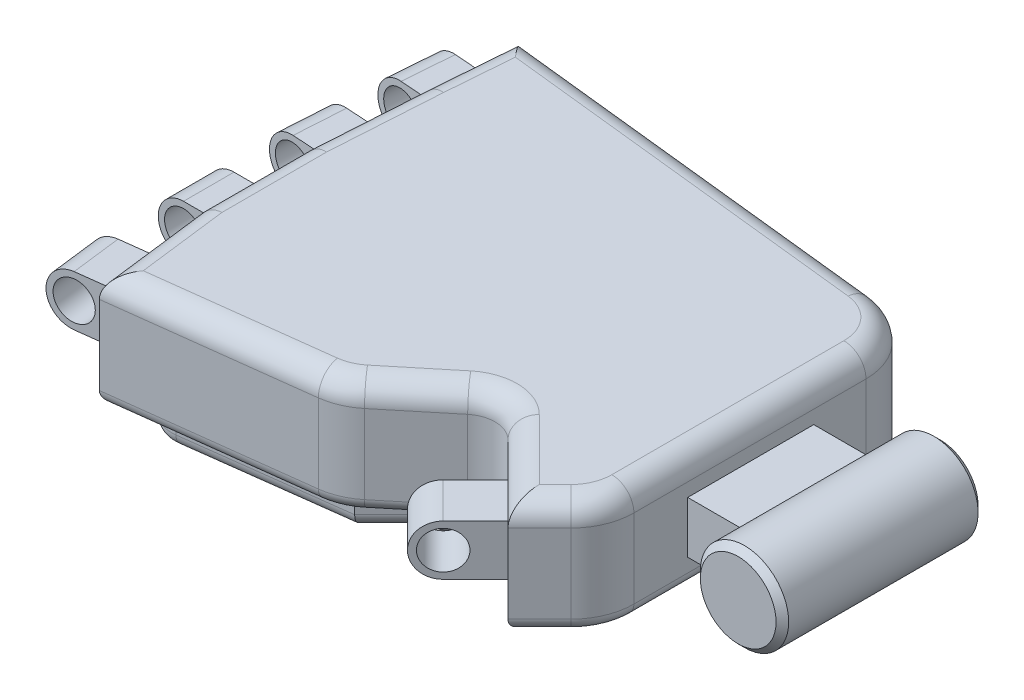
ISO-10303-21;
HEADER;
FILE_DESCRIPTION(('STEP AP214'),'2;1');
FILE_NAME('part.step','',(''),(''),'','','');
FILE_SCHEMA(('AUTOMOTIVE_DESIGN { 1 0 10303 214 1 1 1 1 }'));
ENDSEC;
DATA;
#1=APPLICATION_CONTEXT('core data for automotive mechanical design processes');
#2=APPLICATION_PROTOCOL_DEFINITION('international standard','automotive_design',2000,#1);
#3=PRODUCT_CONTEXT('',#1,'mechanical');
#4=PRODUCT('Part','Part','',(#3));
#5=PRODUCT_RELATED_PRODUCT_CATEGORY('part','',(#4));
#6=PRODUCT_DEFINITION_FORMATION('','',#4);
#7=PRODUCT_DEFINITION_CONTEXT('part definition',#1,'design');
#8=PRODUCT_DEFINITION('design','',#6,#7);
#9=PRODUCT_DEFINITION_SHAPE('','',#8);
#10=(LENGTH_UNIT() NAMED_UNIT(*) SI_UNIT(.MILLI.,.METRE.));
#11=(NAMED_UNIT(*) PLANE_ANGLE_UNIT() SI_UNIT($,.RADIAN.));
#12=(NAMED_UNIT(*) SI_UNIT($,.STERADIAN.) SOLID_ANGLE_UNIT());
#13=UNCERTAINTY_MEASURE_WITH_UNIT(LENGTH_MEASURE(1.E-05),#10,'distance_accuracy_value','');
#14=(GEOMETRIC_REPRESENTATION_CONTEXT(3) GLOBAL_UNCERTAINTY_ASSIGNED_CONTEXT((#13)) GLOBAL_UNIT_ASSIGNED_CONTEXT((#10,
#11,#12)) REPRESENTATION_CONTEXT('',''));
#15=CARTESIAN_POINT('',(0.,0.,0.));
#16=DIRECTION('',(0.,0.,1.));
#17=DIRECTION('',(1.,0.,0.));
#18=AXIS2_PLACEMENT_3D('',#15,#16,#17);
#19=CARTESIAN_POINT('',(26.6895516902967,12.3750119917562,13.2701291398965));
#20=DIRECTION('',(0.,-1.,0.));
#21=DIRECTION('',(0.,0.,-1.));
#22=AXIS2_PLACEMENT_3D('',#19,#20,#21);
#23=PLANE('',#22);
#24=DIRECTION('',(0.,0.,1.));
#25=VECTOR('',#24,1.);
#26=CARTESIAN_POINT('',(21.0185544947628,12.3750119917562,-12.7298708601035));
#27=LINE('',#26,#25);
#28=CARTESIAN_POINT('',(21.0185544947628,12.3750119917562,-6.70087709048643));
#29=VERTEX_POINT('',#28);
#30=CARTESIAN_POINT('',(21.0185544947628,12.3750119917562,13.2701291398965));
#31=VERTEX_POINT('',#30);
#32=EDGE_CURVE('E670',#29,#31,#27,.T.);
#33=ORIENTED_EDGE('',*,*,#32,.F.);
#34=DIRECTION('',(-1.,0.,0.));
#35=VECTOR('',#34,1.);
#36=CARTESIAN_POINT('',(26.6895516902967,12.3750119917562,-6.70087709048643));
#37=LINE('',#36,#35);
#38=CARTESIAN_POINT('',(12.6895516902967,12.3750119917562,-6.70087709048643));
#39=VERTEX_POINT('',#38);
#40=EDGE_CURVE('E111',#29,#39,#37,.T.);
#41=ORIENTED_EDGE('',*,*,#40,.T.);
#42=DIRECTION('',(0.,0.,1.));
#43=VECTOR('',#42,1.);
#44=CARTESIAN_POINT('',(12.6895516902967,12.3750119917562,13.2701291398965));
#45=LINE('',#44,#43);
#46=CARTESIAN_POINT('',(12.6895516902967,12.3750119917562,13.2701291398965));
#47=VERTEX_POINT('',#46);
#48=EDGE_CURVE('E3040',#39,#47,#45,.T.);
#49=ORIENTED_EDGE('',*,*,#48,.T.);
#50=DIRECTION('',(-1.,0.,0.));
#51=VECTOR('',#50,1.);
#52=CARTESIAN_POINT('',(26.6895516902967,12.3750119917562,13.2701291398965));
#53=LINE('',#52,#51);
#54=EDGE_CURVE('E119',#31,#47,#53,.T.);
#55=ORIENTED_EDGE('',*,*,#54,.F.);
#56=EDGE_LOOP('',(#33,#41,#49,#55));
#57=FACE_BOUND('',#56,.T.);
#58=ADVANCED_FACE('F96',(#57),#23,.F.);
#59=CARTESIAN_POINT('',(26.6895516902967,4.16774915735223,13.2701291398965));
#60=DIRECTION('',(0.,1.,0.));
#61=DIRECTION('',(0.,0.,1.));
#62=AXIS2_PLACEMENT_3D('',#59,#60,#61);
#63=PLANE('',#62);
#64=DIRECTION('',(0.,0.,1.));
#65=VECTOR('',#64,1.);
#66=CARTESIAN_POINT('',(21.0185544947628,4.16774915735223,-12.7298708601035));
#67=LINE('',#66,#65);
#68=CARTESIAN_POINT('',(21.0185544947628,4.16774915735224,13.2701291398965));
#69=VERTEX_POINT('',#68);
#70=CARTESIAN_POINT('',(21.0185544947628,4.16774915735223,-6.70087709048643));
#71=VERTEX_POINT('',#70);
#72=EDGE_CURVE('E656',#69,#71,#67,.F.);
#73=ORIENTED_EDGE('',*,*,#72,.F.);
#74=DIRECTION('',(-1.,0.,0.));
#75=VECTOR('',#74,1.);
#76=CARTESIAN_POINT('',(26.6895516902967,4.16774915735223,13.2701291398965));
#77=LINE('',#76,#75);
#78=CARTESIAN_POINT('',(12.6895516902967,4.16774915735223,13.2701291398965));
#79=VERTEX_POINT('',#78);
#80=EDGE_CURVE('E661',#69,#79,#77,.T.);
#81=ORIENTED_EDGE('',*,*,#80,.T.);
#82=DIRECTION('',(0.,0.,-1.));
#83=VECTOR('',#82,1.);
#84=CARTESIAN_POINT('',(12.6895516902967,4.16774915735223,13.2701291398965));
#85=LINE('',#84,#83);
#86=CARTESIAN_POINT('',(12.6895516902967,4.16774915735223,-6.70087709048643));
#87=VERTEX_POINT('',#86);
#88=EDGE_CURVE('E677',#79,#87,#85,.T.);
#89=ORIENTED_EDGE('',*,*,#88,.T.);
#90=DIRECTION('',(-1.,0.,0.));
#91=VECTOR('',#90,1.);
#92=CARTESIAN_POINT('',(26.6895516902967,4.16774915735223,-6.70087709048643));
#93=LINE('',#92,#91);
#94=EDGE_CURVE('E663',#71,#87,#93,.T.);
#95=ORIENTED_EDGE('',*,*,#94,.F.);
#96=EDGE_LOOP('',(#73,#81,#89,#95));
#97=FACE_BOUND('',#96,.T.);
#98=ADVANCED_FACE('F658',(#97),#63,.F.);
#99=CARTESIAN_POINT('',(12.6895516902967,18.,21.7893607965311));
#100=DIRECTION('',(-1.,0.,0.));
#101=DIRECTION('',(0.,0.,1.));
#102=AXIS2_PLACEMENT_3D('',#99,#100,#101);
#103=PLANE('',#102);
#104=DIRECTION('',(0.,-1.,0.));
#105=VECTOR('',#104,1.);
#106=CARTESIAN_POINT('',(12.6895516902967,18.,21.7893607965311));
#107=LINE('',#106,#105);
#108=CARTESIAN_POINT('',(12.6895516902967,14.5,21.7893607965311));
#109=VERTEX_POINT('',#108);
#110=CARTESIAN_POINT('',(12.6895516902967,2.,21.7893607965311));
#111=VERTEX_POINT('',#110);
#112=EDGE_CURVE('E1051',#109,#111,#107,.T.);
#113=ORIENTED_EDGE('',*,*,#112,.T.);
#114=DIRECTION('',(0.,0.,-1.));
#115=VECTOR('',#114,1.);
#116=CARTESIAN_POINT('',(12.6895516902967,2.,-14.973360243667));
#117=LINE('',#116,#115);
#118=CARTESIAN_POINT('',(12.6895516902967,2.,-14.973360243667));
#119=VERTEX_POINT('',#118);
#120=EDGE_CURVE('E1234',#111,#119,#117,.T.);
#121=ORIENTED_EDGE('',*,*,#120,.T.);
#122=DIRECTION('',(0.,-1.,0.));
#123=VECTOR('',#122,1.);
#124=CARTESIAN_POINT('',(12.6895516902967,18.,-14.973360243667));
#125=LINE('',#124,#123);
#126=CARTESIAN_POINT('',(12.6895516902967,14.5,-14.973360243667));
#127=VERTEX_POINT('',#126);
#128=EDGE_CURVE('E1048',#127,#119,#125,.T.);
#129=ORIENTED_EDGE('',*,*,#128,.F.);
#130=DIRECTION('',(0.,0.,-1.));
#131=VECTOR('',#130,1.);
#132=CARTESIAN_POINT('',(12.6895516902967,14.5,21.7893607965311));
#133=LINE('',#132,#131);
#134=EDGE_CURVE('E1118',#127,#109,#133,.F.);
#135=ORIENTED_EDGE('',*,*,#134,.T.);
#136=EDGE_LOOP('',(#113,#121,#129,#135));
#137=FACE_BOUND('',#136,.T.);
#138=DIRECTION('',(0.,1.,0.));
#139=VECTOR('',#138,1.);
#140=CARTESIAN_POINT('',(12.6895516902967,4.16774915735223,-6.70087709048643));
#141=LINE('',#140,#139);
#142=EDGE_CURVE('E671',#87,#39,#141,.T.);
#143=ORIENTED_EDGE('',*,*,#142,.F.);
#144=ORIENTED_EDGE('',*,*,#88,.F.);
#145=DIRECTION('',(0.,-1.,0.));
#146=VECTOR('',#145,1.);
#147=CARTESIAN_POINT('',(12.6895516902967,4.16774915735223,13.2701291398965));
#148=LINE('',#147,#146);
#149=EDGE_CURVE('E674',#47,#79,#148,.T.);
#150=ORIENTED_EDGE('',*,*,#149,.F.);
#151=ORIENTED_EDGE('',*,*,#48,.F.);
#152=EDGE_LOOP('',(#143,#144,#150,#151));
#153=FACE_BOUND('',#152,.T.);
#154=ADVANCED_FACE('F1403',(#137,#153),#103,.F.);
#155=CARTESIAN_POINT('',(-47.4032108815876,-4.99999999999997,20.2391066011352));
#156=DIRECTION('',(0.,-1.,0.));
#157=DIRECTION('',(0.,0.,-1.));
#158=AXIS2_PLACEMENT_3D('',#155,#156,#157);
#159=PLANE('',#158);
#160=CARTESIAN_POINT('',(-47.4032108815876,-4.99999999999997,20.2391066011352));
#161=DIRECTION('',(0.,-1.,0.));
#162=DIRECTION('',(0.,0.,-1.));
#163=AXIS2_PLACEMENT_3D('',#160,#161,#162);
#164=CIRCLE('',#163,4.6590333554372);
#165=CARTESIAN_POINT('',(-47.4032108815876,-4.99999999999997,15.580073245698));
#166=VERTEX_POINT('',#165);
#167=EDGE_CURVE('E713',#166,#166,#164,.T.);
#168=ORIENTED_EDGE('',*,*,#167,.T.);
#169=EDGE_LOOP('',(#168));
#170=FACE_BOUND('',#169,.T.);
#171=DIRECTION('',(-0.0399385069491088,0.,0.999202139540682));
#172=VECTOR('',#171,1.);
#173=CARTESIAN_POINT('',(-48.5564759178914,-4.99999999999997,23.973484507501));
#174=LINE('',#173,#172);
#175=CARTESIAN_POINT('',(-48.2547438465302,-4.99999999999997,16.4245961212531));
#176=VERTEX_POINT('',#175);
#177=CARTESIAN_POINT('',(-48.5564759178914,-4.99999999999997,23.973484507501));
#178=VERTEX_POINT('',#177);
#179=EDGE_CURVE('E702',#176,#178,#174,.T.);
#180=ORIENTED_EDGE('',*,*,#179,.F.);
#181=CARTESIAN_POINT('',(-47.4032108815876,-4.99999999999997,20.2391066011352));
#182=DIRECTION('',(0.,-1.,0.));
#183=DIRECTION('',(0.,0.,-1.));
#184=AXIS2_PLACEMENT_3D('',#181,#182,#183);
#185=CIRCLE('',#184,3.90840102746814);
#186=EDGE_CURVE('E697',#178,#176,#185,.T.);
#187=ORIENTED_EDGE('',*,*,#186,.F.);
#188=EDGE_LOOP('',(#180,#187));
#189=FACE_BOUND('',#188,.T.);
#190=DIRECTION('',(0.0399385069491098,0.,-0.999202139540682));
#191=VECTOR('',#190,1.);
#192=CARTESIAN_POINT('',(-46.5516779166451,-4.99999999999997,24.0536170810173));
#193=LINE('',#192,#191);
#194=CARTESIAN_POINT('',(-46.5516779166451,-4.99999999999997,24.0536170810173));
#195=VERTEX_POINT('',#194);
#196=CARTESIAN_POINT('',(-46.2499458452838,-4.99999999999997,16.5047286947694));
#197=VERTEX_POINT('',#196);
#198=EDGE_CURVE('E687',#195,#197,#193,.T.);
#199=ORIENTED_EDGE('',*,*,#198,.F.);
#200=CARTESIAN_POINT('',(-47.4032108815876,-4.99999999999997,20.2391066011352));
#201=DIRECTION('',(0.,-1.,0.));
#202=DIRECTION('',(0.,0.,-1.));
#203=AXIS2_PLACEMENT_3D('',#200,#201,#202);
#204=CIRCLE('',#203,3.90840102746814);
#205=EDGE_CURVE('E682',#197,#195,#204,.T.);
#206=ORIENTED_EDGE('',*,*,#205,.F.);
#207=EDGE_LOOP('',(#199,#206));
#208=FACE_BOUND('',#207,.T.);
#209=ADVANCED_FACE('F1436',(#170,#189,#208),#159,.T.);
#210=CARTESIAN_POINT('',(2.68955169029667,0.,-14.973360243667));
#211=DIRECTION('',(0.,-1.,0.));
#212=DIRECTION('',(0.,0.,-1.));
#213=AXIS2_PLACEMENT_3D('',#210,#211,#212);
#214=PLANE('',#213);
#215=CARTESIAN_POINT('',(1.73352628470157,0.,15.8103538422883));
#216=DIRECTION('',(0.,-1.,0.));
#217=DIRECTION('',(0.,0.,-1.));
#218=AXIS2_PLACEMENT_3D('',#215,#216,#217);
#219=CIRCLE('',#218,4.5);
#220=CARTESIAN_POINT('',(6.23352628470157,0.,15.8103538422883));
#221=VERTEX_POINT('',#220);
#222=CARTESIAN_POINT('',(5.87003280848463,0.,17.5821647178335));
#223=VERTEX_POINT('',#222);
#224=EDGE_CURVE('E727',#221,#223,#219,.T.);
#225=ORIENTED_EDGE('',*,*,#224,.F.);
#226=DIRECTION('',(0.,0.,1.));
#227=VECTOR('',#226,1.);
#228=CARTESIAN_POINT('',(6.23352628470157,0.,0.));
#229=LINE('',#228,#227);
#230=CARTESIAN_POINT('',(6.23352628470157,0.,-14.9094418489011));
#231=VERTEX_POINT('',#230);
#232=EDGE_CURVE('E724',#231,#221,#229,.T.);
#233=ORIENTED_EDGE('',*,*,#232,.F.);
#234=CARTESIAN_POINT('',(3.73352628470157,0.,-14.9094418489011));
#235=DIRECTION('',(0.,-1.,0.));
#236=DIRECTION('',(0.,0.,-1.));
#237=AXIS2_PLACEMENT_3D('',#234,#235,#236);
#238=CIRCLE('',#237,2.5);
#239=CARTESIAN_POINT('',(4.17561668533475,0.,-17.3700426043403));
#240=VERTEX_POINT('',#239);
#241=EDGE_CURVE('E723',#240,#231,#238,.T.);
#242=ORIENTED_EDGE('',*,*,#241,.F.);
#243=DIRECTION('',(-0.984240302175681,0.,-0.176836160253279));
#244=VECTOR('',#243,1.);
#245=CARTESIAN_POINT('',(3.15381916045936,0.,-17.5536265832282));
#246=LINE('',#245,#244);
#247=CARTESIAN_POINT('',(-9.76256597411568,0.,-19.8742833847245));
#248=VERTEX_POINT('',#247);
#249=EDGE_CURVE('E752',#240,#248,#246,.T.);
#250=ORIENTED_EDGE('',*,*,#249,.T.);
#251=CARTESIAN_POINT('',(-10.2046563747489,0.,-17.4136826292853));
#252=DIRECTION('',(0.,-1.,0.));
#253=DIRECTION('',(0.,0.,-1.));
#254=AXIS2_PLACEMENT_3D('',#251,#252,#253);
#255=CIRCLE('',#254,2.5);
#256=CARTESIAN_POINT('',(-12.0417732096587,0.,-19.109265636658));
#257=VERTEX_POINT('',#256);
#258=EDGE_CURVE('E749',#257,#248,#255,.T.);
#259=ORIENTED_EDGE('',*,*,#258,.F.);
#260=DIRECTION('',(-0.678233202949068,0.,0.734846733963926));
#261=VECTOR('',#260,1.);
#262=CARTESIAN_POINT('',(-16.0265635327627,0.,-14.7918566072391));
#263=LINE('',#262,#261);
#264=CARTESIAN_POINT('',(-17.0460505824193,0.,-13.6872708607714));
#265=VERTEX_POINT('',#264);
#266=EDGE_CURVE('E746',#257,#265,#263,.T.);
#267=ORIENTED_EDGE('',*,*,#266,.T.);
#268=CARTESIAN_POINT('',(-29.6788366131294,0.,0.));
#269=DIRECTION('',(0.,-1.,0.));
#270=DIRECTION('',(0.,0.,-1.));
#271=AXIS2_PLACEMENT_3D('',#268,#269,#270);
#272=CIRCLE('',#271,18.6260212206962);
#273=CARTESIAN_POINT('',(-13.7109456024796,0.,9.58932339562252));
#274=VERTEX_POINT('',#273);
#275=EDGE_CURVE('E743',#265,#274,#272,.T.);
#276=ORIENTED_EDGE('',*,*,#275,.T.);
#277=DIRECTION('',(0.798893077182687,0.,0.601473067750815));
#278=VECTOR('',#277,1.);
#279=CARTESIAN_POINT('',(-9.56799813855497,0.,12.7084783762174));
#280=LINE('',#279,#278);
#281=CARTESIAN_POINT('',(-0.719437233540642,0.,19.3704100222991));
#282=VERTEX_POINT('',#281);
#283=EDGE_CURVE('E740',#274,#282,#280,.T.);
#284=ORIENTED_EDGE('',*,*,#283,.T.);
#285=CARTESIAN_POINT('',(2.28792810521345,0.,15.3759446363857));
#286=DIRECTION('',(0.,-1.,0.));
#287=DIRECTION('',(0.,0.,-1.));
#288=AXIS2_PLACEMENT_3D('',#285,#286,#287);
#289=CIRCLE('',#288,5.);
#290=CARTESIAN_POINT('',(3.87131783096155,0.,20.1186102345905));
#291=VERTEX_POINT('',#290);
#292=EDGE_CURVE('E737',#291,#282,#289,.T.);
#293=ORIENTED_EDGE('',*,*,#292,.F.);
#294=CARTESIAN_POINT('',(3.0796229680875,0.,17.7472774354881));
#295=DIRECTION('',(0.,-1.,0.));
#296=DIRECTION('',(0.,0.,-1.));
#297=AXIS2_PLACEMENT_3D('',#294,#295,#296);
#298=CIRCLE('',#297,2.5);
#299=CARTESIAN_POINT('',(5.37768214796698,0.,18.731616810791));
#300=VERTEX_POINT('',#299);
#301=EDGE_CURVE('E734',#291,#300,#298,.F.);
#302=ORIENTED_EDGE('',*,*,#301,.T.);
#303=DIRECTION('',(-0.393735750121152,0.,0.919223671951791));
#304=VECTOR('',#303,1.);
#305=CARTESIAN_POINT('',(11.3235486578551,0.,4.8502731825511));
#306=LINE('',#305,#304);
#307=EDGE_CURVE('E731',#223,#300,#306,.T.);
#308=ORIENTED_EDGE('',*,*,#307,.F.);
#309=EDGE_LOOP('',(#225,#233,#242,#250,#259,#267,#276,#284,#293,#302,#308));
#310=FACE_BOUND('',#309,.T.);
#311=CARTESIAN_POINT('',(2.68955169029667,0.,-14.973360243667));
#312=DIRECTION('',(0.,-1.,0.));
#313=DIRECTION('',(0.,0.,-1.));
#314=AXIS2_PLACEMENT_3D('',#311,#312,#313);
#315=CIRCLE('',#314,8.);
#316=CARTESIAN_POINT('',(3.55304868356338,0.,-22.9266220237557));
#317=VERTEX_POINT('',#316);
#318=CARTESIAN_POINT('',(10.6895516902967,0.,-14.973360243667));
#319=VERTEX_POINT('',#318);
#320=EDGE_CURVE('E1208',#317,#319,#315,.T.);
#321=ORIENTED_EDGE('',*,*,#320,.T.);
#322=DIRECTION('',(0.,0.,-1.));
#323=VECTOR('',#322,1.);
#324=CARTESIAN_POINT('',(10.6895516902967,0.,21.7893607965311));
#325=LINE('',#324,#323);
#326=CARTESIAN_POINT('',(10.6895516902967,0.,21.7893607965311));
#327=VERTEX_POINT('',#326);
#328=EDGE_CURVE('E1212',#319,#327,#325,.F.);
#329=ORIENTED_EDGE('',*,*,#328,.T.);
#330=CARTESIAN_POINT('',(2.68955169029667,0.,21.7893607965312));
#331=DIRECTION('',(0.,-1.,0.));
#332=DIRECTION('',(0.,0.,-1.));
#333=AXIS2_PLACEMENT_3D('',#330,#331,#332);
#334=CIRCLE('',#333,8.);
#335=CARTESIAN_POINT('',(8.34640593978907,0.,27.4462150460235));
#336=VERTEX_POINT('',#335);
#337=EDGE_CURVE('E1210',#327,#336,#334,.T.);
#338=ORIENTED_EDGE('',*,*,#337,.T.);
#339=DIRECTION('',(0.707106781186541,0.,-0.707106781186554));
#340=VECTOR('',#339,1.);
#341=CARTESIAN_POINT('',(3.37584649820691,0.,32.4167744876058));
#342=LINE('',#341,#340);
#343=CARTESIAN_POINT('',(4.79006006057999,0.,31.0025609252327));
#344=VERTEX_POINT('',#343);
#345=EDGE_CURVE('E1205',#336,#344,#342,.F.);
#346=ORIENTED_EDGE('',*,*,#345,.T.);
#347=DIRECTION('',(0.707106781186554,0.,0.707106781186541));
#348=VECTOR('',#347,1.);
#349=CARTESIAN_POINT('',(-5.87856405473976,0.,20.3339368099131));
#350=LINE('',#349,#348);
#351=CARTESIAN_POINT('',(-5.87856405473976,0.,20.3339368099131));
#352=VERTEX_POINT('',#351);
#353=EDGE_CURVE('E1201',#344,#352,#350,.F.);
#354=ORIENTED_EDGE('',*,*,#353,.T.);
#355=CARTESIAN_POINT('',(-10.8283115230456,0.,25.283684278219));
#356=DIRECTION('',(0.,-1.,0.));
#357=DIRECTION('',(0.,0.,-1.));
#358=AXIS2_PLACEMENT_3D('',#355,#356,#357);
#359=CIRCLE('',#358,7.);
#360=CARTESIAN_POINT('',(-15.2738662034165,0.,19.8765553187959));
#361=VERTEX_POINT('',#360);
#362=EDGE_CURVE('E1199',#352,#361,#359,.F.);
#363=ORIENTED_EDGE('',*,*,#362,.T.);
#364=DIRECTION('',(0.772446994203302,0.,-0.635079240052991));
#365=VECTOR('',#364,1.);
#366=CARTESIAN_POINT('',(-24.2429376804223,0.,27.250616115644));
#367=LINE('',#366,#365);
#368=CARTESIAN_POINT('',(-24.2429376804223,0.,27.250616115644));
#369=VERTEX_POINT('',#368);
#370=EDGE_CURVE('E1197',#361,#369,#367,.F.);
#371=ORIENTED_EDGE('',*,*,#370,.T.);
#372=CARTESIAN_POINT('',(-29.3235716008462,0.,21.0710401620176));
#373=DIRECTION('',(0.,-1.,0.));
#374=DIRECTION('',(0.,0.,-1.));
#375=AXIS2_PLACEMENT_3D('',#372,#373,#374);
#376=CIRCLE('',#375,8.);
#377=CARTESIAN_POINT('',(-28.3378644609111,0.,29.0100817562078));
#378=VERTEX_POINT('',#377);
#379=EDGE_CURVE('E1195',#369,#378,#376,.T.);
#380=ORIENTED_EDGE('',*,*,#379,.T.);
#381=DIRECTION('',(0.992380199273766,0.,-0.123213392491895));
#382=VECTOR('',#381,1.);
#383=CARTESIAN_POINT('',(-59.1914410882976,0.,32.8408452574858));
#384=LINE('',#383,#382);
#385=CARTESIAN_POINT('',(-57.20668068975,0.,32.594418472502));
#386=VERTEX_POINT('',#385);
#387=EDGE_CURVE('E1191',#378,#386,#384,.F.);
#388=ORIENTED_EDGE('',*,*,#387,.T.);
#389=DIRECTION('',(0.123213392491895,0.,0.992380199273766));
#390=VECTOR('',#389,1.);
#391=CARTESIAN_POINT('',(-59.1850612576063,0.,16.6602276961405));
#392=LINE('',#391,#390);
#393=CARTESIAN_POINT('',(-59.1698216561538,0.,16.7829698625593));
#394=VERTEX_POINT('',#393);
#395=EDGE_CURVE('E1187',#386,#394,#392,.F.);
#396=ORIENTED_EDGE('',*,*,#395,.T.);
#397=DIRECTION('',(0.,0.,1.));
#398=VECTOR('',#397,1.);
#399=CARTESIAN_POINT('',(-59.1698216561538,0.,0.));
#400=LINE('',#399,#398);
#401=CARTESIAN_POINT('',(-59.1698216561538,0.,0.0632669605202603));
#402=VERTEX_POINT('',#401);
#403=EDGE_CURVE('E1185',#394,#402,#400,.F.);
#404=ORIENTED_EDGE('',*,*,#403,.T.);
#405=DIRECTION('',(-0.0632037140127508,0.,0.998000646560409));
#406=VECTOR('',#405,1.);
#407=CARTESIAN_POINT('',(-58.061416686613,0.,-17.438693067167));
#408=LINE('',#407,#406);
#409=CARTESIAN_POINT('',(-58.0623748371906,0.,-17.4235636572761));
#410=VERTEX_POINT('',#409);
#411=EDGE_CURVE('E1189',#402,#410,#408,.F.);
#412=ORIENTED_EDGE('',*,*,#411,.T.);
#413=DIRECTION('',(-0.0783249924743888,0.,0.996927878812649));
#414=VECTOR('',#413,1.);
#415=CARTESIAN_POINT('',(-56.9511585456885,0.,-31.567229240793));
#416=LINE('',#415,#414);
#417=CARTESIAN_POINT('',(-57.1125383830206,0.,-29.5131714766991));
#418=VERTEX_POINT('',#417);
#419=EDGE_CURVE('E1193',#410,#418,#416,.F.);
#420=ORIENTED_EDGE('',*,*,#419,.T.);
#421=DIRECTION('',(-0.994157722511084,0.,-0.107937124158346));
#422=VECTOR('',#421,1.);
#423=CARTESIAN_POINT('',(3.55304868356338,0.,-22.9266220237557));
#424=LINE('',#423,#422);
#425=EDGE_CURVE('E1203',#418,#317,#424,.F.);
#426=ORIENTED_EDGE('',*,*,#425,.T.);
#427=EDGE_LOOP('',(#321,#329,#338,#346,#354,#363,#371,#380,#388,#396,#404,#412,#420,#426));
#428=FACE_BOUND('',#427,.T.);
#429=CARTESIAN_POINT('',(-29.6788366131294,0.,0.));
#430=DIRECTION('',(0.,-1.,0.));
#431=DIRECTION('',(0.,0.,-1.));
#432=AXIS2_PLACEMENT_3D('',#429,#430,#431);
#433=CIRCLE('',#432,18.5669031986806);
#434=CARTESIAN_POINT('',(-20.91622129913,0.,-16.369070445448));
#435=VERTEX_POINT('',#434);
#436=CARTESIAN_POINT('',(-22.2020839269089,0.,16.9949422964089));
#437=VERTEX_POINT('',#436);
#438=EDGE_CURVE('E861',#435,#437,#433,.T.);
#439=ORIENTED_EDGE('',*,*,#438,.F.);
#440=DIRECTION('',(-0.471948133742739,0.,0.88162631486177));
#441=VECTOR('',#440,1.);
#442=CARTESIAN_POINT('',(-23.0683197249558,0.,-12.3488265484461));
#443=LINE('',#442,#441);
#444=CARTESIAN_POINT('',(-16.7613506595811,0.,-24.1306082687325));
#445=VERTEX_POINT('',#444);
#446=EDGE_CURVE('E795',#445,#435,#443,.T.);
#447=ORIENTED_EDGE('',*,*,#446,.F.);
#448=DIRECTION('',(0.996495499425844,0.,0.0836463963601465));
#449=VECTOR('',#448,1.);
#450=CARTESIAN_POINT('',(1.89409033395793,0.,-22.5646599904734));
#451=LINE('',#450,#449);
#452=CARTESIAN_POINT('',(-49.9156991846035,0.,-26.9136030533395));
#453=VERTEX_POINT('',#452);
#454=EDGE_CURVE('E791',#453,#445,#451,.T.);
#455=ORIENTED_EDGE('',*,*,#454,.F.);
#456=CARTESIAN_POINT('',(-50.3339311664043,0.,-21.9311255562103));
#457=DIRECTION('',(0.,-1.,0.));
#458=DIRECTION('',(0.,0.,-1.));
#459=AXIS2_PLACEMENT_3D('',#456,#457,#458);
#460=CIRCLE('',#459,5.);
#461=CARTESIAN_POINT('',(-55.3164086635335,0.,-22.349357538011));
#462=VERTEX_POINT('',#461);
#463=EDGE_CURVE('E788',#453,#462,#460,.F.);
#464=ORIENTED_EDGE('',*,*,#463,.T.);
#465=DIRECTION('',(0.0836463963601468,0.,-0.996495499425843));
#466=VECTOR('',#465,1.);
#467=CARTESIAN_POINT('',(-56.7922670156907,0.,-4.7671750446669));
#468=LINE('',#467,#466);
#469=CARTESIAN_POINT('',(-56.7973402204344,0.,-4.70673698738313));
#470=VERTEX_POINT('',#469);
#471=EDGE_CURVE('E782',#470,#462,#468,.T.);
#472=ORIENTED_EDGE('',*,*,#471,.F.);
#473=DIRECTION('',(-0.985270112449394,0.,-0.171005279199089));
#474=VECTOR('',#473,1.);
#475=CARTESIAN_POINT('',(-0.867892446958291,0.,5.00048006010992));
#476=LINE('',#475,#474);
#477=CARTESIAN_POINT('',(-47.9722514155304,0.,-3.17503846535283));
#478=VERTEX_POINT('',#477);
#479=EDGE_CURVE('E797',#478,#470,#476,.T.);
#480=ORIENTED_EDGE('',*,*,#479,.F.);
#481=CARTESIAN_POINT('',(-48.2457398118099,0.,0.));
#482=VERTEX_POINT('',#481);
#483=EDGE_CURVE('E862',#482,#478,#433,.T.);
#484=ORIENTED_EDGE('',*,*,#483,.F.);
#485=DIRECTION('',(1.,0.,0.));
#486=VECTOR('',#485,1.);
#487=CARTESIAN_POINT('',(0.,0.,0.));
#488=LINE('',#487,#486);
#489=CARTESIAN_POINT('',(-57.6031733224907,0.,0.));
#490=VERTEX_POINT('',#489);
#491=EDGE_CURVE('E834',#490,#482,#488,.T.);
#492=ORIENTED_EDGE('',*,*,#491,.F.);
#493=DIRECTION('',(0.,0.,-1.));
#494=VECTOR('',#493,1.);
#495=CARTESIAN_POINT('',(-57.6031733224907,0.,0.));
#496=LINE('',#495,#494);
#497=CARTESIAN_POINT('',(-57.6031733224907,0.,16.9949422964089));
#498=VERTEX_POINT('',#497);
#499=EDGE_CURVE('E831',#498,#490,#496,.T.);
#500=ORIENTED_EDGE('',*,*,#499,.F.);
#501=DIRECTION('',(-0.127041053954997,0.,-0.991897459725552));
#502=VECTOR('',#501,1.);
#503=CARTESIAN_POINT('',(-58.8150525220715,0.,7.53296239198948));
#504=LINE('',#503,#502);
#505=CARTESIAN_POINT('',(-56.3811548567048,0.,26.536086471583));
#506=VERTEX_POINT('',#505);
#507=EDGE_CURVE('E827',#506,#498,#504,.T.);
#508=ORIENTED_EDGE('',*,*,#507,.F.);
#509=CARTESIAN_POINT('',(-51.4216675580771,0.,25.9008812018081));
#510=DIRECTION('',(0.,-1.,0.));
#511=DIRECTION('',(0.,0.,-1.));
#512=AXIS2_PLACEMENT_3D('',#509,#510,#511);
#513=CIRCLE('',#512,5.);
#514=CARTESIAN_POINT('',(-50.786462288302,0.,30.8603685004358));
#515=VERTEX_POINT('',#514);
#516=EDGE_CURVE('E824',#506,#515,#513,.F.);
#517=ORIENTED_EDGE('',*,*,#516,.T.);
#518=DIRECTION('',(-0.991897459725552,0.,0.127041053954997));
#519=VECTOR('',#518,1.);
#520=CARTESIAN_POINT('',(3.06910293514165,0.,23.9626113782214));
#521=LINE('',#520,#519);
#522=CARTESIAN_POINT('',(-25.6799045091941,0.,27.6447502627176));
#523=VERTEX_POINT('',#522);
#524=EDGE_CURVE('E818',#523,#515,#521,.T.);
#525=ORIENTED_EDGE('',*,*,#524,.F.);
#526=DIRECTION('',(-0.707106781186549,0.,0.707106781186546));
#527=VECTOR('',#526,1.);
#528=CARTESIAN_POINT('',(0.982422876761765,0.,0.982422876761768));
#529=LINE('',#528,#527);
#530=CARTESIAN_POINT('',(-18.6160902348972,0.,20.5809359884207));
#531=VERTEX_POINT('',#530);
#532=EDGE_CURVE('E839',#531,#523,#529,.T.);
#533=ORIENTED_EDGE('',*,*,#532,.F.);
#534=DIRECTION('',(0.707106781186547,0.,0.707106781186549));
#535=VECTOR('',#534,1.);
#536=CARTESIAN_POINT('',(-19.598513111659,0.,19.5985131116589));
#537=LINE('',#536,#535);
#538=EDGE_CURVE('E836',#437,#531,#537,.T.);
#539=ORIENTED_EDGE('',*,*,#538,.F.);
#540=EDGE_LOOP('',(#439,#447,#455,#464,#472,#480,#484,#492,#500,#508,#517,#525,#533,#539));
#541=FACE_BOUND('',#540,.T.);
#542=ADVANCED_FACE('F1439',(#310,#428,#541),#214,.T.);
#543=CARTESIAN_POINT('',(-29.6788366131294,-8.99999999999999,0.));
#544=DIRECTION('',(0.,1.,0.));
#545=DIRECTION('',(0.,0.,1.));
#546=AXIS2_PLACEMENT_3D('',#543,#544,#545);
#547=CYLINDRICAL_SURFACE('',#546,18.5669031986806);
#548=CARTESIAN_POINT('',(-29.6788366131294,-6.49999999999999,0.));
#549=DIRECTION('',(0.,-1.,0.));
#550=DIRECTION('',(0.,0.,-1.));
#551=AXIS2_PLACEMENT_3D('',#548,#549,#550);
#552=CIRCLE('',#551,18.5669031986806);
#553=CARTESIAN_POINT('',(-29.6788366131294,-6.49999999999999,-18.5669031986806));
#554=VERTEX_POINT('',#553);
#555=EDGE_CURVE('E1297',#554,#554,#552,.F.);
#556=ORIENTED_EDGE('',*,*,#555,.T.);
#557=EDGE_LOOP('',(#556));
#558=FACE_BOUND('',#557,.T.);
#559=DIRECTION('',(0.,1.,0.));
#560=VECTOR('',#559,1.);
#561=CARTESIAN_POINT('',(-20.91622129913,-3.99999999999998,-16.369070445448));
#562=LINE('',#561,#560);
#563=CARTESIAN_POINT('',(-20.91622129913,-3.99999999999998,-16.369070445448));
#564=VERTEX_POINT('',#563);
#565=EDGE_CURVE('E807',#564,#435,#562,.T.);
#566=ORIENTED_EDGE('',*,*,#565,.T.);
#567=ORIENTED_EDGE('',*,*,#438,.T.);
#568=DIRECTION('',(0.,1.,0.));
#569=VECTOR('',#568,1.);
#570=CARTESIAN_POINT('',(-22.2020839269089,-3.99999999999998,16.9949422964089));
#571=LINE('',#570,#569);
#572=CARTESIAN_POINT('',(-22.2020839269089,-3.99999999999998,16.9949422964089));
#573=VERTEX_POINT('',#572);
#574=EDGE_CURVE('E849',#573,#437,#571,.T.);
#575=ORIENTED_EDGE('',*,*,#574,.F.);
#576=CARTESIAN_POINT('',(-29.6788366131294,-3.99999999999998,0.));
#577=DIRECTION('',(0.,-1.,0.));
#578=DIRECTION('',(0.,0.,-1.));
#579=AXIS2_PLACEMENT_3D('',#576,#577,#578);
#580=CIRCLE('',#579,18.5669031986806);
#581=CARTESIAN_POINT('',(-48.2457398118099,-3.99999999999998,0.));
#582=VERTEX_POINT('',#581);
#583=EDGE_CURVE('E817',#582,#573,#580,.F.);
#584=ORIENTED_EDGE('',*,*,#583,.F.);
#585=DIRECTION('',(0.,1.,0.));
#586=VECTOR('',#585,1.);
#587=CARTESIAN_POINT('',(-48.2457398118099,-3.99999999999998,0.));
#588=LINE('',#587,#586);
#589=EDGE_CURVE('E852',#582,#482,#588,.T.);
#590=ORIENTED_EDGE('',*,*,#589,.T.);
#591=ORIENTED_EDGE('',*,*,#483,.T.);
#592=DIRECTION('',(0.,1.,0.));
#593=VECTOR('',#592,1.);
#594=CARTESIAN_POINT('',(-47.9722514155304,-3.99999999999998,-3.17503846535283));
#595=LINE('',#594,#593);
#596=CARTESIAN_POINT('',(-47.9722514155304,-3.99999999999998,-3.17503846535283));
#597=VERTEX_POINT('',#596);
#598=EDGE_CURVE('E805',#597,#478,#595,.T.);
#599=ORIENTED_EDGE('',*,*,#598,.F.);
#600=CARTESIAN_POINT('',(-29.6788366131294,-3.99999999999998,0.));
#601=DIRECTION('',(0.,-1.,0.));
#602=DIRECTION('',(0.,0.,-1.));
#603=AXIS2_PLACEMENT_3D('',#600,#601,#602);
#604=CIRCLE('',#603,18.5669031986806);
#605=EDGE_CURVE('E781',#564,#597,#604,.F.);
#606=ORIENTED_EDGE('',*,*,#605,.F.);
#607=EDGE_LOOP('',(#566,#567,#575,#584,#590,#591,#599,#606));
#608=FACE_BOUND('',#607,.T.);
#609=ADVANCED_FACE('F1909',(#558,#608),#547,.T.);
#610=CARTESIAN_POINT('',(-9.02953337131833,0.,41.224598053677));
#611=DIRECTION('',(-0.707106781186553,0.,-0.707106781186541));
#612=DIRECTION('',(-0.707106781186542,0.,0.707106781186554));
#613=AXIS2_PLACEMENT_3D('',#610,#611,#612);
#614=PLANE('',#613);
#615=CARTESIAN_POINT('',(-3.55837690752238,8.25,35.753441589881));
#616=DIRECTION('',(0.707106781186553,0.,0.707106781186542));
#617=DIRECTION('',(0.707106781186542,0.,-0.707106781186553));
#618=AXIS2_PLACEMENT_3D('',#615,#616,#617);
#619=CIRCLE('',#618,3.00000000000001);
#620=CARTESIAN_POINT('',(-1.43705656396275,8.25,33.6321212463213));
#621=VERTEX_POINT('',#620);
#622=EDGE_CURVE('E876',#621,#621,#619,.T.);
#623=ORIENTED_EDGE('',*,*,#622,.F.);
#624=EDGE_LOOP('',(#623));
#625=FACE_BOUND('',#624,.T.);
#626=CARTESIAN_POINT('',(-3.55837690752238,8.25,35.753441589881));
#627=DIRECTION('',(0.707106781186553,0.,0.707106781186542));
#628=DIRECTION('',(0.707106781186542,0.,-0.707106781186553));
#629=AXIS2_PLACEMENT_3D('',#626,#627,#628);
#630=CIRCLE('',#629,4.);
#631=CARTESIAN_POINT('',(-3.55837690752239,12.25,35.753441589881));
#632=VERTEX_POINT('',#631);
#633=CARTESIAN_POINT('',(-3.55837690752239,4.25,35.753441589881));
#634=VERTEX_POINT('',#633);
#635=EDGE_CURVE('E865',#632,#634,#630,.T.);
#636=ORIENTED_EDGE('',*,*,#635,.T.);
#637=DIRECTION('',(0.707106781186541,0.,-0.707106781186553));
#638=VECTOR('',#637,1.);
#639=CARTESIAN_POINT('',(-9.02953337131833,4.25,41.224598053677));
#640=LINE('',#639,#638);
#641=CARTESIAN_POINT('',(1.57706834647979,4.25,30.6179963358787));
#642=VERTEX_POINT('',#641);
#643=EDGE_CURVE('E892',#634,#642,#640,.T.);
#644=ORIENTED_EDGE('',*,*,#643,.T.);
#645=DIRECTION('',(0.,1.,0.));
#646=VECTOR('',#645,1.);
#647=CARTESIAN_POINT('',(1.57706834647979,0.,30.6179963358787));
#648=LINE('',#647,#646);
#649=CARTESIAN_POINT('',(1.57706834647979,12.25,30.6179963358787));
#650=VERTEX_POINT('',#649);
#651=EDGE_CURVE('E880',#642,#650,#648,.T.);
#652=ORIENTED_EDGE('',*,*,#651,.T.);
#653=DIRECTION('',(0.707106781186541,0.,-0.707106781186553));
#654=VECTOR('',#653,1.);
#655=CARTESIAN_POINT('',(-9.02953337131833,12.25,41.224598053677));
#656=LINE('',#655,#654);
#657=EDGE_CURVE('E898',#632,#650,#656,.T.);
#658=ORIENTED_EDGE('',*,*,#657,.F.);
#659=EDGE_LOOP('',(#636,#644,#652,#658));
#660=FACE_BOUND('',#659,.T.);
#661=ADVANCED_FACE('F1914',(#625,#660),#614,.F.);
#662=CARTESIAN_POINT('',(-25.1270657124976,12.25,25.127065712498));
#663=DIRECTION('',(0.,1.,0.));
#664=DIRECTION('',(0.,0.,1.));
#665=AXIS2_PLACEMENT_3D('',#662,#663,#664);
#666=PLANE('',#665);
#667=DIRECTION('',(0.707106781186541,0.,-0.707106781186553));
#668=VECTOR('',#667,1.);
#669=CARTESIAN_POINT('',(-14.6863876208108,12.25,35.5677438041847));
#670=LINE('',#669,#668);
#671=CARTESIAN_POINT('',(-9.21523115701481,12.25,30.0965873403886));
#672=VERTEX_POINT('',#671);
#673=CARTESIAN_POINT('',(-4.07978590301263,12.25,24.9611420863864));
#674=VERTEX_POINT('',#673);
#675=EDGE_CURVE('E896',#672,#674,#670,.T.);
#676=ORIENTED_EDGE('',*,*,#675,.F.);
#677=DIRECTION('',(0.707106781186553,0.,0.707106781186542));
#678=VECTOR('',#677,1.);
#679=CARTESIAN_POINT('',(-10.6294447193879,12.25,28.6823737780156));
#680=LINE('',#679,#678);
#681=EDGE_CURVE('E868',#672,#632,#680,.T.);
#682=ORIENTED_EDGE('',*,*,#681,.T.);
#683=ORIENTED_EDGE('',*,*,#657,.T.);
#684=DIRECTION('',(0.707106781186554,0.,0.707106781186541));
#685=VECTOR('',#684,1.);
#686=CARTESIAN_POINT('',(-14.5204639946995,12.25,14.5204639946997));
#687=LINE('',#686,#685);
#688=EDGE_CURVE('E883',#674,#650,#687,.T.);
#689=ORIENTED_EDGE('',*,*,#688,.F.);
#690=EDGE_LOOP('',(#676,#682,#683,#689));
#691=FACE_BOUND('',#690,.T.);
#692=ADVANCED_FACE('F2134',(#691),#666,.T.);
#693=CARTESIAN_POINT('',(-14.6863876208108,0.,35.5677438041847));
#694=DIRECTION('',(-0.707106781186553,0.,-0.707106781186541));
#695=DIRECTION('',(-0.707106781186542,0.,0.707106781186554));
#696=AXIS2_PLACEMENT_3D('',#693,#694,#695);
#697=PLANE('',#696);
#698=CARTESIAN_POINT('',(-9.21523115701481,8.25,30.0965873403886));
#699=DIRECTION('',(-0.707106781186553,0.,-0.707106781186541));
#700=DIRECTION('',(-0.707106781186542,0.,0.707106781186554));
#701=AXIS2_PLACEMENT_3D('',#698,#699,#700);
#702=CIRCLE('',#701,3.00000000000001);
#703=CARTESIAN_POINT('',(-11.3365515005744,8.25,32.2179076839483));
#704=VERTEX_POINT('',#703);
#705=EDGE_CURVE('E879',#704,#704,#702,.T.);
#706=ORIENTED_EDGE('',*,*,#705,.F.);
#707=EDGE_LOOP('',(#706));
#708=FACE_BOUND('',#707,.T.);
#709=DIRECTION('',(0.707106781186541,0.,-0.707106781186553));
#710=VECTOR('',#709,1.);
#711=CARTESIAN_POINT('',(-14.6863876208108,4.25,35.5677438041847));
#712=LINE('',#711,#710);
#713=CARTESIAN_POINT('',(-9.21523115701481,4.25,30.0965873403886));
#714=VERTEX_POINT('',#713);
#715=CARTESIAN_POINT('',(-4.07978590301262,4.25,24.9611420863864));
#716=VERTEX_POINT('',#715);
#717=EDGE_CURVE('E894',#714,#716,#712,.T.);
#718=ORIENTED_EDGE('',*,*,#717,.F.);
#719=CARTESIAN_POINT('',(-9.21523115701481,8.25,30.0965873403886));
#720=DIRECTION('',(-0.707106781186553,0.,-0.707106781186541));
#721=DIRECTION('',(-0.707106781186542,0.,0.707106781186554));
#722=AXIS2_PLACEMENT_3D('',#719,#720,#721);
#723=CIRCLE('',#722,4.);
#724=EDGE_CURVE('E871',#714,#672,#723,.T.);
#725=ORIENTED_EDGE('',*,*,#724,.T.);
#726=ORIENTED_EDGE('',*,*,#675,.T.);
#727=DIRECTION('',(0.,1.,0.));
#728=VECTOR('',#727,1.);
#729=CARTESIAN_POINT('',(-4.07978590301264,0.,24.9611420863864));
#730=LINE('',#729,#728);
#731=EDGE_CURVE('E886',#716,#674,#730,.T.);
#732=ORIENTED_EDGE('',*,*,#731,.F.);
#733=EDGE_LOOP('',(#718,#725,#726,#732));
#734=FACE_BOUND('',#733,.T.);
#735=ADVANCED_FACE('F2122',(#708,#734),#697,.T.);
#736=CARTESIAN_POINT('',(-25.1270657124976,4.25,25.127065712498));
#737=DIRECTION('',(0.,1.,0.));
#738=DIRECTION('',(0.,0.,1.));
#739=AXIS2_PLACEMENT_3D('',#736,#737,#738);
#740=PLANE('',#739);
#741=DIRECTION('',(0.707106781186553,0.,0.707106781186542));
#742=VECTOR('',#741,1.);
#743=CARTESIAN_POINT('',(-10.6294447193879,4.25,28.6823737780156));
#744=LINE('',#743,#742);
#745=EDGE_CURVE('E869',#714,#634,#744,.T.);
#746=ORIENTED_EDGE('',*,*,#745,.F.);
#747=ORIENTED_EDGE('',*,*,#717,.T.);
#748=DIRECTION('',(0.707106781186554,0.,0.707106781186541));
#749=VECTOR('',#748,1.);
#750=CARTESIAN_POINT('',(-14.5204639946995,4.25,14.5204639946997));
#751=LINE('',#750,#749);
#752=EDGE_CURVE('E889',#716,#642,#751,.T.);
#753=ORIENTED_EDGE('',*,*,#752,.T.);
#754=ORIENTED_EDGE('',*,*,#643,.F.);
#755=EDGE_LOOP('',(#746,#747,#753,#754));
#756=FACE_BOUND('',#755,.T.);
#757=ADVANCED_FACE('F2116',(#756),#740,.F.);
#758=CARTESIAN_POINT('',(4.79006006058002,18.,33.8309880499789));
#759=DIRECTION('',(0.707106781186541,0.,-0.707106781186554));
#760=DIRECTION('',(-0.707106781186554,0.,-0.707106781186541));
#761=AXIS2_PLACEMENT_3D('',#758,#759,#760);
#762=PLANE('',#761);
#763=DIRECTION('',(0.,-1.,0.));
#764=VECTOR('',#763,1.);
#765=CARTESIAN_POINT('',(-7.29277761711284,18.,21.7481503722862));
#766=LINE('',#765,#764);
#767=CARTESIAN_POINT('',(-7.29277761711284,14.5,21.7481503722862));
#768=VERTEX_POINT('',#767);
#769=CARTESIAN_POINT('',(-7.29277761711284,2.,21.7481503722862));
#770=VERTEX_POINT('',#769);
#771=EDGE_CURVE('E1060',#768,#770,#766,.T.);
#772=ORIENTED_EDGE('',*,*,#771,.T.);
#773=DIRECTION('',(0.707106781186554,0.,0.707106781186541));
#774=VECTOR('',#773,1.);
#775=CARTESIAN_POINT('',(4.79006006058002,2.,33.8309880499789));
#776=LINE('',#775,#774);
#777=CARTESIAN_POINT('',(4.79006006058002,2.,33.8309880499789));
#778=VERTEX_POINT('',#777);
#779=EDGE_CURVE('E1220',#770,#778,#776,.T.);
#780=ORIENTED_EDGE('',*,*,#779,.T.);
#781=DIRECTION('',(0.,-1.,0.));
#782=VECTOR('',#781,1.);
#783=CARTESIAN_POINT('',(4.79006006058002,18.,33.8309880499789));
#784=LINE('',#783,#782);
#785=CARTESIAN_POINT('',(4.79006006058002,14.5,33.8309880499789));
#786=VERTEX_POINT('',#785);
#787=EDGE_CURVE('E1057',#786,#778,#784,.T.);
#788=ORIENTED_EDGE('',*,*,#787,.F.);
#789=DIRECTION('',(0.707106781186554,0.,0.707106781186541));
#790=VECTOR('',#789,1.);
#791=CARTESIAN_POINT('',(4.79006006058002,14.5,33.8309880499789));
#792=LINE('',#791,#790);
#793=EDGE_CURVE('E1122',#786,#768,#792,.F.);
#794=ORIENTED_EDGE('',*,*,#793,.T.);
#795=EDGE_LOOP('',(#772,#780,#788,#794));
#796=FACE_BOUND('',#795,.T.);
#797=ORIENTED_EDGE('',*,*,#651,.F.);
#798=ORIENTED_EDGE('',*,*,#752,.F.);
#799=ORIENTED_EDGE('',*,*,#731,.T.);
#800=ORIENTED_EDGE('',*,*,#688,.T.);
#801=EDGE_LOOP('',(#797,#798,#799,#800));
#802=FACE_BOUND('',#801,.T.);
#803=ADVANCED_FACE('F2121',(#796,#802),#762,.F.);
#804=CARTESIAN_POINT('',(-74.7684342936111,0.,-21.8316532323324));
#805=DIRECTION('',(0.0783249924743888,0.,-0.996927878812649));
#806=DIRECTION('',(-0.996927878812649,0.,-0.0783249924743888));
#807=AXIS2_PLACEMENT_3D('',#804,#805,#806);
#808=PLANE('',#807);
#809=CARTESIAN_POINT('',(-67.2180749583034,8.25,-21.2384489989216));
#810=DIRECTION('',(0.0783249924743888,0.,-0.996927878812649));
#811=DIRECTION('',(-0.996927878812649,0.,-0.0783249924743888));
#812=AXIS2_PLACEMENT_3D('',#809,#810,#811);
#813=CIRCLE('',#812,3.00000000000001);
#814=CARTESIAN_POINT('',(-70.2088585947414,8.25,-21.4734239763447));
#815=VERTEX_POINT('',#814);
#816=EDGE_CURVE('E913',#815,#815,#813,.T.);
#817=ORIENTED_EDGE('',*,*,#816,.T.);
#818=EDGE_LOOP('',(#817));
#819=FACE_BOUND('',#818,.T.);
#820=CARTESIAN_POINT('',(-67.2180749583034,8.25,-21.2384489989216));
#821=DIRECTION('',(0.0783249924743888,0.,-0.996927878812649));
#822=DIRECTION('',(-0.996927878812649,0.,-0.0783249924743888));
#823=AXIS2_PLACEMENT_3D('',#820,#821,#822);
#824=CIRCLE('',#823,3.99999999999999);
#825=CARTESIAN_POINT('',(-67.2180749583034,4.25,-21.2384489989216));
#826=VERTEX_POINT('',#825);
#827=CARTESIAN_POINT('',(-67.2180749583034,12.25,-21.2384489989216));
#828=VERTEX_POINT('',#827);
#829=EDGE_CURVE('E906',#826,#828,#824,.T.);
#830=ORIENTED_EDGE('',*,*,#829,.F.);
#831=DIRECTION('',(0.996927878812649,0.,0.0783249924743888));
#832=VECTOR('',#831,1.);
#833=CARTESIAN_POINT('',(-74.7684342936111,4.25,-21.8316532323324));
#834=LINE('',#833,#832);
#835=CARTESIAN_POINT('',(-59.8145161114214,4.25,-20.6567783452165));
#836=VERTEX_POINT('',#835);
#837=EDGE_CURVE('E928',#826,#836,#834,.T.);
#838=ORIENTED_EDGE('',*,*,#837,.T.);
#839=DIRECTION('',(0.,1.,0.));
#840=VECTOR('',#839,1.);
#841=CARTESIAN_POINT('',(-59.8145161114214,0.,-20.6567783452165));
#842=LINE('',#841,#840);
#843=CARTESIAN_POINT('',(-59.8145161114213,12.25,-20.6567783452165));
#844=VERTEX_POINT('',#843);
#845=EDGE_CURVE('E916',#836,#844,#842,.T.);
#846=ORIENTED_EDGE('',*,*,#845,.T.);
#847=DIRECTION('',(0.996927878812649,0.,0.0783249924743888));
#848=VECTOR('',#847,1.);
#849=CARTESIAN_POINT('',(-74.7684342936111,12.25,-21.8316532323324));
#850=LINE('',#849,#848);
#851=EDGE_CURVE('E934',#828,#844,#850,.T.);
#852=ORIENTED_EDGE('',*,*,#851,.F.);
#853=EDGE_LOOP('',(#830,#838,#846,#852));
#854=FACE_BOUND('',#853,.T.);
#855=ADVANCED_FACE('F2158',(#819,#854),#808,.F.);
#856=CARTESIAN_POINT('',(-74.141834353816,0.,-29.8070762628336));
#857=DIRECTION('',(0.0783249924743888,0.,-0.996927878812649));
#858=DIRECTION('',(-0.996927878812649,0.,-0.0783249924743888));
#859=AXIS2_PLACEMENT_3D('',#856,#857,#858);
#860=PLANE('',#859);
#861=CARTESIAN_POINT('',(-66.5914750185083,8.25,-29.2138720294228));
#862=DIRECTION('',(0.0783249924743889,0.,-0.996927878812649));
#863=DIRECTION('',(-0.996927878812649,0.,-0.0783249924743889));
#864=AXIS2_PLACEMENT_3D('',#861,#862,#863);
#865=CIRCLE('',#864,3.00000000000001);
#866=CARTESIAN_POINT('',(-69.5822586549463,8.25,-29.4488470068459));
#867=VERTEX_POINT('',#866);
#868=EDGE_CURVE('E910',#867,#867,#865,.T.);
#869=ORIENTED_EDGE('',*,*,#868,.F.);
#870=EDGE_LOOP('',(#869));
#871=FACE_BOUND('',#870,.T.);
#872=DIRECTION('',(0.996927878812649,0.,0.0783249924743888));
#873=VECTOR('',#872,1.);
#874=CARTESIAN_POINT('',(-74.141834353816,4.25,-29.8070762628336));
#875=LINE('',#874,#873);
#876=CARTESIAN_POINT('',(-66.5914750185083,4.25,-29.2138720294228));
#877=VERTEX_POINT('',#876);
#878=CARTESIAN_POINT('',(-59.1879161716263,4.25,-28.6322013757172));
#879=VERTEX_POINT('',#878);
#880=EDGE_CURVE('E930',#877,#879,#875,.T.);
#881=ORIENTED_EDGE('',*,*,#880,.F.);
#882=CARTESIAN_POINT('',(-66.5914750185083,8.25,-29.2138720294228));
#883=DIRECTION('',(0.0783249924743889,0.,-0.996927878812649));
#884=DIRECTION('',(-0.996927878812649,0.,-0.0783249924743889));
#885=AXIS2_PLACEMENT_3D('',#882,#883,#884);
#886=CIRCLE('',#885,3.99999999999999);
#887=CARTESIAN_POINT('',(-66.5914750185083,12.25,-29.2138720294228));
#888=VERTEX_POINT('',#887);
#889=EDGE_CURVE('E900',#877,#888,#886,.T.);
#890=ORIENTED_EDGE('',*,*,#889,.T.);
#891=DIRECTION('',(0.996927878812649,0.,0.0783249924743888));
#892=VECTOR('',#891,1.);
#893=CARTESIAN_POINT('',(-74.141834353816,12.25,-29.8070762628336));
#894=LINE('',#893,#892);
#895=CARTESIAN_POINT('',(-59.1879161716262,12.25,-28.6322013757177));
#896=VERTEX_POINT('',#895);
#897=EDGE_CURVE('E932',#888,#896,#894,.T.);
#898=ORIENTED_EDGE('',*,*,#897,.T.);
#899=DIRECTION('',(0.,1.,0.));
#900=VECTOR('',#899,1.);
#901=CARTESIAN_POINT('',(-59.1879161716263,0.,-28.6322013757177));
#902=LINE('',#901,#900);
#903=EDGE_CURVE('E922',#879,#896,#902,.T.);
#904=ORIENTED_EDGE('',*,*,#903,.F.);
#905=EDGE_LOOP('',(#881,#890,#898,#904));
#906=FACE_BOUND('',#905,.T.);
#907=ADVANCED_FACE('F2208',(#871,#906),#860,.T.);
#908=CARTESIAN_POINT('',(-60.0574179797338,18.,-17.5651004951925));
#909=DIRECTION('',(0.996927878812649,0.,0.0783249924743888));
#910=DIRECTION('',(0.0783249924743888,0.,-0.996927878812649));
#911=AXIS2_PLACEMENT_3D('',#908,#909,#910);
#912=PLANE('',#911);
#913=DIRECTION('',(0.,-1.,0.));
#914=VECTOR('',#913,1.);
#915=CARTESIAN_POINT('',(-58.9450143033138,18.,-31.7238792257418));
#916=LINE('',#915,#914);
#917=CARTESIAN_POINT('',(-58.9450143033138,14.5,-31.7238792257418));
#918=VERTEX_POINT('',#917);
#919=CARTESIAN_POINT('',(-58.9450143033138,2.,-31.7238792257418));
#920=VERTEX_POINT('',#919);
#921=EDGE_CURVE('E1041',#918,#920,#916,.T.);
#922=ORIENTED_EDGE('',*,*,#921,.T.);
#923=DIRECTION('',(-0.0783249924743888,0.,0.996927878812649));
#924=VECTOR('',#923,1.);
#925=CARTESIAN_POINT('',(-60.0574179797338,2.,-17.5651004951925));
#926=LINE('',#925,#924);
#927=CARTESIAN_POINT('',(-60.0574179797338,2.,-17.5651004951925));
#928=VERTEX_POINT('',#927);
#929=EDGE_CURVE('E1230',#920,#928,#926,.T.);
#930=ORIENTED_EDGE('',*,*,#929,.T.);
#931=DIRECTION('',(0.,-1.,0.));
#932=VECTOR('',#931,1.);
#933=CARTESIAN_POINT('',(-60.0574179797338,18.,-17.5651004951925));
#934=LINE('',#933,#932);
#935=CARTESIAN_POINT('',(-60.0574179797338,14.5,-17.5651004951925));
#936=VERTEX_POINT('',#935);
#937=EDGE_CURVE('E1081',#936,#928,#934,.T.);
#938=ORIENTED_EDGE('',*,*,#937,.F.);
#939=DIRECTION('',(-0.0783249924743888,0.,0.996927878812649));
#940=VECTOR('',#939,1.);
#941=CARTESIAN_POINT('',(-60.0574179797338,14.5,-17.5651004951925));
#942=LINE('',#941,#940);
#943=EDGE_CURVE('E1132',#936,#918,#942,.F.);
#944=ORIENTED_EDGE('',*,*,#943,.T.);
#945=EDGE_LOOP('',(#922,#930,#938,#944));
#946=FACE_BOUND('',#945,.T.);
#947=ORIENTED_EDGE('',*,*,#845,.F.);
#948=DIRECTION('',(-0.0783249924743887,0.,0.996927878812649));
#949=VECTOR('',#948,1.);
#950=CARTESIAN_POINT('',(-61.0605372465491,4.25,-4.79730401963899));
#951=LINE('',#950,#949);
#952=EDGE_CURVE('E925',#879,#836,#951,.T.);
#953=ORIENTED_EDGE('',*,*,#952,.F.);
#954=ORIENTED_EDGE('',*,*,#903,.T.);
#955=DIRECTION('',(-0.0783249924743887,0.,0.996927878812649));
#956=VECTOR('',#955,1.);
#957=CARTESIAN_POINT('',(-61.0605372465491,12.25,-4.79730401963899));
#958=LINE('',#957,#956);
#959=EDGE_CURVE('E919',#896,#844,#958,.T.);
#960=ORIENTED_EDGE('',*,*,#959,.T.);
#961=EDGE_LOOP('',(#947,#953,#954,#960));
#962=FACE_BOUND('',#961,.T.);
#963=ADVANCED_FACE('F2212',(#946,#962),#912,.F.);
#964=CARTESIAN_POINT('',(-75.836444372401,0.,-5.73860337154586));
#965=DIRECTION('',(0.0632037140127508,0.,-0.998000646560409));
#966=DIRECTION('',(-0.998000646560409,0.,-0.0632037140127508));
#967=AXIS2_PLACEMENT_3D('',#964,#965,#966);
#968=PLANE('',#967);
#969=CARTESIAN_POINT('',(-68.3514395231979,8.25,-5.26457551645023));
#970=DIRECTION('',(0.0632037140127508,0.,-0.998000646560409));
#971=DIRECTION('',(-0.998000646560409,0.,-0.0632037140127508));
#972=AXIS2_PLACEMENT_3D('',#969,#970,#971);
#973=CIRCLE('',#972,3.00000000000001);
#974=CARTESIAN_POINT('',(-71.3454414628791,8.25,-5.45418665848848));
#975=VERTEX_POINT('',#974);
#976=EDGE_CURVE('E949',#975,#975,#973,.T.);
#977=ORIENTED_EDGE('',*,*,#976,.T.);
#978=EDGE_LOOP('',(#977));
#979=FACE_BOUND('',#978,.T.);
#980=CARTESIAN_POINT('',(-68.3514395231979,8.25,-5.26457551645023));
#981=DIRECTION('',(0.0632037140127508,0.,-0.998000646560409));
#982=DIRECTION('',(-0.998000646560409,0.,-0.0632037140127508));
#983=AXIS2_PLACEMENT_3D('',#980,#981,#982);
#984=CIRCLE('',#983,4.00000000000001);
#985=CARTESIAN_POINT('',(-68.3514395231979,4.25,-5.26457551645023));
#986=VERTEX_POINT('',#985);
#987=CARTESIAN_POINT('',(-68.3514395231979,12.25,-5.26457551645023));
#988=VERTEX_POINT('',#987);
#989=EDGE_CURVE('E942',#986,#988,#984,.T.);
#990=ORIENTED_EDGE('',*,*,#989,.F.);
#991=DIRECTION('',(0.998000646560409,0.,0.0632037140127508));
#992=VECTOR('',#991,1.);
#993=CARTESIAN_POINT('',(-75.836444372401,4.25,-5.73860337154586));
#994=LINE('',#993,#992);
#995=CARTESIAN_POINT('',(-60.8664346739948,4.25,-4.7905476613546));
#996=VERTEX_POINT('',#995);
#997=EDGE_CURVE('E964',#986,#996,#994,.T.);
#998=ORIENTED_EDGE('',*,*,#997,.T.);
#999=DIRECTION('',(0.,1.,0.));
#1000=VECTOR('',#999,1.);
#1001=CARTESIAN_POINT('',(-60.8664346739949,0.,-4.7905476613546));
#1002=LINE('',#1001,#1000);
#1003=CARTESIAN_POINT('',(-60.8664346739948,12.25,-4.7905476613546));
#1004=VERTEX_POINT('',#1003);
#1005=EDGE_CURVE('E952',#996,#1004,#1002,.T.);
#1006=ORIENTED_EDGE('',*,*,#1005,.T.);
#1007=DIRECTION('',(0.998000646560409,0.,0.0632037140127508));
#1008=VECTOR('',#1007,1.);
#1009=CARTESIAN_POINT('',(-75.836444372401,12.25,-5.73860337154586));
#1010=LINE('',#1009,#1008);
#1011=EDGE_CURVE('E970',#988,#1004,#1010,.T.);
#1012=ORIENTED_EDGE('',*,*,#1011,.F.);
#1013=EDGE_LOOP('',(#990,#998,#1006,#1012));
#1014=FACE_BOUND('',#1013,.T.);
#1015=ADVANCED_FACE('F2228',(#979,#1014),#968,.F.);
#1016=CARTESIAN_POINT('',(-75.330814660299,0.,-13.7226085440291));
#1017=DIRECTION('',(0.0632037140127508,0.,-0.998000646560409));
#1018=DIRECTION('',(-0.998000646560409,0.,-0.0632037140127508));
#1019=AXIS2_PLACEMENT_3D('',#1016,#1017,#1018);
#1020=PLANE('',#1019);
#1021=CARTESIAN_POINT('',(-67.8458098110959,8.25,-13.2485806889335));
#1022=DIRECTION('',(0.0632037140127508,0.,-0.998000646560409));
#1023=DIRECTION('',(-0.998000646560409,0.,-0.0632037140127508));
#1024=AXIS2_PLACEMENT_3D('',#1021,#1022,#1023);
#1025=CIRCLE('',#1024,3.00000000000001);
#1026=CARTESIAN_POINT('',(-70.8398117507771,8.25,-13.4381918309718));
#1027=VERTEX_POINT('',#1026);
#1028=EDGE_CURVE('E946',#1027,#1027,#1025,.T.);
#1029=ORIENTED_EDGE('',*,*,#1028,.F.);
#1030=EDGE_LOOP('',(#1029));
#1031=FACE_BOUND('',#1030,.T.);
#1032=DIRECTION('',(0.998000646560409,0.,0.0632037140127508));
#1033=VECTOR('',#1032,1.);
#1034=CARTESIAN_POINT('',(-75.330814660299,4.25,-13.7226085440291));
#1035=LINE('',#1034,#1033);
#1036=CARTESIAN_POINT('',(-67.8458098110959,4.25,-13.2485806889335));
#1037=VERTEX_POINT('',#1036);
#1038=CARTESIAN_POINT('',(-60.3608049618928,4.25,-12.7745528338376));
#1039=VERTEX_POINT('',#1038);
#1040=EDGE_CURVE('E966',#1037,#1039,#1035,.T.);
#1041=ORIENTED_EDGE('',*,*,#1040,.F.);
#1042=CARTESIAN_POINT('',(-67.8458098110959,8.25,-13.2485806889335));
#1043=DIRECTION('',(0.0632037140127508,0.,-0.998000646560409));
#1044=DIRECTION('',(-0.998000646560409,0.,-0.0632037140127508));
#1045=AXIS2_PLACEMENT_3D('',#1042,#1043,#1044);
#1046=CIRCLE('',#1045,4.00000000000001);
#1047=CARTESIAN_POINT('',(-67.8458098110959,12.25,-13.2485806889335));
#1048=VERTEX_POINT('',#1047);
#1049=EDGE_CURVE('E936',#1037,#1048,#1046,.T.);
#1050=ORIENTED_EDGE('',*,*,#1049,.T.);
#1051=DIRECTION('',(0.998000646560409,0.,0.0632037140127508));
#1052=VECTOR('',#1051,1.);
#1053=CARTESIAN_POINT('',(-75.330814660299,12.25,-13.7226085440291));
#1054=LINE('',#1053,#1052);
#1055=CARTESIAN_POINT('',(-60.3608049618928,12.25,-12.7745528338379));
#1056=VERTEX_POINT('',#1055);
#1057=EDGE_CURVE('E968',#1048,#1056,#1054,.T.);
#1058=ORIENTED_EDGE('',*,*,#1057,.T.);
#1059=DIRECTION('',(0.,1.,0.));
#1060=VECTOR('',#1059,1.);
#1061=CARTESIAN_POINT('',(-60.3608049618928,0.,-12.7745528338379));
#1062=LINE('',#1061,#1060);
#1063=EDGE_CURVE('E958',#1039,#1056,#1062,.T.);
#1064=ORIENTED_EDGE('',*,*,#1063,.F.);
#1065=EDGE_LOOP('',(#1041,#1050,#1058,#1064));
#1066=FACE_BOUND('',#1065,.T.);
#1067=ADVANCED_FACE('F2278',(#1031,#1066),#1020,.T.);
#1068=CARTESIAN_POINT('',(-61.1698216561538,18.,0.));
#1069=DIRECTION('',(0.998000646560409,0.,0.0632037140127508));
#1070=DIRECTION('',(0.0632037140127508,0.,-0.998000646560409));
#1071=AXIS2_PLACEMENT_3D('',#1068,#1069,#1070);
#1072=PLANE('',#1071);
#1073=ORIENTED_EDGE('',*,*,#937,.T.);
#1074=DIRECTION('',(-0.0632037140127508,0.,0.998000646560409));
#1075=VECTOR('',#1074,1.);
#1076=CARTESIAN_POINT('',(-61.1698216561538,2.,0.));
#1077=LINE('',#1076,#1075);
#1078=CARTESIAN_POINT('',(-61.1698216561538,2.,0.));
#1079=VERTEX_POINT('',#1078);
#1080=EDGE_CURVE('E1228',#928,#1079,#1077,.T.);
#1081=ORIENTED_EDGE('',*,*,#1080,.T.);
#1082=DIRECTION('',(0.,-1.,0.));
#1083=VECTOR('',#1082,1.);
#1084=CARTESIAN_POINT('',(-61.1698216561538,18.,0.));
#1085=LINE('',#1084,#1083);
#1086=CARTESIAN_POINT('',(-61.1698216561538,14.5,0.));
#1087=VERTEX_POINT('',#1086);
#1088=EDGE_CURVE('E1078',#1087,#1079,#1085,.T.);
#1089=ORIENTED_EDGE('',*,*,#1088,.F.);
#1090=DIRECTION('',(-0.0632037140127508,0.,0.998000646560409));
#1091=VECTOR('',#1090,1.);
#1092=CARTESIAN_POINT('',(-61.1698216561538,14.5,0.));
#1093=LINE('',#1092,#1091);
#1094=EDGE_CURVE('E1134',#1087,#936,#1093,.F.);
#1095=ORIENTED_EDGE('',*,*,#1094,.T.);
#1096=EDGE_LOOP('',(#1073,#1081,#1089,#1095));
#1097=FACE_BOUND('',#1096,.T.);
#1098=ORIENTED_EDGE('',*,*,#1005,.F.);
#1099=DIRECTION('',(-0.0632037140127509,0.,0.998000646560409));
#1100=VECTOR('',#1099,1.);
#1101=CARTESIAN_POINT('',(-60.9254659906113,4.25,-3.85843009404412));
#1102=LINE('',#1101,#1100);
#1103=EDGE_CURVE('E961',#1039,#996,#1102,.T.);
#1104=ORIENTED_EDGE('',*,*,#1103,.F.);
#1105=ORIENTED_EDGE('',*,*,#1063,.T.);
#1106=DIRECTION('',(-0.0632037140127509,0.,0.998000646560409));
#1107=VECTOR('',#1106,1.);
#1108=CARTESIAN_POINT('',(-60.9254659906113,12.25,-3.85843009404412));
#1109=LINE('',#1108,#1107);
#1110=EDGE_CURVE('E955',#1056,#1004,#1109,.T.);
#1111=ORIENTED_EDGE('',*,*,#1110,.T.);
#1112=EDGE_LOOP('',(#1098,#1104,#1105,#1111));
#1113=FACE_BOUND('',#1112,.T.);
#1114=ADVANCED_FACE('F2282',(#1097,#1113),#1072,.F.);
#1115=CARTESIAN_POINT('',(-76.1698216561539,0.,12.4533272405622));
#1116=DIRECTION('',(0.,0.,-1.));
#1117=DIRECTION('',(-1.,0.,0.));
#1118=AXIS2_PLACEMENT_3D('',#1115,#1116,#1117);
#1119=PLANE('',#1118);
#1120=CARTESIAN_POINT('',(-67.9931230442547,8.25,12.4533272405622));
#1121=DIRECTION('',(0.,0.,-1.));
#1122=DIRECTION('',(-1.,0.,0.));
#1123=AXIS2_PLACEMENT_3D('',#1120,#1121,#1122);
#1124=CIRCLE('',#1123,3.00000000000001);
#1125=CARTESIAN_POINT('',(-70.9931230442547,8.25,12.4533272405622));
#1126=VERTEX_POINT('',#1125);
#1127=EDGE_CURVE('E985',#1126,#1126,#1124,.T.);
#1128=ORIENTED_EDGE('',*,*,#1127,.T.);
#1129=EDGE_LOOP('',(#1128));
#1130=FACE_BOUND('',#1129,.T.);
#1131=CARTESIAN_POINT('',(-67.9931230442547,8.25,12.4533272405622));
#1132=DIRECTION('',(0.,0.,-1.));
#1133=DIRECTION('',(-1.,0.,0.));
#1134=AXIS2_PLACEMENT_3D('',#1131,#1132,#1133);
#1135=CIRCLE('',#1134,3.99999999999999);
#1136=CARTESIAN_POINT('',(-67.9931230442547,4.25,12.4533272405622));
#1137=VERTEX_POINT('',#1136);
#1138=CARTESIAN_POINT('',(-67.9931230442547,12.25,12.4533272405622));
#1139=VERTEX_POINT('',#1138);
#1140=EDGE_CURVE('E978',#1137,#1139,#1135,.T.);
#1141=ORIENTED_EDGE('',*,*,#1140,.F.);
#1142=DIRECTION('',(1.,0.,0.));
#1143=VECTOR('',#1142,1.);
#1144=CARTESIAN_POINT('',(-76.1698216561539,4.25,12.4533272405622));
#1145=LINE('',#1144,#1143);
#1146=CARTESIAN_POINT('',(-61.1698216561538,4.25,12.4533272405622));
#1147=VERTEX_POINT('',#1146);
#1148=EDGE_CURVE('E1000',#1137,#1147,#1145,.T.);
#1149=ORIENTED_EDGE('',*,*,#1148,.T.);
#1150=DIRECTION('',(0.,1.,0.));
#1151=VECTOR('',#1150,1.);
#1152=CARTESIAN_POINT('',(-61.1698216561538,0.,12.4533272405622));
#1153=LINE('',#1152,#1151);
#1154=CARTESIAN_POINT('',(-61.1698216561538,12.25,12.4533272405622));
#1155=VERTEX_POINT('',#1154);
#1156=EDGE_CURVE('E988',#1147,#1155,#1153,.T.);
#1157=ORIENTED_EDGE('',*,*,#1156,.T.);
#1158=DIRECTION('',(1.,0.,0.));
#1159=VECTOR('',#1158,1.);
#1160=CARTESIAN_POINT('',(-76.1698216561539,12.25,12.4533272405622));
#1161=LINE('',#1160,#1159);
#1162=EDGE_CURVE('E1006',#1139,#1155,#1161,.T.);
#1163=ORIENTED_EDGE('',*,*,#1162,.F.);
#1164=EDGE_LOOP('',(#1141,#1149,#1157,#1163));
#1165=FACE_BOUND('',#1164,.T.);
#1166=ADVANCED_FACE('F2298',(#1130,#1165),#1119,.F.);
#1167=CARTESIAN_POINT('',(-76.1698216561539,0.,4.45332724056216));
#1168=DIRECTION('',(0.,0.,-1.));
#1169=DIRECTION('',(-1.,0.,0.));
#1170=AXIS2_PLACEMENT_3D('',#1167,#1168,#1169);
#1171=PLANE('',#1170);
#1172=CARTESIAN_POINT('',(-67.9931230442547,8.25,4.45332724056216));
#1173=DIRECTION('',(0.,0.,-1.));
#1174=DIRECTION('',(-1.,0.,0.));
#1175=AXIS2_PLACEMENT_3D('',#1172,#1173,#1174);
#1176=CIRCLE('',#1175,3.00000000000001);
#1177=CARTESIAN_POINT('',(-70.9931230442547,8.25,4.45332724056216));
#1178=VERTEX_POINT('',#1177);
#1179=EDGE_CURVE('E982',#1178,#1178,#1176,.T.);
#1180=ORIENTED_EDGE('',*,*,#1179,.F.);
#1181=EDGE_LOOP('',(#1180));
#1182=FACE_BOUND('',#1181,.T.);
#1183=DIRECTION('',(1.,0.,0.));
#1184=VECTOR('',#1183,1.);
#1185=CARTESIAN_POINT('',(-76.1698216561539,4.25,4.45332724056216));
#1186=LINE('',#1185,#1184);
#1187=CARTESIAN_POINT('',(-67.9931230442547,4.25,4.45332724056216));
#1188=VERTEX_POINT('',#1187);
#1189=CARTESIAN_POINT('',(-61.1698216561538,4.25,4.45332724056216));
#1190=VERTEX_POINT('',#1189);
#1191=EDGE_CURVE('E1002',#1188,#1190,#1186,.T.);
#1192=ORIENTED_EDGE('',*,*,#1191,.F.);
#1193=CARTESIAN_POINT('',(-67.9931230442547,8.25,4.45332724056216));
#1194=DIRECTION('',(0.,0.,-1.));
#1195=DIRECTION('',(-1.,0.,0.));
#1196=AXIS2_PLACEMENT_3D('',#1193,#1194,#1195);
#1197=CIRCLE('',#1196,3.99999999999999);
#1198=CARTESIAN_POINT('',(-67.9931230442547,12.25,4.45332724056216));
#1199=VERTEX_POINT('',#1198);
#1200=EDGE_CURVE('E972',#1188,#1199,#1197,.T.);
#1201=ORIENTED_EDGE('',*,*,#1200,.T.);
#1202=DIRECTION('',(1.,0.,0.));
#1203=VECTOR('',#1202,1.);
#1204=CARTESIAN_POINT('',(-76.1698216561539,12.25,4.45332724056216));
#1205=LINE('',#1204,#1203);
#1206=CARTESIAN_POINT('',(-61.1698216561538,12.25,4.45332724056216));
#1207=VERTEX_POINT('',#1206);
#1208=EDGE_CURVE('E1004',#1199,#1207,#1205,.T.);
#1209=ORIENTED_EDGE('',*,*,#1208,.T.);
#1210=DIRECTION('',(0.,1.,0.));
#1211=VECTOR('',#1210,1.);
#1212=CARTESIAN_POINT('',(-61.1698216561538,0.,4.45332724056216));
#1213=LINE('',#1212,#1211);
#1214=EDGE_CURVE('E994',#1190,#1207,#1213,.T.);
#1215=ORIENTED_EDGE('',*,*,#1214,.F.);
#1216=EDGE_LOOP('',(#1192,#1201,#1209,#1215));
#1217=FACE_BOUND('',#1216,.T.);
#1218=ADVANCED_FACE('F2348',(#1182,#1217),#1171,.T.);
#1219=CARTESIAN_POINT('',(-61.1698216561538,18.,16.9066544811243));
#1220=DIRECTION('',(1.,0.,0.));
#1221=DIRECTION('',(0.,0.,-1.));
#1222=AXIS2_PLACEMENT_3D('',#1219,#1220,#1221);
#1223=PLANE('',#1222);
#1224=ORIENTED_EDGE('',*,*,#1088,.T.);
#1225=DIRECTION('',(0.,0.,1.));
#1226=VECTOR('',#1225,1.);
#1227=CARTESIAN_POINT('',(-61.1698216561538,2.,16.9066544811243));
#1228=LINE('',#1227,#1226);
#1229=CARTESIAN_POINT('',(-61.1698216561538,2.,16.9066544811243));
#1230=VERTEX_POINT('',#1229);
#1231=EDGE_CURVE('E1238',#1079,#1230,#1228,.T.);
#1232=ORIENTED_EDGE('',*,*,#1231,.T.);
#1233=DIRECTION('',(0.,-1.,0.));
#1234=VECTOR('',#1233,1.);
#1235=CARTESIAN_POINT('',(-61.1698216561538,18.,16.9066544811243));
#1236=LINE('',#1235,#1234);
#1237=CARTESIAN_POINT('',(-61.1698216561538,14.5,16.9066544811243));
#1238=VERTEX_POINT('',#1237);
#1239=EDGE_CURVE('E1075',#1238,#1230,#1236,.T.);
#1240=ORIENTED_EDGE('',*,*,#1239,.F.);
#1241=DIRECTION('',(0.,0.,1.));
#1242=VECTOR('',#1241,1.);
#1243=CARTESIAN_POINT('',(-61.1698216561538,14.5,16.9066544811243));
#1244=LINE('',#1243,#1242);
#1245=EDGE_CURVE('E1136',#1238,#1087,#1244,.F.);
#1246=ORIENTED_EDGE('',*,*,#1245,.T.);
#1247=EDGE_LOOP('',(#1224,#1232,#1240,#1246));
#1248=FACE_BOUND('',#1247,.T.);
#1249=ORIENTED_EDGE('',*,*,#1156,.F.);
#1250=DIRECTION('',(0.,0.,1.));
#1251=VECTOR('',#1250,1.);
#1252=CARTESIAN_POINT('',(-61.1698216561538,4.25,0.));
#1253=LINE('',#1252,#1251);
#1254=EDGE_CURVE('E997',#1190,#1147,#1253,.T.);
#1255=ORIENTED_EDGE('',*,*,#1254,.F.);
#1256=ORIENTED_EDGE('',*,*,#1214,.T.);
#1257=DIRECTION('',(0.,0.,1.));
#1258=VECTOR('',#1257,1.);
#1259=CARTESIAN_POINT('',(-61.1698216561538,12.25,0.));
#1260=LINE('',#1259,#1258);
#1261=EDGE_CURVE('E991',#1207,#1155,#1260,.T.);
#1262=ORIENTED_EDGE('',*,*,#1261,.T.);
#1263=EDGE_LOOP('',(#1249,#1255,#1256,#1262));
#1264=FACE_BOUND('',#1263,.T.);
#1265=ADVANCED_FACE('F2352',(#1248,#1264),#1223,.F.);
#1266=CARTESIAN_POINT('',(-77.1941257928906,4.25,9.584381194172));
#1267=DIRECTION('',(0.,1.,0.));
#1268=DIRECTION('',(0.,0.,1.));
#1269=AXIS2_PLACEMENT_3D('',#1266,#1267,#1268);
#1270=PLANE('',#1269);
#1271=DIRECTION('',(0.123213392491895,0.,0.992380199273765));
#1272=VECTOR('',#1271,1.);
#1273=CARTESIAN_POINT('',(-68.2395498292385,4.25,20.8359493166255));
#1274=LINE('',#1273,#1272);
#1275=CARTESIAN_POINT('',(-67.9931230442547,4.25,22.820709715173));
#1276=VERTEX_POINT('',#1275);
#1277=CARTESIAN_POINT('',(-67.0074159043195,4.25,30.7597513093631));
#1278=VERTEX_POINT('',#1277);
#1279=EDGE_CURVE('E1012',#1276,#1278,#1274,.T.);
#1280=ORIENTED_EDGE('',*,*,#1279,.F.);
#1281=DIRECTION('',(0.992380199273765,0.,-0.123213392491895));
#1282=VECTOR('',#1281,1.);
#1283=CARTESIAN_POINT('',(-75.4359745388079,4.25,23.7448101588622));
#1284=LINE('',#1283,#1282);
#1285=CARTESIAN_POINT('',(-60.5502715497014,4.25,21.8966092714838));
#1286=VERTEX_POINT('',#1285);
#1287=EDGE_CURVE('E1032',#1276,#1286,#1284,.T.);
#1288=ORIENTED_EDGE('',*,*,#1287,.T.);
#1289=DIRECTION('',(0.123213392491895,0.,0.992380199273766));
#1290=VECTOR('',#1289,1.);
#1291=CARTESIAN_POINT('',(-62.3084228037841,4.25,7.73618030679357));
#1292=LINE('',#1291,#1290);
#1293=CARTESIAN_POINT('',(-59.5645644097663,4.25,29.8356508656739));
#1294=VERTEX_POINT('',#1293);
#1295=EDGE_CURVE('E1020',#1286,#1294,#1292,.T.);
#1296=ORIENTED_EDGE('',*,*,#1295,.T.);
#1297=DIRECTION('',(0.992380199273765,0.,-0.123213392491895));
#1298=VECTOR('',#1297,1.);
#1299=CARTESIAN_POINT('',(-74.4502673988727,4.25,31.6838517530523));
#1300=LINE('',#1299,#1298);
#1301=EDGE_CURVE('E1038',#1278,#1294,#1300,.T.);
#1302=ORIENTED_EDGE('',*,*,#1301,.F.);
#1303=EDGE_LOOP('',(#1280,#1288,#1296,#1302));
#1304=FACE_BOUND('',#1303,.T.);
#1305=ADVANCED_FACE('F2368',(#1304),#1270,.F.);
#1306=CARTESIAN_POINT('',(-74.4502673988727,0.,31.6838517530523));
#1307=DIRECTION('',(-0.123213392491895,0.,-0.992380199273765));
#1308=DIRECTION('',(-0.992380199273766,0.,0.123213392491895));
#1309=AXIS2_PLACEMENT_3D('',#1306,#1307,#1308);
#1310=PLANE('',#1309);
#1311=CARTESIAN_POINT('',(-67.0074159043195,8.25,30.7597513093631));
#1312=DIRECTION('',(0.123213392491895,0.,0.992380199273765));
#1313=DIRECTION('',(0.992380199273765,0.,-0.123213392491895));
#1314=AXIS2_PLACEMENT_3D('',#1311,#1312,#1313);
#1315=CIRCLE('',#1314,3.);
#1316=CARTESIAN_POINT('',(-64.0302753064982,8.25,30.3901111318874));
#1317=VERTEX_POINT('',#1316);
#1318=EDGE_CURVE('E1014',#1317,#1317,#1315,.T.);
#1319=ORIENTED_EDGE('',*,*,#1318,.F.);
#1320=EDGE_LOOP('',(#1319));
#1321=FACE_BOUND('',#1320,.T.);
#1322=CARTESIAN_POINT('',(-67.0074159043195,8.25,30.7597513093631));
#1323=DIRECTION('',(0.123213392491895,0.,0.992380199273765));
#1324=DIRECTION('',(0.992380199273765,0.,-0.123213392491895));
#1325=AXIS2_PLACEMENT_3D('',#1322,#1323,#1324);
#1326=CIRCLE('',#1325,3.99999999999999);
#1327=CARTESIAN_POINT('',(-67.0074159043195,12.25,30.7597513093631));
#1328=VERTEX_POINT('',#1327);
#1329=EDGE_CURVE('E1008',#1328,#1278,#1326,.T.);
#1330=ORIENTED_EDGE('',*,*,#1329,.T.);
#1331=ORIENTED_EDGE('',*,*,#1301,.T.);
#1332=DIRECTION('',(0.,1.,0.));
#1333=VECTOR('',#1332,1.);
#1334=CARTESIAN_POINT('',(-59.5645644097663,0.,29.8356508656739));
#1335=LINE('',#1334,#1333);
#1336=CARTESIAN_POINT('',(-59.5645644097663,12.25,29.8356508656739));
#1337=VERTEX_POINT('',#1336);
#1338=EDGE_CURVE('E1023',#1294,#1337,#1335,.T.);
#1339=ORIENTED_EDGE('',*,*,#1338,.T.);
#1340=DIRECTION('',(0.992380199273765,0.,-0.123213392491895));
#1341=VECTOR('',#1340,1.);
#1342=CARTESIAN_POINT('',(-74.4502673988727,12.25,31.6838517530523));
#1343=LINE('',#1342,#1341);
#1344=EDGE_CURVE('E1036',#1328,#1337,#1343,.T.);
#1345=ORIENTED_EDGE('',*,*,#1344,.F.);
#1346=EDGE_LOOP('',(#1330,#1331,#1339,#1345));
#1347=FACE_BOUND('',#1346,.T.);
#1348=ADVANCED_FACE('F2404',(#1321,#1347),#1310,.F.);
#1349=CARTESIAN_POINT('',(-77.1941257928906,12.25,9.584381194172));
#1350=DIRECTION('',(0.,1.,0.));
#1351=DIRECTION('',(0.,0.,1.));
#1352=AXIS2_PLACEMENT_3D('',#1349,#1350,#1351);
#1353=PLANE('',#1352);
#1354=DIRECTION('',(0.992380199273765,0.,-0.123213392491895));
#1355=VECTOR('',#1354,1.);
#1356=CARTESIAN_POINT('',(-75.4359745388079,12.25,23.7448101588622));
#1357=LINE('',#1356,#1355);
#1358=CARTESIAN_POINT('',(-67.9931230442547,12.25,22.820709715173));
#1359=VERTEX_POINT('',#1358);
#1360=CARTESIAN_POINT('',(-60.5502715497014,12.25,21.8966092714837));
#1361=VERTEX_POINT('',#1360);
#1362=EDGE_CURVE('E1034',#1359,#1361,#1357,.T.);
#1363=ORIENTED_EDGE('',*,*,#1362,.F.);
#1364=DIRECTION('',(0.123213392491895,0.,0.992380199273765));
#1365=VECTOR('',#1364,1.);
#1366=CARTESIAN_POINT('',(-68.2395498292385,12.25,20.8359493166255));
#1367=LINE('',#1366,#1365);
#1368=EDGE_CURVE('E1011',#1359,#1328,#1367,.T.);
#1369=ORIENTED_EDGE('',*,*,#1368,.T.);
#1370=ORIENTED_EDGE('',*,*,#1344,.T.);
#1371=DIRECTION('',(0.123213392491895,0.,0.992380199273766));
#1372=VECTOR('',#1371,1.);
#1373=CARTESIAN_POINT('',(-62.3084228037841,12.25,7.73618030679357));
#1374=LINE('',#1373,#1372);
#1375=EDGE_CURVE('E1026',#1361,#1337,#1374,.T.);
#1376=ORIENTED_EDGE('',*,*,#1375,.F.);
#1377=EDGE_LOOP('',(#1363,#1369,#1370,#1376));
#1378=FACE_BOUND('',#1377,.T.);
#1379=ADVANCED_FACE('F2392',(#1378),#1353,.T.);
#1380=CARTESIAN_POINT('',(-75.4359745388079,0.,23.7448101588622));
#1381=DIRECTION('',(-0.123213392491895,0.,-0.992380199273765));
#1382=DIRECTION('',(-0.992380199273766,0.,0.123213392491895));
#1383=AXIS2_PLACEMENT_3D('',#1380,#1381,#1382);
#1384=PLANE('',#1383);
#1385=CARTESIAN_POINT('',(-67.9931230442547,8.25,22.820709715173));
#1386=DIRECTION('',(-0.123213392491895,0.,-0.992380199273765));
#1387=DIRECTION('',(-0.992380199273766,0.,0.123213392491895));
#1388=AXIS2_PLACEMENT_3D('',#1385,#1386,#1387);
#1389=CIRCLE('',#1388,3.);
#1390=CARTESIAN_POINT('',(-70.970263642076,8.25,23.1903498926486));
#1391=VERTEX_POINT('',#1390);
#1392=EDGE_CURVE('E1019',#1391,#1391,#1389,.T.);
#1393=ORIENTED_EDGE('',*,*,#1392,.F.);
#1394=EDGE_LOOP('',(#1393));
#1395=FACE_BOUND('',#1394,.T.);
#1396=ORIENTED_EDGE('',*,*,#1287,.F.);
#1397=CARTESIAN_POINT('',(-67.9931230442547,8.25,22.820709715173));
#1398=DIRECTION('',(-0.123213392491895,0.,-0.992380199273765));
#1399=DIRECTION('',(-0.992380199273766,0.,0.123213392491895));
#1400=AXIS2_PLACEMENT_3D('',#1397,#1398,#1399);
#1401=CIRCLE('',#1400,3.99999999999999);
#1402=EDGE_CURVE('E1240',#1276,#1359,#1401,.T.);
#1403=ORIENTED_EDGE('',*,*,#1402,.T.);
#1404=ORIENTED_EDGE('',*,*,#1362,.T.);
#1405=DIRECTION('',(0.,1.,0.));
#1406=VECTOR('',#1405,1.);
#1407=CARTESIAN_POINT('',(-60.5502715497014,0.,21.8966092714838));
#1408=LINE('',#1407,#1406);
#1409=EDGE_CURVE('E1029',#1286,#1361,#1408,.T.);
#1410=ORIENTED_EDGE('',*,*,#1409,.F.);
#1411=EDGE_LOOP('',(#1396,#1403,#1404,#1410));
#1412=FACE_BOUND('',#1411,.T.);
#1413=ADVANCED_FACE('F2386',(#1395,#1412),#1384,.T.);
#1414=CARTESIAN_POINT('',(-58.9450143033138,18.,34.8256056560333));
#1415=DIRECTION('',(0.992380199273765,0.,-0.123213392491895));
#1416=DIRECTION('',(-0.123213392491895,0.,-0.992380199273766));
#1417=AXIS2_PLACEMENT_3D('',#1414,#1415,#1416);
#1418=PLANE('',#1417);
#1419=ORIENTED_EDGE('',*,*,#1239,.T.);
#1420=DIRECTION('',(0.123213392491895,0.,0.992380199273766));
#1421=VECTOR('',#1420,1.);
#1422=CARTESIAN_POINT('',(-58.9450143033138,2.,34.8256056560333));
#1423=LINE('',#1422,#1421);
#1424=CARTESIAN_POINT('',(-58.9450143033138,2.,34.8256056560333));
#1425=VERTEX_POINT('',#1424);
#1426=EDGE_CURVE('E1232',#1230,#1425,#1423,.T.);
#1427=ORIENTED_EDGE('',*,*,#1426,.T.);
#1428=DIRECTION('',(0.,-1.,0.));
#1429=VECTOR('',#1428,1.);
#1430=CARTESIAN_POINT('',(-58.9450143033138,18.,34.8256056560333));
#1431=LINE('',#1430,#1429);
#1432=CARTESIAN_POINT('',(-58.9450143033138,14.5,34.8256056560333));
#1433=VERTEX_POINT('',#1432);
#1434=EDGE_CURVE('E1072',#1433,#1425,#1431,.T.);
#1435=ORIENTED_EDGE('',*,*,#1434,.F.);
#1436=DIRECTION('',(0.123213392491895,0.,0.992380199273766));
#1437=VECTOR('',#1436,1.);
#1438=CARTESIAN_POINT('',(-58.9450143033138,14.5,34.8256056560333));
#1439=LINE('',#1438,#1437);
#1440=EDGE_CURVE('E1138',#1433,#1238,#1439,.F.);
#1441=ORIENTED_EDGE('',*,*,#1440,.T.);
#1442=EDGE_LOOP('',(#1419,#1427,#1435,#1441));
#1443=FACE_BOUND('',#1442,.T.);
#1444=ORIENTED_EDGE('',*,*,#1295,.F.);
#1445=ORIENTED_EDGE('',*,*,#1409,.T.);
#1446=ORIENTED_EDGE('',*,*,#1375,.T.);
#1447=ORIENTED_EDGE('',*,*,#1338,.F.);
#1448=EDGE_LOOP('',(#1444,#1445,#1446,#1447));
#1449=FACE_BOUND('',#1448,.T.);
#1450=ADVANCED_FACE('F2391',(#1443,#1449),#1418,.F.);
#1451=CARTESIAN_POINT('',(-58.9450143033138,18.,34.8256056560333));
#1452=DIRECTION('',(-0.123213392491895,0.,-0.992380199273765));
#1453=DIRECTION('',(-0.992380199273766,0.,0.123213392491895));
#1454=AXIS2_PLACEMENT_3D('',#1451,#1452,#1453);
#1455=PLANE('',#1454);
#1456=ORIENTED_EDGE('',*,*,#1434,.T.);
#1457=DIRECTION('',(0.992380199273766,0.,-0.123213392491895));
#1458=VECTOR('',#1457,1.);
#1459=CARTESIAN_POINT('',(-28.0914376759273,2.,30.9948421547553));
#1460=LINE('',#1459,#1458);
#1461=CARTESIAN_POINT('',(-28.0914376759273,2.,30.9948421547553));
#1462=VERTEX_POINT('',#1461);
#1463=EDGE_CURVE('E1236',#1425,#1462,#1460,.T.);
#1464=ORIENTED_EDGE('',*,*,#1463,.T.);
#1465=DIRECTION('',(0.,-1.,0.));
#1466=VECTOR('',#1465,1.);
#1467=CARTESIAN_POINT('',(-28.0914376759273,18.,30.9948421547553));
#1468=LINE('',#1467,#1466);
#1469=CARTESIAN_POINT('',(-28.0914376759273,14.5,30.9948421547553));
#1470=VERTEX_POINT('',#1469);
#1471=EDGE_CURVE('E1069',#1470,#1462,#1468,.T.);
#1472=ORIENTED_EDGE('',*,*,#1471,.F.);
#1473=DIRECTION('',(0.992380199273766,0.,-0.123213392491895));
#1474=VECTOR('',#1473,1.);
#1475=CARTESIAN_POINT('',(-58.9450143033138,14.5,34.8256056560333));
#1476=LINE('',#1475,#1474);
#1477=EDGE_CURVE('E1140',#1470,#1433,#1476,.F.);
#1478=ORIENTED_EDGE('',*,*,#1477,.T.);
#1479=EDGE_LOOP('',(#1456,#1464,#1472,#1478));
#1480=FACE_BOUND('',#1479,.T.);
#1481=ADVANCED_FACE('F2438',(#1480),#1455,.F.);
#1482=CARTESIAN_POINT('',(-29.3235716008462,18.,21.0710401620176));
#1483=DIRECTION('',(0.,-1.,0.));
#1484=DIRECTION('',(0.,0.,-1.));
#1485=AXIS2_PLACEMENT_3D('',#1482,#1483,#1484);
#1486=CYLINDRICAL_SURFACE('',#1485,10.);
#1487=ORIENTED_EDGE('',*,*,#1471,.T.);
#1488=CARTESIAN_POINT('',(-29.3235716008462,2.,21.0710401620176));
#1489=DIRECTION('',(0.,-1.,0.));
#1490=DIRECTION('',(0.,0.,-1.));
#1491=AXIS2_PLACEMENT_3D('',#1488,#1489,#1490);
#1492=CIRCLE('',#1491,10.);
#1493=CARTESIAN_POINT('',(-22.9727792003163,2.,28.7955101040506));
#1494=VERTEX_POINT('',#1493);
#1495=EDGE_CURVE('E1226',#1462,#1494,#1492,.F.);
#1496=ORIENTED_EDGE('',*,*,#1495,.T.);
#1497=DIRECTION('',(0.,-1.,0.));
#1498=VECTOR('',#1497,1.);
#1499=CARTESIAN_POINT('',(-22.9727792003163,18.,28.7955101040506));
#1500=LINE('',#1499,#1498);
#1501=CARTESIAN_POINT('',(-22.9727792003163,14.5,28.7955101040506));
#1502=VERTEX_POINT('',#1501);
#1503=EDGE_CURVE('E1066',#1502,#1494,#1500,.T.);
#1504=ORIENTED_EDGE('',*,*,#1503,.F.);
#1505=CARTESIAN_POINT('',(-29.3235716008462,14.5,21.0710401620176));
#1506=DIRECTION('',(0.,-1.,0.));
#1507=DIRECTION('',(0.,0.,-1.));
#1508=AXIS2_PLACEMENT_3D('',#1505,#1506,#1507);
#1509=CIRCLE('',#1508,10.);
#1510=EDGE_CURVE('E1128',#1502,#1470,#1509,.T.);
#1511=ORIENTED_EDGE('',*,*,#1510,.T.);
#1512=EDGE_LOOP('',(#1487,#1496,#1504,#1511));
#1513=FACE_BOUND('',#1512,.T.);
#1514=ADVANCED_FACE('F2644',(#1513),#1486,.T.);
#1515=CARTESIAN_POINT('',(-14.0037077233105,18.,21.4214493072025));
#1516=DIRECTION('',(-0.635079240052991,0.,-0.772446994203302));
#1517=DIRECTION('',(-0.772446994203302,0.,0.635079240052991));
#1518=AXIS2_PLACEMENT_3D('',#1515,#1516,#1517);
#1519=PLANE('',#1518);
#1520=ORIENTED_EDGE('',*,*,#1503,.T.);
#1521=DIRECTION('',(0.772446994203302,0.,-0.635079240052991));
#1522=VECTOR('',#1521,1.);
#1523=CARTESIAN_POINT('',(-14.0037077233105,2.,21.4214493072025));
#1524=LINE('',#1523,#1522);
#1525=CARTESIAN_POINT('',(-14.0037077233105,2.,21.4214493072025));
#1526=VERTEX_POINT('',#1525);
#1527=EDGE_CURVE('E1224',#1494,#1526,#1524,.T.);
#1528=ORIENTED_EDGE('',*,*,#1527,.T.);
#1529=DIRECTION('',(0.,-1.,0.));
#1530=VECTOR('',#1529,1.);
#1531=CARTESIAN_POINT('',(-14.0037077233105,18.,21.4214493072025));
#1532=LINE('',#1531,#1530);
#1533=CARTESIAN_POINT('',(-14.0037077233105,14.5,21.4214493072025));
#1534=VERTEX_POINT('',#1533);
#1535=EDGE_CURVE('E1063',#1534,#1526,#1532,.T.);
#1536=ORIENTED_EDGE('',*,*,#1535,.F.);
#1537=DIRECTION('',(0.772446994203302,0.,-0.635079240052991));
#1538=VECTOR('',#1537,1.);
#1539=CARTESIAN_POINT('',(-14.0037077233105,14.5,21.4214493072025));
#1540=LINE('',#1539,#1538);
#1541=EDGE_CURVE('E1126',#1534,#1502,#1540,.F.);
#1542=ORIENTED_EDGE('',*,*,#1541,.T.);
#1543=EDGE_LOOP('',(#1520,#1528,#1536,#1542));
#1544=FACE_BOUND('',#1543,.T.);
#1545=ADVANCED_FACE('F2634',(#1544),#1519,.F.);
#1546=CARTESIAN_POINT('',(-10.8283115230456,18.,25.283684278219));
#1547=DIRECTION('',(0.,-1.,0.));
#1548=DIRECTION('',(0.,0.,-1.));
#1549=AXIS2_PLACEMENT_3D('',#1546,#1547,#1548);
#1550=CYLINDRICAL_SURFACE('',#1549,5.);
#1551=ORIENTED_EDGE('',*,*,#1535,.T.);
#1552=CARTESIAN_POINT('',(-10.8283115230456,2.,25.283684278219));
#1553=DIRECTION('',(0.,-1.,0.));
#1554=DIRECTION('',(0.,0.,-1.));
#1555=AXIS2_PLACEMENT_3D('',#1552,#1553,#1554);
#1556=CIRCLE('',#1555,5.);
#1557=EDGE_CURVE('E1222',#1526,#770,#1556,.T.);
#1558=ORIENTED_EDGE('',*,*,#1557,.T.);
#1559=ORIENTED_EDGE('',*,*,#771,.F.);
#1560=CARTESIAN_POINT('',(-10.8283115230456,14.5,25.283684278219));
#1561=DIRECTION('',(0.,-1.,0.));
#1562=DIRECTION('',(0.,0.,-1.));
#1563=AXIS2_PLACEMENT_3D('',#1560,#1561,#1562);
#1564=CIRCLE('',#1563,5.);
#1565=EDGE_CURVE('E1124',#768,#1534,#1564,.F.);
#1566=ORIENTED_EDGE('',*,*,#1565,.T.);
#1567=EDGE_LOOP('',(#1551,#1558,#1559,#1566));
#1568=FACE_BOUND('',#1567,.T.);
#1569=ADVANCED_FACE('F2624',(#1568),#1550,.F.);
#1570=CARTESIAN_POINT('',(9.76061950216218,18.,28.8604286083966));
#1571=DIRECTION('',(-0.707106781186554,0.,-0.707106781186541));
#1572=DIRECTION('',(-0.707106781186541,0.,0.707106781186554));
#1573=AXIS2_PLACEMENT_3D('',#1570,#1571,#1572);
#1574=PLANE('',#1573);
#1575=ORIENTED_EDGE('',*,*,#787,.T.);
#1576=DIRECTION('',(0.707106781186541,0.,-0.707106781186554));
#1577=VECTOR('',#1576,1.);
#1578=CARTESIAN_POINT('',(9.76061950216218,2.,28.8604286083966));
#1579=LINE('',#1578,#1577);
#1580=CARTESIAN_POINT('',(9.76061950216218,2.,28.8604286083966));
#1581=VERTEX_POINT('',#1580);
#1582=EDGE_CURVE('E1142',#778,#1581,#1579,.T.);
#1583=ORIENTED_EDGE('',*,*,#1582,.T.);
#1584=DIRECTION('',(0.,-1.,0.));
#1585=VECTOR('',#1584,1.);
#1586=CARTESIAN_POINT('',(9.76061950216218,18.,28.8604286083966));
#1587=LINE('',#1586,#1585);
#1588=CARTESIAN_POINT('',(9.76061950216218,14.5,28.8604286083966));
#1589=VERTEX_POINT('',#1588);
#1590=EDGE_CURVE('E1054',#1589,#1581,#1587,.T.);
#1591=ORIENTED_EDGE('',*,*,#1590,.F.);
#1592=DIRECTION('',(0.707106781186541,0.,-0.707106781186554));
#1593=VECTOR('',#1592,1.);
#1594=CARTESIAN_POINT('',(9.76061950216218,14.5,28.8604286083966));
#1595=LINE('',#1594,#1593);
#1596=EDGE_CURVE('E1113',#1589,#786,#1595,.F.);
#1597=ORIENTED_EDGE('',*,*,#1596,.T.);
#1598=EDGE_LOOP('',(#1575,#1583,#1591,#1597));
#1599=FACE_BOUND('',#1598,.T.);
#1600=ADVANCED_FACE('F2614',(#1599),#1574,.F.);
#1601=CARTESIAN_POINT('',(2.68955169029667,18.,21.7893607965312));
#1602=DIRECTION('',(0.,-1.,0.));
#1603=DIRECTION('',(0.,0.,-1.));
#1604=AXIS2_PLACEMENT_3D('',#1601,#1602,#1603);
#1605=CYLINDRICAL_SURFACE('',#1604,10.);
#1606=ORIENTED_EDGE('',*,*,#1590,.T.);
#1607=CARTESIAN_POINT('',(2.68955169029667,2.,21.7893607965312));
#1608=DIRECTION('',(0.,-1.,0.));
#1609=DIRECTION('',(0.,0.,-1.));
#1610=AXIS2_PLACEMENT_3D('',#1607,#1608,#1609);
#1611=CIRCLE('',#1610,10.);
#1612=EDGE_CURVE('E1214',#1581,#111,#1611,.F.);
#1613=ORIENTED_EDGE('',*,*,#1612,.T.);
#1614=ORIENTED_EDGE('',*,*,#112,.F.);
#1615=CARTESIAN_POINT('',(2.68955169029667,14.5,21.7893607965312));
#1616=DIRECTION('',(0.,-1.,0.));
#1617=DIRECTION('',(0.,0.,-1.));
#1618=AXIS2_PLACEMENT_3D('',#1615,#1616,#1617);
#1619=CIRCLE('',#1618,10.);
#1620=EDGE_CURVE('E1116',#109,#1589,#1619,.T.);
#1621=ORIENTED_EDGE('',*,*,#1620,.T.);
#1622=EDGE_LOOP('',(#1606,#1613,#1614,#1621));
#1623=FACE_BOUND('',#1622,.T.);
#1624=ADVANCED_FACE('F2604',(#1623),#1605,.T.);
#1625=CARTESIAN_POINT('',(2.68955169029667,18.,-14.973360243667));
#1626=DIRECTION('',(0.,-1.,0.));
#1627=DIRECTION('',(0.,0.,-1.));
#1628=AXIS2_PLACEMENT_3D('',#1625,#1626,#1627);
#1629=CYLINDRICAL_SURFACE('',#1628,10.);
#1630=ORIENTED_EDGE('',*,*,#128,.T.);
#1631=CARTESIAN_POINT('',(2.68955169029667,2.,-14.973360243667));
#1632=DIRECTION('',(0.,-1.,0.));
#1633=DIRECTION('',(0.,0.,-1.));
#1634=AXIS2_PLACEMENT_3D('',#1631,#1632,#1633);
#1635=CIRCLE('',#1634,10.);
#1636=CARTESIAN_POINT('',(3.76892293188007,2.,-24.9149374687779));
#1637=VERTEX_POINT('',#1636);
#1638=EDGE_CURVE('E1218',#119,#1637,#1635,.F.);
#1639=ORIENTED_EDGE('',*,*,#1638,.T.);
#1640=DIRECTION('',(0.,-1.,0.));
#1641=VECTOR('',#1640,1.);
#1642=CARTESIAN_POINT('',(3.76892293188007,18.,-24.9149374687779));
#1643=LINE('',#1642,#1641);
#1644=CARTESIAN_POINT('',(3.76892293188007,14.5,-24.9149374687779));
#1645=VERTEX_POINT('',#1644);
#1646=EDGE_CURVE('E1044',#1645,#1637,#1643,.T.);
#1647=ORIENTED_EDGE('',*,*,#1646,.F.);
#1648=CARTESIAN_POINT('',(2.68955169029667,14.5,-14.973360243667));
#1649=DIRECTION('',(0.,-1.,0.));
#1650=DIRECTION('',(0.,0.,-1.));
#1651=AXIS2_PLACEMENT_3D('',#1648,#1649,#1650);
#1652=CIRCLE('',#1651,10.);
#1653=EDGE_CURVE('E1120',#1645,#127,#1652,.T.);
#1654=ORIENTED_EDGE('',*,*,#1653,.T.);
#1655=EDGE_LOOP('',(#1630,#1639,#1647,#1654));
#1656=FACE_BOUND('',#1655,.T.);
#1657=ADVANCED_FACE('F2592',(#1656),#1629,.T.);
#1658=CARTESIAN_POINT('',(-58.9450143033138,18.,-31.7238792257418));
#1659=DIRECTION('',(-0.107937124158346,0.,0.994157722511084));
#1660=DIRECTION('',(0.994157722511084,0.,0.107937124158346));
#1661=AXIS2_PLACEMENT_3D('',#1658,#1659,#1660);
#1662=PLANE('',#1661);
#1663=ORIENTED_EDGE('',*,*,#1646,.T.);
#1664=DIRECTION('',(-0.994157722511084,0.,-0.107937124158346));
#1665=VECTOR('',#1664,1.);
#1666=CARTESIAN_POINT('',(-58.9450143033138,2.,-31.7238792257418));
#1667=LINE('',#1666,#1665);
#1668=EDGE_CURVE('E1216',#1637,#920,#1667,.T.);
#1669=ORIENTED_EDGE('',*,*,#1668,.T.);
#1670=ORIENTED_EDGE('',*,*,#921,.F.);
#1671=DIRECTION('',(-0.994157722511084,0.,-0.107937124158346));
#1672=VECTOR('',#1671,1.);
#1673=CARTESIAN_POINT('',(-58.9450143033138,14.5,-31.7238792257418));
#1674=LINE('',#1673,#1672);
#1675=EDGE_CURVE('E1130',#918,#1645,#1674,.F.);
#1676=ORIENTED_EDGE('',*,*,#1675,.T.);
#1677=EDGE_LOOP('',(#1663,#1669,#1670,#1676));
#1678=FACE_BOUND('',#1677,.T.);
#1679=ADVANCED_FACE('F2586',(#1678),#1662,.F.);
#1680=CARTESIAN_POINT('',(2.68955169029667,18.,-14.973360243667));
#1681=DIRECTION('',(0.,-1.,0.));
#1682=DIRECTION('',(0.,0.,-1.));
#1683=AXIS2_PLACEMENT_3D('',#1680,#1681,#1682);
#1684=PLANE('',#1683);
#1685=DIRECTION('',(0.707106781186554,0.,0.707106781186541));
#1686=VECTOR('',#1685,1.);
#1687=CARTESIAN_POINT('',(-18.1874945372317,18.,5.90368598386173));
#1688=LINE('',#1687,#1686);
#1689=CARTESIAN_POINT('',(-4.81790388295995,18.,19.2732766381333));
#1690=VERTEX_POINT('',#1689);
#1691=CARTESIAN_POINT('',(4.79006006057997,18.,28.881240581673));
#1692=VERTEX_POINT('',#1691);
#1693=EDGE_CURVE('E1102',#1690,#1692,#1688,.T.);
#1694=ORIENTED_EDGE('',*,*,#1693,.T.);
#1695=DIRECTION('',(0.707106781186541,0.,-0.707106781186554));
#1696=VECTOR('',#1695,1.);
#1697=CARTESIAN_POINT('',(25.6671062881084,18.,8.00419435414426));
#1698=LINE('',#1697,#1696);
#1699=CARTESIAN_POINT('',(7.28574576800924,18.,26.3855548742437));
#1700=VERTEX_POINT('',#1699);
#1701=EDGE_CURVE('E1110',#1692,#1700,#1698,.T.);
#1702=ORIENTED_EDGE('',*,*,#1701,.T.);
#1703=CARTESIAN_POINT('',(2.68955169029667,18.,21.7893607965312));
#1704=DIRECTION('',(0.,-1.,0.));
#1705=DIRECTION('',(0.,0.,-1.));
#1706=AXIS2_PLACEMENT_3D('',#1703,#1704,#1705);
#1707=CIRCLE('',#1706,6.5);
#1708=CARTESIAN_POINT('',(9.18955169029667,18.,21.7893607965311));
#1709=VERTEX_POINT('',#1708);
#1710=EDGE_CURVE('E1108',#1700,#1709,#1707,.F.);
#1711=ORIENTED_EDGE('',*,*,#1710,.T.);
#1712=DIRECTION('',(0.,0.,-1.));
#1713=VECTOR('',#1712,1.);
#1714=CARTESIAN_POINT('',(9.18955169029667,18.,-14.973360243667));
#1715=LINE('',#1714,#1713);
#1716=CARTESIAN_POINT('',(9.18955169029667,18.,-14.973360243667));
#1717=VERTEX_POINT('',#1716);
#1718=EDGE_CURVE('E1106',#1709,#1717,#1715,.T.);
#1719=ORIENTED_EDGE('',*,*,#1718,.T.);
#1720=CARTESIAN_POINT('',(2.68955169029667,18.,-14.973360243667));
#1721=DIRECTION('',(0.,-1.,0.));
#1722=DIRECTION('',(0.,0.,-1.));
#1723=AXIS2_PLACEMENT_3D('',#1720,#1721,#1722);
#1724=CIRCLE('',#1723,6.5);
#1725=CARTESIAN_POINT('',(3.39114299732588,18.,-21.4353854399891));
#1726=VERTEX_POINT('',#1725);
#1727=EDGE_CURVE('E1104',#1717,#1726,#1724,.F.);
#1728=ORIENTED_EDGE('',*,*,#1727,.T.);
#1729=DIRECTION('',(-0.994157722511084,0.,-0.107937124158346));
#1730=VECTOR('',#1729,1.);
#1731=CARTESIAN_POINT('',(3.39114299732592,18.,-21.4353854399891));
#1732=LINE('',#1731,#1730);
#1733=CARTESIAN_POINT('',(-55.7381814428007,18.,-27.8551406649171));
#1734=VERTEX_POINT('',#1733);
#1735=EDGE_CURVE('E1094',#1726,#1734,#1732,.T.);
#1736=ORIENTED_EDGE('',*,*,#1735,.T.);
#1737=DIRECTION('',(-0.0783249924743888,0.,0.996927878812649));
#1738=VECTOR('',#1737,1.);
#1739=CARTESIAN_POINT('',(-56.3856044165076,18.,-19.6146800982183));
#1740=LINE('',#1739,#1738);
#1741=CARTESIAN_POINT('',(-56.5660924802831,18.,-17.3174110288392));
#1742=VERTEX_POINT('',#1741);
#1743=EDGE_CURVE('E1092',#1734,#1742,#1740,.T.);
#1744=ORIENTED_EDGE('',*,*,#1743,.T.);
#1745=DIRECTION('',(-0.0632037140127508,0.,0.998000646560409));
#1746=VECTOR('',#1745,1.);
#1747=CARTESIAN_POINT('',(-56.477239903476,18.,-18.7204129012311));
#1748=LINE('',#1747,#1746);
#1749=CARTESIAN_POINT('',(-57.6698216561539,18.,0.110717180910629));
#1750=VERTEX_POINT('',#1749);
#1751=EDGE_CURVE('E1090',#1742,#1750,#1748,.T.);
#1752=ORIENTED_EDGE('',*,*,#1751,.T.);
#1753=DIRECTION('',(0.,0.,1.));
#1754=VECTOR('',#1753,1.);
#1755=CARTESIAN_POINT('',(-57.6698216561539,18.,-14.973360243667));
#1756=LINE('',#1755,#1754);
#1757=CARTESIAN_POINT('',(-57.6698216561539,18.,16.6902063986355));
#1758=VERTEX_POINT('',#1757);
#1759=EDGE_CURVE('E1088',#1750,#1758,#1756,.T.);
#1760=ORIENTED_EDGE('',*,*,#1759,.T.);
#1761=DIRECTION('',(0.123213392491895,0.,0.992380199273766));
#1762=VECTOR('',#1761,1.);
#1763=CARTESIAN_POINT('',(-60.6251211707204,18.,-7.11224447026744));
#1764=LINE('',#1763,#1762);
#1765=CARTESIAN_POINT('',(-55.9029304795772,18.,30.9210280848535));
#1766=VERTEX_POINT('',#1765);
#1767=EDGE_CURVE('E1086',#1758,#1766,#1764,.T.);
#1768=ORIENTED_EDGE('',*,*,#1767,.T.);
#1769=DIRECTION('',(0.992380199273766,0.,-0.123213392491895));
#1770=VECTOR('',#1769,1.);
#1771=CARTESIAN_POINT('',(7.4117423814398,18.,23.0599123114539));
#1772=LINE('',#1771,#1770);
#1773=CARTESIAN_POINT('',(-28.5226845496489,18.,27.5215114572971));
#1774=VERTEX_POINT('',#1773);
#1775=EDGE_CURVE('E1084',#1766,#1774,#1772,.T.);
#1776=ORIENTED_EDGE('',*,*,#1775,.T.);
#1777=CARTESIAN_POINT('',(-29.3235716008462,18.,21.0710401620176));
#1778=DIRECTION('',(0.,-1.,0.));
#1779=DIRECTION('',(0.,0.,-1.));
#1780=AXIS2_PLACEMENT_3D('',#1777,#1778,#1779);
#1781=CIRCLE('',#1780,6.5);
#1782=CARTESIAN_POINT('',(-25.1955565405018,18.,26.0919456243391));
#1783=VERTEX_POINT('',#1782);
#1784=EDGE_CURVE('E1096',#1774,#1783,#1781,.F.);
#1785=ORIENTED_EDGE('',*,*,#1784,.T.);
#1786=DIRECTION('',(0.772446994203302,0.,-0.635079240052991));
#1787=VECTOR('',#1786,1.);
#1788=CARTESIAN_POINT('',(11.5879763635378,18.,-4.15020470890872));
#1789=LINE('',#1788,#1787);
#1790=CARTESIAN_POINT('',(-16.226485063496,18.,18.7178848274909));
#1791=VERTEX_POINT('',#1790);
#1792=EDGE_CURVE('E1098',#1783,#1791,#1789,.T.);
#1793=ORIENTED_EDGE('',*,*,#1792,.T.);
#1794=CARTESIAN_POINT('',(-10.8283115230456,18.,25.283684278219));
#1795=DIRECTION('',(0.,-1.,0.));
#1796=DIRECTION('',(0.,0.,-1.));
#1797=AXIS2_PLACEMENT_3D('',#1794,#1795,#1796);
#1798=CIRCLE('',#1797,8.5);
#1799=EDGE_CURVE('E1100',#1791,#1690,#1798,.T.);
#1800=ORIENTED_EDGE('',*,*,#1799,.T.);
#1801=EDGE_LOOP('',(#1694,#1702,#1711,#1719,#1728,#1736,#1744,#1752,#1760,#1768,#1776,#1785,
#1793,#1800));
#1802=FACE_BOUND('',#1801,.T.);
#1803=ADVANCED_FACE('F2591',(#1802),#1684,.F.);
#1804=CARTESIAN_POINT('',(-57.6698216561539,14.5,-14.973360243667));
#1805=DIRECTION('',(0.,0.,1.));
#1806=DIRECTION('',(1.,0.,0.));
#1807=AXIS2_PLACEMENT_3D('',#1804,#1805,#1806);
#1808=CYLINDRICAL_SURFACE('',#1807,3.5);
#1809=CARTESIAN_POINT('',(-57.6698216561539,14.5,0.110717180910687));
#1810=DIRECTION('',(-0.0316176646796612,0.,0.999500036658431));
#1811=DIRECTION('',(0.999500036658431,0.,0.0316176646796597));
#1812=AXIS2_PLACEMENT_3D('',#1809,#1810,#1811);
#1813=ELLIPSE('',#1812,3.50175074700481,3.5);
#1814=EDGE_CURVE('E1178',#1087,#1750,#1813,.F.);
#1815=ORIENTED_EDGE('',*,*,#1814,.F.);
#1816=ORIENTED_EDGE('',*,*,#1245,.F.);
#1817=CARTESIAN_POINT('',(-57.6698216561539,14.5,16.6902063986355));
#1818=DIRECTION('',(0.0617243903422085,0.,0.998093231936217));
#1819=DIRECTION('',(0.998093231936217,0.,-0.0617243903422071));
#1820=AXIS2_PLACEMENT_3D('',#1817,#1818,#1819);
#1821=ELLIPSE('',#1820,3.50668643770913,3.5);
#1822=EDGE_CURVE('E1045',#1758,#1238,#1821,.T.);
#1823=ORIENTED_EDGE('',*,*,#1822,.F.);
#1824=ORIENTED_EDGE('',*,*,#1759,.F.);
#1825=EDGE_LOOP('',(#1815,#1816,#1823,#1824));
#1826=FACE_BOUND('',#1825,.T.);
#1827=ADVANCED_FACE('F2789',(#1826),#1808,.T.);
#1828=CARTESIAN_POINT('',(-60.6251211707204,14.5,-7.11224447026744));
#1829=DIRECTION('',(0.123213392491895,0.,0.992380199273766));
#1830=DIRECTION('',(0.992380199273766,0.,-0.123213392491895));
#1831=AXIS2_PLACEMENT_3D('',#1828,#1829,#1830);
#1832=CYLINDRICAL_SURFACE('',#1831,3.5);
#1833=ORIENTED_EDGE('',*,*,#1822,.T.);
#1834=ORIENTED_EDGE('',*,*,#1440,.F.);
#1835=CARTESIAN_POINT('',(-55.9029304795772,14.5,30.9210280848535));
#1836=DIRECTION('',(0.788843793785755,0.,0.614593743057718));
#1837=DIRECTION('',(0.614593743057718,0.,-0.788843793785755));
#1838=AXIS2_PLACEMENT_3D('',#1835,#1836,#1837);
#1839=ELLIPSE('',#1838,4.94974746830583,3.5);
#1840=EDGE_CURVE('E1175',#1766,#1433,#1839,.T.);
#1841=ORIENTED_EDGE('',*,*,#1840,.F.);
#1842=ORIENTED_EDGE('',*,*,#1767,.F.);
#1843=EDGE_LOOP('',(#1833,#1834,#1841,#1842));
#1844=FACE_BOUND('',#1843,.T.);
#1845=ADVANCED_FACE('F2779',(#1844),#1832,.T.);
#1846=CARTESIAN_POINT('',(-56.477239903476,14.5,-18.7204129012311));
#1847=DIRECTION('',(-0.0632037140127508,0.,0.998000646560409));
#1848=DIRECTION('',(0.998000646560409,0.,0.0632037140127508));
#1849=AXIS2_PLACEMENT_3D('',#1846,#1847,#1848);
#1850=CYLINDRICAL_SURFACE('',#1849,3.5);
#1851=ORIENTED_EDGE('',*,*,#1814,.T.);
#1852=ORIENTED_EDGE('',*,*,#1751,.F.);
#1853=CARTESIAN_POINT('',(-56.5660924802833,14.5,-17.3174110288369));
#1854=DIRECTION('',(-0.0707663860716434,0.,0.997492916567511));
#1855=DIRECTION('',(0.997492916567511,0.,0.0707663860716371));
#1856=AXIS2_PLACEMENT_3D('',#1853,#1854,#1855);
#1857=ELLIPSE('',#1856,3.50010054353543,3.5);
#1858=EDGE_CURVE('E1172',#936,#1742,#1857,.F.);
#1859=ORIENTED_EDGE('',*,*,#1858,.F.);
#1860=ORIENTED_EDGE('',*,*,#1094,.F.);
#1861=EDGE_LOOP('',(#1851,#1852,#1859,#1860));
#1862=FACE_BOUND('',#1861,.T.);
#1863=ADVANCED_FACE('F2769',(#1862),#1850,.T.);
#1864=CARTESIAN_POINT('',(7.4117423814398,14.5,23.0599123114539));
#1865=DIRECTION('',(0.992380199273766,0.,-0.123213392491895));
#1866=DIRECTION('',(-0.123213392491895,0.,-0.992380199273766));
#1867=AXIS2_PLACEMENT_3D('',#1864,#1865,#1866);
#1868=CYLINDRICAL_SURFACE('',#1867,3.5);
#1869=ORIENTED_EDGE('',*,*,#1840,.T.);
#1870=ORIENTED_EDGE('',*,*,#1477,.F.);
#1871=CARTESIAN_POINT('',(-28.5226845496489,14.5,27.5215114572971));
#1872=DIRECTION('',(0.992380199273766,0.,-0.123213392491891));
#1873=DIRECTION('',(-0.123213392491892,0.,-0.992380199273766));
#1874=AXIS2_PLACEMENT_3D('',#1871,#1872,#1873);
#1875=CIRCLE('',#1874,3.5);
#1876=EDGE_CURVE('E1169',#1774,#1470,#1875,.T.);
#1877=ORIENTED_EDGE('',*,*,#1876,.F.);
#1878=ORIENTED_EDGE('',*,*,#1775,.F.);
#1879=EDGE_LOOP('',(#1869,#1870,#1877,#1878));
#1880=FACE_BOUND('',#1879,.T.);
#1881=ADVANCED_FACE('F2759',(#1880),#1868,.T.);
#1882=CARTESIAN_POINT('',(-56.3856044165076,14.5,-19.6146800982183));
#1883=DIRECTION('',(-0.0783249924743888,0.,0.996927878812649));
#1884=DIRECTION('',(0.996927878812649,0.,0.0783249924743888));
#1885=AXIS2_PLACEMENT_3D('',#1882,#1883,#1884);
#1886=CYLINDRICAL_SURFACE('',#1885,3.5);
#1887=ORIENTED_EDGE('',*,*,#1858,.T.);
#1888=ORIENTED_EDGE('',*,*,#1743,.F.);
#1889=CARTESIAN_POINT('',(-55.7381814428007,14.5,-27.8551406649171));
#1890=DIRECTION('',(-0.769893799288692,0.,0.638172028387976));
#1891=DIRECTION('',(0.638172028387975,0.,0.769893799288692));
#1892=AXIS2_PLACEMENT_3D('',#1889,#1890,#1891);
#1893=ELLIPSE('',#1892,5.02502886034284,3.5);
#1894=EDGE_CURVE('E1166',#918,#1734,#1893,.F.);
#1895=ORIENTED_EDGE('',*,*,#1894,.F.);
#1896=ORIENTED_EDGE('',*,*,#943,.F.);
#1897=EDGE_LOOP('',(#1887,#1888,#1895,#1896));
#1898=FACE_BOUND('',#1897,.T.);
#1899=ADVANCED_FACE('F2749',(#1898),#1886,.T.);
#1900=CARTESIAN_POINT('',(-29.3235716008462,14.5,21.0710401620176));
#1901=DIRECTION('',(0.,-1.,0.));
#1902=DIRECTION('',(0.,0.,-1.));
#1903=AXIS2_PLACEMENT_3D('',#1900,#1901,#1902);
#1904=TOROIDAL_SURFACE('',#1903,6.5,3.5);
#1905=ORIENTED_EDGE('',*,*,#1876,.T.);
#1906=ORIENTED_EDGE('',*,*,#1510,.F.);
#1907=CARTESIAN_POINT('',(-25.1955565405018,14.5,26.0919456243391));
#1908=DIRECTION('',(0.772446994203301,0.,-0.635079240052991));
#1909=DIRECTION('',(-0.635079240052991,0.,-0.772446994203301));
#1910=AXIS2_PLACEMENT_3D('',#1907,#1908,#1909);
#1911=CIRCLE('',#1910,3.5);
#1912=EDGE_CURVE('E1163',#1783,#1502,#1911,.T.);
#1913=ORIENTED_EDGE('',*,*,#1912,.F.);
#1914=ORIENTED_EDGE('',*,*,#1784,.F.);
#1915=EDGE_LOOP('',(#1905,#1906,#1913,#1914));
#1916=FACE_BOUND('',#1915,.T.);
#1917=ADVANCED_FACE('F2739',(#1916),#1904,.T.);
#1918=CARTESIAN_POINT('',(3.39114299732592,14.5,-21.4353854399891));
#1919=DIRECTION('',(-0.994157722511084,0.,-0.107937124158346));
#1920=DIRECTION('',(-0.107937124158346,0.,0.994157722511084));
#1921=AXIS2_PLACEMENT_3D('',#1918,#1919,#1920);
#1922=CYLINDRICAL_SURFACE('',#1921,3.5);
#1923=ORIENTED_EDGE('',*,*,#1894,.T.);
#1924=ORIENTED_EDGE('',*,*,#1735,.F.);
#1925=CARTESIAN_POINT('',(3.39114299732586,14.5,-21.4353854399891));
#1926=DIRECTION('',(0.994157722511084,0.,0.107937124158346));
#1927=DIRECTION('',(0.107937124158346,0.,-0.994157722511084));
#1928=AXIS2_PLACEMENT_3D('',#1925,#1926,#1927);
#1929=CIRCLE('',#1928,3.5);
#1930=EDGE_CURVE('E1160',#1645,#1726,#1929,.T.);
#1931=ORIENTED_EDGE('',*,*,#1930,.F.);
#1932=ORIENTED_EDGE('',*,*,#1675,.F.);
#1933=EDGE_LOOP('',(#1923,#1924,#1931,#1932));
#1934=FACE_BOUND('',#1933,.T.);
#1935=ADVANCED_FACE('F2729',(#1934),#1922,.T.);
#1936=CARTESIAN_POINT('',(11.5879763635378,14.5,-4.15020470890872));
#1937=DIRECTION('',(0.772446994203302,0.,-0.635079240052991));
#1938=DIRECTION('',(-0.635079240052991,0.,-0.772446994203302));
#1939=AXIS2_PLACEMENT_3D('',#1936,#1937,#1938);
#1940=CYLINDRICAL_SURFACE('',#1939,3.5);
#1941=ORIENTED_EDGE('',*,*,#1912,.T.);
#1942=ORIENTED_EDGE('',*,*,#1541,.F.);
#1943=CARTESIAN_POINT('',(-16.226485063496,14.5,18.7178848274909));
#1944=DIRECTION('',(0.772446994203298,0.,-0.635079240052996));
#1945=DIRECTION('',(-0.635079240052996,0.,-0.772446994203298));
#1946=AXIS2_PLACEMENT_3D('',#1943,#1944,#1945);
#1947=CIRCLE('',#1946,3.5);
#1948=EDGE_CURVE('E1157',#1791,#1534,#1947,.T.);
#1949=ORIENTED_EDGE('',*,*,#1948,.F.);
#1950=ORIENTED_EDGE('',*,*,#1792,.F.);
#1951=EDGE_LOOP('',(#1941,#1942,#1949,#1950));
#1952=FACE_BOUND('',#1951,.T.);
#1953=ADVANCED_FACE('F2719',(#1952),#1940,.T.);
#1954=CARTESIAN_POINT('',(2.68955169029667,14.5,-14.973360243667));
#1955=DIRECTION('',(0.,-1.,0.));
#1956=DIRECTION('',(0.,0.,-1.));
#1957=AXIS2_PLACEMENT_3D('',#1954,#1955,#1956);
#1958=TOROIDAL_SURFACE('',#1957,6.5,3.5);
#1959=ORIENTED_EDGE('',*,*,#1930,.T.);
#1960=ORIENTED_EDGE('',*,*,#1727,.F.);
#1961=CARTESIAN_POINT('',(9.18955169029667,14.5,-14.973360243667));
#1962=DIRECTION('',(0.,0.,1.));
#1963=DIRECTION('',(1.,0.,0.));
#1964=AXIS2_PLACEMENT_3D('',#1961,#1962,#1963);
#1965=CIRCLE('',#1964,3.5);
#1966=EDGE_CURVE('E1154',#127,#1717,#1965,.T.);
#1967=ORIENTED_EDGE('',*,*,#1966,.F.);
#1968=ORIENTED_EDGE('',*,*,#1653,.F.);
#1969=EDGE_LOOP('',(#1959,#1960,#1967,#1968));
#1970=FACE_BOUND('',#1969,.T.);
#1971=ADVANCED_FACE('F2709',(#1970),#1958,.T.);
#1972=CARTESIAN_POINT('',(-10.8283115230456,14.5,25.283684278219));
#1973=DIRECTION('',(0.,-1.,0.));
#1974=DIRECTION('',(0.,0.,-1.));
#1975=AXIS2_PLACEMENT_3D('',#1972,#1973,#1974);
#1976=TOROIDAL_SURFACE('',#1975,8.5,3.5);
#1977=ORIENTED_EDGE('',*,*,#1948,.T.);
#1978=ORIENTED_EDGE('',*,*,#1565,.F.);
#1979=CARTESIAN_POINT('',(-4.81790388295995,14.5,19.2732766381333));
#1980=DIRECTION('',(0.707106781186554,0.,0.707106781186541));
#1981=DIRECTION('',(0.707106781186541,0.,-0.707106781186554));
#1982=AXIS2_PLACEMENT_3D('',#1979,#1980,#1981);
#1983=CIRCLE('',#1982,3.5);
#1984=EDGE_CURVE('E1151',#1690,#768,#1983,.T.);
#1985=ORIENTED_EDGE('',*,*,#1984,.F.);
#1986=ORIENTED_EDGE('',*,*,#1799,.F.);
#1987=EDGE_LOOP('',(#1977,#1978,#1985,#1986));
#1988=FACE_BOUND('',#1987,.T.);
#1989=ADVANCED_FACE('F2699',(#1988),#1976,.T.);
#1990=CARTESIAN_POINT('',(9.18955169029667,14.5,-14.973360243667));
#1991=DIRECTION('',(0.,0.,-1.));
#1992=DIRECTION('',(-1.,0.,0.));
#1993=AXIS2_PLACEMENT_3D('',#1990,#1991,#1992);
#1994=CYLINDRICAL_SURFACE('',#1993,3.5);
#1995=ORIENTED_EDGE('',*,*,#1966,.T.);
#1996=ORIENTED_EDGE('',*,*,#1718,.F.);
#1997=CARTESIAN_POINT('',(9.18955169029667,14.5,21.7893607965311));
#1998=DIRECTION('',(0.,0.,1.));
#1999=DIRECTION('',(0.,-1.,0.));
#2000=AXIS2_PLACEMENT_3D('',#1997,#1998,#1999);
#2001=CIRCLE('',#2000,3.5);
#2002=EDGE_CURVE('E1148',#109,#1709,#2001,.T.);
#2003=ORIENTED_EDGE('',*,*,#2002,.F.);
#2004=ORIENTED_EDGE('',*,*,#134,.F.);
#2005=EDGE_LOOP('',(#1995,#1996,#2003,#2004));
#2006=FACE_BOUND('',#2005,.T.);
#2007=ADVANCED_FACE('F2689',(#2006),#1994,.T.);
#2008=CARTESIAN_POINT('',(-18.1874945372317,14.5,5.90368598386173));
#2009=DIRECTION('',(0.707106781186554,0.,0.707106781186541));
#2010=DIRECTION('',(0.707106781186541,0.,-0.707106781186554));
#2011=AXIS2_PLACEMENT_3D('',#2008,#2009,#2010);
#2012=CYLINDRICAL_SURFACE('',#2011,3.5);
#2013=ORIENTED_EDGE('',*,*,#1984,.T.);
#2014=ORIENTED_EDGE('',*,*,#793,.F.);
#2015=CARTESIAN_POINT('',(4.79006006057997,14.5,28.881240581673));
#2016=DIRECTION('',(1.,0.,0.));
#2017=DIRECTION('',(0.,0.,1.));
#2018=AXIS2_PLACEMENT_3D('',#2015,#2016,#2017);
#2019=ELLIPSE('',#2018,4.94974746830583,3.5);
#2020=EDGE_CURVE('E1145',#1692,#786,#2019,.T.);
#2021=ORIENTED_EDGE('',*,*,#2020,.F.);
#2022=ORIENTED_EDGE('',*,*,#1693,.F.);
#2023=EDGE_LOOP('',(#2013,#2014,#2021,#2022));
#2024=FACE_BOUND('',#2023,.T.);
#2025=ADVANCED_FACE('F2679',(#2024),#2012,.T.);
#2026=CARTESIAN_POINT('',(2.68955169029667,14.5,21.7893607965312));
#2027=DIRECTION('',(0.,-1.,0.));
#2028=DIRECTION('',(0.,0.,-1.));
#2029=AXIS2_PLACEMENT_3D('',#2026,#2027,#2028);
#2030=TOROIDAL_SURFACE('',#2029,6.5,3.5);
#2031=ORIENTED_EDGE('',*,*,#2002,.T.);
#2032=ORIENTED_EDGE('',*,*,#1710,.F.);
#2033=CARTESIAN_POINT('',(7.28574576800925,14.5,26.3855548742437));
#2034=DIRECTION('',(-0.707106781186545,0.,0.70710678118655));
#2035=DIRECTION('',(0.70710678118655,0.,0.707106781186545));
#2036=AXIS2_PLACEMENT_3D('',#2033,#2034,#2035);
#2037=CIRCLE('',#2036,3.5);
#2038=EDGE_CURVE('E1143',#1589,#1700,#2037,.T.);
#2039=ORIENTED_EDGE('',*,*,#2038,.F.);
#2040=ORIENTED_EDGE('',*,*,#1620,.F.);
#2041=EDGE_LOOP('',(#2031,#2032,#2039,#2040));
#2042=FACE_BOUND('',#2041,.T.);
#2043=ADVANCED_FACE('F2669',(#2042),#2030,.T.);
#2044=CARTESIAN_POINT('',(25.6671062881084,14.5,8.00419435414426));
#2045=DIRECTION('',(0.707106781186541,0.,-0.707106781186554));
#2046=DIRECTION('',(-0.707106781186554,0.,-0.707106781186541));
#2047=AXIS2_PLACEMENT_3D('',#2044,#2045,#2046);
#2048=CYLINDRICAL_SURFACE('',#2047,3.5);
#2049=ORIENTED_EDGE('',*,*,#2020,.T.);
#2050=ORIENTED_EDGE('',*,*,#1596,.F.);
#2051=ORIENTED_EDGE('',*,*,#2038,.T.);
#2052=ORIENTED_EDGE('',*,*,#1701,.F.);
#2053=EDGE_LOOP('',(#2049,#2050,#2051,#2052));
#2054=FACE_BOUND('',#2053,.T.);
#2055=ADVANCED_FACE('F2578',(#2054),#2048,.T.);
#2056=CARTESIAN_POINT('',(-59.1698216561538,2.,16.9066544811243));
#2057=DIRECTION('',(0.,0.,-1.));
#2058=DIRECTION('',(-1.,0.,0.));
#2059=AXIS2_PLACEMENT_3D('',#2056,#2057,#2058);
#2060=CYLINDRICAL_SURFACE('',#2059,2.);
#2061=CARTESIAN_POINT('',(-59.1698216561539,2.,0.063266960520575));
#2062=DIRECTION('',(0.0316176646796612,0.,-0.999500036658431));
#2063=DIRECTION('',(-0.999500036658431,0.,-0.0316176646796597));
#2064=AXIS2_PLACEMENT_3D('',#2061,#2062,#2063);
#2065=ELLIPSE('',#2064,2.00100042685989,2.);
#2066=EDGE_CURVE('E1274',#402,#1079,#2065,.T.);
#2067=ORIENTED_EDGE('',*,*,#2066,.F.);
#2068=ORIENTED_EDGE('',*,*,#403,.F.);
#2069=CARTESIAN_POINT('',(-59.1698216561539,2.,16.7829698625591));
#2070=DIRECTION('',(-0.0617243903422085,0.,-0.998093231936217));
#2071=DIRECTION('',(0.998093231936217,0.,-0.0617243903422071));
#2072=AXIS2_PLACEMENT_3D('',#2069,#2070,#2071);
#2073=ELLIPSE('',#2072,2.00382082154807,2.);
#2074=EDGE_CURVE('E1146',#1230,#394,#2073,.F.);
#2075=ORIENTED_EDGE('',*,*,#2074,.F.);
#2076=ORIENTED_EDGE('',*,*,#1231,.F.);
#2077=EDGE_LOOP('',(#2067,#2068,#2075,#2076));
#2078=FACE_BOUND('',#2077,.T.);
#2079=ADVANCED_FACE('F2568',(#2078),#2060,.T.);
#2080=CARTESIAN_POINT('',(-56.9602539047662,2.,34.5791788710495));
#2081=DIRECTION('',(-0.123213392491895,0.,-0.992380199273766));
#2082=DIRECTION('',(-0.992380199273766,0.,0.123213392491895));
#2083=AXIS2_PLACEMENT_3D('',#2080,#2081,#2082);
#2084=CYLINDRICAL_SURFACE('',#2083,2.);
#2085=ORIENTED_EDGE('',*,*,#2074,.T.);
#2086=ORIENTED_EDGE('',*,*,#395,.F.);
#2087=CARTESIAN_POINT('',(-57.20668068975,2.,32.594418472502));
#2088=DIRECTION('',(-0.788843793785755,0.,-0.614593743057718));
#2089=DIRECTION('',(-0.614593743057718,0.,0.788843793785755));
#2090=AXIS2_PLACEMENT_3D('',#2087,#2088,#2089);
#2091=ELLIPSE('',#2090,2.82842712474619,2.);
#2092=EDGE_CURVE('E1271',#1425,#386,#2091,.F.);
#2093=ORIENTED_EDGE('',*,*,#2092,.F.);
#2094=ORIENTED_EDGE('',*,*,#1426,.F.);
#2095=EDGE_LOOP('',(#2085,#2086,#2093,#2094));
#2096=FACE_BOUND('',#2095,.T.);
#2097=ADVANCED_FACE('F2558',(#2096),#2084,.T.);
#2098=CARTESIAN_POINT('',(-59.173820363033,2.,0.126407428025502));
#2099=DIRECTION('',(0.0632037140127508,0.,-0.998000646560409));
#2100=DIRECTION('',(-0.998000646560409,0.,-0.0632037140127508));
#2101=AXIS2_PLACEMENT_3D('',#2098,#2099,#2100);
#2102=CYLINDRICAL_SURFACE('',#2101,2.);
#2103=ORIENTED_EDGE('',*,*,#2066,.T.);
#2104=ORIENTED_EDGE('',*,*,#1080,.F.);
#2105=CARTESIAN_POINT('',(-58.0623748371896,2.,-17.4235636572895));
#2106=DIRECTION('',(0.0707663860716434,0.,-0.997492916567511));
#2107=DIRECTION('',(0.997492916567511,0.,0.0707663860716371));
#2108=AXIS2_PLACEMENT_3D('',#2105,#2106,#2107);
#2109=ELLIPSE('',#2108,2.00005745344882,2.);
#2110=EDGE_CURVE('E1268',#410,#928,#2109,.T.);
#2111=ORIENTED_EDGE('',*,*,#2110,.F.);
#2112=ORIENTED_EDGE('',*,*,#411,.F.);
#2113=EDGE_LOOP('',(#2103,#2104,#2111,#2112));
#2114=FACE_BOUND('',#2113,.T.);
#2115=ADVANCED_FACE('F2548',(#2114),#2102,.T.);
#2116=CARTESIAN_POINT('',(-59.1914410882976,2.,32.8408452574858));
#2117=DIRECTION('',(-0.992380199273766,0.,0.123213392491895));
#2118=DIRECTION('',(0.123213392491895,0.,0.992380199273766));
#2119=AXIS2_PLACEMENT_3D('',#2116,#2117,#2118);
#2120=CYLINDRICAL_SURFACE('',#2119,2.);
#2121=ORIENTED_EDGE('',*,*,#2092,.T.);
#2122=ORIENTED_EDGE('',*,*,#387,.F.);
#2123=CARTESIAN_POINT('',(-28.3378644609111,2.,29.0100817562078));
#2124=DIRECTION('',(0.992380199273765,0.,-0.123213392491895));
#2125=DIRECTION('',(-0.123213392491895,0.,-0.992380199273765));
#2126=AXIS2_PLACEMENT_3D('',#2123,#2124,#2125);
#2127=CIRCLE('',#2126,2.);
#2128=EDGE_CURVE('E1265',#1462,#378,#2127,.T.);
#2129=ORIENTED_EDGE('',*,*,#2128,.F.);
#2130=ORIENTED_EDGE('',*,*,#1463,.F.);
#2131=EDGE_LOOP('',(#2121,#2122,#2129,#2130));
#2132=FACE_BOUND('',#2131,.T.);
#2133=ADVANCED_FACE('F2538',(#2132),#2120,.T.);
#2134=CARTESIAN_POINT('',(-58.0635622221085,2.,-17.4084505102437));
#2135=DIRECTION('',(0.0783249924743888,0.,-0.996927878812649));
#2136=DIRECTION('',(-0.996927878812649,0.,-0.0783249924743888));
#2137=AXIS2_PLACEMENT_3D('',#2134,#2135,#2136);
#2138=CYLINDRICAL_SURFACE('',#2137,2.);
#2139=ORIENTED_EDGE('',*,*,#2110,.T.);
#2140=ORIENTED_EDGE('',*,*,#929,.F.);
#2141=CARTESIAN_POINT('',(-57.1125383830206,2.,-29.5131714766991));
#2142=DIRECTION('',(0.769893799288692,0.,-0.638172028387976));
#2143=DIRECTION('',(-0.638172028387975,0.,-0.769893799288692));
#2144=AXIS2_PLACEMENT_3D('',#2141,#2142,#2143);
#2145=ELLIPSE('',#2144,2.87144506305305,2.);
#2146=EDGE_CURVE('E1262',#418,#920,#2145,.T.);
#2147=ORIENTED_EDGE('',*,*,#2146,.F.);
#2148=ORIENTED_EDGE('',*,*,#419,.F.);
#2149=EDGE_LOOP('',(#2139,#2140,#2147,#2148));
#2150=FACE_BOUND('',#2149,.T.);
#2151=ADVANCED_FACE('F2528',(#2150),#2138,.T.);
#2152=CARTESIAN_POINT('',(-29.3235716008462,2.,21.0710401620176));
#2153=DIRECTION('',(0.,-1.,0.));
#2154=DIRECTION('',(0.,0.,-1.));
#2155=AXIS2_PLACEMENT_3D('',#2152,#2153,#2154);
#2156=TOROIDAL_SURFACE('',#2155,8.,2.);
#2157=ORIENTED_EDGE('',*,*,#2128,.T.);
#2158=ORIENTED_EDGE('',*,*,#379,.F.);
#2159=CARTESIAN_POINT('',(-24.2429376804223,2.,27.250616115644));
#2160=DIRECTION('',(0.772446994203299,0.,-0.635079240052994));
#2161=DIRECTION('',(-0.635079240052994,0.,-0.7724469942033));
#2162=AXIS2_PLACEMENT_3D('',#2159,#2160,#2161);
#2163=CIRCLE('',#2162,2.);
#2164=EDGE_CURVE('E1259',#1494,#369,#2163,.T.);
#2165=ORIENTED_EDGE('',*,*,#2164,.F.);
#2166=ORIENTED_EDGE('',*,*,#1495,.F.);
#2167=EDGE_LOOP('',(#2157,#2158,#2165,#2166));
#2168=FACE_BOUND('',#2167,.T.);
#2169=ADVANCED_FACE('F2518',(#2168),#2156,.T.);
#2170=CARTESIAN_POINT('',(-59.1608885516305,2.,-29.7355637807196));
#2171=DIRECTION('',(0.994157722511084,0.,0.107937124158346));
#2172=DIRECTION('',(0.107937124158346,0.,-0.994157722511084));
#2173=AXIS2_PLACEMENT_3D('',#2170,#2171,#2172);
#2174=CYLINDRICAL_SURFACE('',#2173,2.);
#2175=ORIENTED_EDGE('',*,*,#2146,.T.);
#2176=ORIENTED_EDGE('',*,*,#1668,.F.);
#2177=CARTESIAN_POINT('',(3.55304868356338,2.,-22.9266220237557));
#2178=DIRECTION('',(0.994157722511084,0.,0.107937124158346));
#2179=DIRECTION('',(0.107937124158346,0.,-0.994157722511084));
#2180=AXIS2_PLACEMENT_3D('',#2177,#2178,#2179);
#2181=CIRCLE('',#2180,2.);
#2182=EDGE_CURVE('E1256',#317,#1637,#2181,.T.);
#2183=ORIENTED_EDGE('',*,*,#2182,.F.);
#2184=ORIENTED_EDGE('',*,*,#425,.F.);
#2185=EDGE_LOOP('',(#2175,#2176,#2183,#2184));
#2186=FACE_BOUND('',#2185,.T.);
#2187=ADVANCED_FACE('F2508',(#2186),#2174,.T.);
#2188=CARTESIAN_POINT('',(-15.2738662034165,2.,19.8765553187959));
#2189=DIRECTION('',(-0.772446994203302,0.,0.635079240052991));
#2190=DIRECTION('',(0.635079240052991,0.,0.772446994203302));
#2191=AXIS2_PLACEMENT_3D('',#2188,#2189,#2190);
#2192=CYLINDRICAL_SURFACE('',#2191,2.);
#2193=ORIENTED_EDGE('',*,*,#2164,.T.);
#2194=ORIENTED_EDGE('',*,*,#370,.F.);
#2195=CARTESIAN_POINT('',(-15.2738662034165,2.,19.8765553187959));
#2196=DIRECTION('',(0.772446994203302,0.,-0.63507924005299));
#2197=DIRECTION('',(-0.63507924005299,0.,-0.772446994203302));
#2198=AXIS2_PLACEMENT_3D('',#2195,#2196,#2197);
#2199=CIRCLE('',#2198,2.);
#2200=EDGE_CURVE('E1253',#1526,#361,#2199,.T.);
#2201=ORIENTED_EDGE('',*,*,#2200,.F.);
#2202=ORIENTED_EDGE('',*,*,#1527,.F.);
#2203=EDGE_LOOP('',(#2193,#2194,#2201,#2202));
#2204=FACE_BOUND('',#2203,.T.);
#2205=ADVANCED_FACE('F2498',(#2204),#2192,.T.);
#2206=CARTESIAN_POINT('',(2.68955169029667,2.,-14.973360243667));
#2207=DIRECTION('',(0.,-1.,0.));
#2208=DIRECTION('',(0.,0.,-1.));
#2209=AXIS2_PLACEMENT_3D('',#2206,#2207,#2208);
#2210=TOROIDAL_SURFACE('',#2209,8.,2.);
#2211=ORIENTED_EDGE('',*,*,#2182,.T.);
#2212=ORIENTED_EDGE('',*,*,#1638,.F.);
#2213=CARTESIAN_POINT('',(10.6895516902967,2.,-14.973360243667));
#2214=DIRECTION('',(0.,0.,1.));
#2215=DIRECTION('',(1.,0.,0.));
#2216=AXIS2_PLACEMENT_3D('',#2213,#2214,#2215);
#2217=CIRCLE('',#2216,2.);
#2218=EDGE_CURVE('E1250',#319,#119,#2217,.T.);
#2219=ORIENTED_EDGE('',*,*,#2218,.F.);
#2220=ORIENTED_EDGE('',*,*,#320,.F.);
#2221=EDGE_LOOP('',(#2211,#2212,#2219,#2220));
#2222=FACE_BOUND('',#2221,.T.);
#2223=ADVANCED_FACE('F2488',(#2222),#2210,.T.);
#2224=CARTESIAN_POINT('',(-10.8283115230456,2.,25.283684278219));
#2225=DIRECTION('',(0.,-1.,0.));
#2226=DIRECTION('',(0.,0.,-1.));
#2227=AXIS2_PLACEMENT_3D('',#2224,#2225,#2226);
#2228=TOROIDAL_SURFACE('',#2227,7.,2.);
#2229=ORIENTED_EDGE('',*,*,#2200,.T.);
#2230=ORIENTED_EDGE('',*,*,#362,.F.);
#2231=CARTESIAN_POINT('',(-5.87856405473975,2.,20.3339368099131));
#2232=DIRECTION('',(0.70710678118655,0.,0.707106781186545));
#2233=DIRECTION('',(0.707106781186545,0.,-0.70710678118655));
#2234=AXIS2_PLACEMENT_3D('',#2231,#2232,#2233);
#2235=CIRCLE('',#2234,2.);
#2236=EDGE_CURVE('E1247',#770,#352,#2235,.T.);
#2237=ORIENTED_EDGE('',*,*,#2236,.F.);
#2238=ORIENTED_EDGE('',*,*,#1557,.F.);
#2239=EDGE_LOOP('',(#2229,#2230,#2237,#2238));
#2240=FACE_BOUND('',#2239,.T.);
#2241=ADVANCED_FACE('F2478',(#2240),#2228,.T.);
#2242=CARTESIAN_POINT('',(10.6895516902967,2.,21.7893607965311));
#2243=DIRECTION('',(0.,0.,1.));
#2244=DIRECTION('',(1.,0.,0.));
#2245=AXIS2_PLACEMENT_3D('',#2242,#2243,#2244);
#2246=CYLINDRICAL_SURFACE('',#2245,2.);
#2247=ORIENTED_EDGE('',*,*,#2218,.T.);
#2248=ORIENTED_EDGE('',*,*,#120,.F.);
#2249=CARTESIAN_POINT('',(10.6895516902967,2.,21.7893607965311));
#2250=DIRECTION('',(0.,0.,1.));
#2251=DIRECTION('',(1.,0.,0.));
#2252=AXIS2_PLACEMENT_3D('',#2249,#2250,#2251);
#2253=CIRCLE('',#2252,2.);
#2254=EDGE_CURVE('E1244',#327,#111,#2253,.T.);
#2255=ORIENTED_EDGE('',*,*,#2254,.F.);
#2256=ORIENTED_EDGE('',*,*,#328,.F.);
#2257=EDGE_LOOP('',(#2247,#2248,#2255,#2256));
#2258=FACE_BOUND('',#2257,.T.);
#2259=ADVANCED_FACE('F2468',(#2258),#2246,.T.);
#2260=CARTESIAN_POINT('',(6.2042736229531,2.,32.4167744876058));
#2261=DIRECTION('',(-0.707106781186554,0.,-0.707106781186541));
#2262=DIRECTION('',(-0.707106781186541,0.,0.707106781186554));
#2263=AXIS2_PLACEMENT_3D('',#2260,#2261,#2262);
#2264=CYLINDRICAL_SURFACE('',#2263,2.);
#2265=ORIENTED_EDGE('',*,*,#2236,.T.);
#2266=ORIENTED_EDGE('',*,*,#353,.F.);
#2267=CARTESIAN_POINT('',(4.79006006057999,2.,31.0025609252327));
#2268=DIRECTION('',(-1.,0.,0.));
#2269=DIRECTION('',(0.,0.,-1.));
#2270=AXIS2_PLACEMENT_3D('',#2267,#2268,#2269);
#2271=ELLIPSE('',#2270,2.82842712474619,2.);
#2272=EDGE_CURVE('E1242',#778,#344,#2271,.F.);
#2273=ORIENTED_EDGE('',*,*,#2272,.F.);
#2274=ORIENTED_EDGE('',*,*,#779,.F.);
#2275=EDGE_LOOP('',(#2265,#2266,#2273,#2274));
#2276=FACE_BOUND('',#2275,.T.);
#2277=ADVANCED_FACE('F2458',(#2276),#2264,.T.);
#2278=CARTESIAN_POINT('',(2.68955169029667,2.,21.7893607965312));
#2279=DIRECTION('',(0.,-1.,0.));
#2280=DIRECTION('',(0.,0.,-1.));
#2281=AXIS2_PLACEMENT_3D('',#2278,#2279,#2280);
#2282=TOROIDAL_SURFACE('',#2281,8.,2.);
#2283=ORIENTED_EDGE('',*,*,#2254,.T.);
#2284=ORIENTED_EDGE('',*,*,#1612,.F.);
#2285=CARTESIAN_POINT('',(8.34640593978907,2.,27.4462150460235));
#2286=DIRECTION('',(-0.707106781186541,0.,0.707106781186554));
#2287=DIRECTION('',(0.707106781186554,0.,0.707106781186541));
#2288=AXIS2_PLACEMENT_3D('',#2285,#2286,#2287);
#2289=CIRCLE('',#2288,2.);
#2290=EDGE_CURVE('E1040',#336,#1581,#2289,.T.);
#2291=ORIENTED_EDGE('',*,*,#2290,.F.);
#2292=ORIENTED_EDGE('',*,*,#337,.F.);
#2293=EDGE_LOOP('',(#2283,#2284,#2291,#2292));
#2294=FACE_BOUND('',#2293,.T.);
#2295=ADVANCED_FACE('F2448',(#2294),#2282,.T.);
#2296=CARTESIAN_POINT('',(8.34640593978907,2.,27.4462150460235));
#2297=DIRECTION('',(-0.707106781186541,0.,0.707106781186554));
#2298=DIRECTION('',(0.707106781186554,0.,0.707106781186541));
#2299=AXIS2_PLACEMENT_3D('',#2296,#2297,#2298);
#2300=CYLINDRICAL_SURFACE('',#2299,2.);
#2301=ORIENTED_EDGE('',*,*,#2272,.T.);
#2302=ORIENTED_EDGE('',*,*,#345,.F.);
#2303=ORIENTED_EDGE('',*,*,#2290,.T.);
#2304=ORIENTED_EDGE('',*,*,#1582,.F.);
#2305=EDGE_LOOP('',(#2301,#2302,#2303,#2304));
#2306=FACE_BOUND('',#2305,.T.);
#2307=ADVANCED_FACE('F2428',(#2306),#2300,.T.);
#2308=CARTESIAN_POINT('',(-68.8556167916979,8.25,15.8740483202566));
#2309=DIRECTION('',(0.123213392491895,0.,0.992380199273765));
#2310=DIRECTION('',(0.992380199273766,0.,-0.123213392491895));
#2311=AXIS2_PLACEMENT_3D('',#2308,#2309,#2310);
#2312=CYLINDRICAL_SURFACE('',#2311,3.);
#2313=ORIENTED_EDGE('',*,*,#1392,.T.);
#2314=EDGE_LOOP('',(#2313));
#2315=FACE_BOUND('',#2314,.T.);
#2316=ORIENTED_EDGE('',*,*,#1318,.T.);
#2317=EDGE_LOOP('',(#2316));
#2318=FACE_BOUND('',#2317,.T.);
#2319=ADVANCED_FACE('F2378',(#2315,#2318),#2312,.F.);
#2320=CARTESIAN_POINT('',(-68.2395498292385,8.25,20.8359493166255));
#2321=DIRECTION('',(0.123213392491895,0.,0.992380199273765));
#2322=DIRECTION('',(0.992380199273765,0.,-0.123213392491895));
#2323=AXIS2_PLACEMENT_3D('',#2320,#2321,#2322);
#2324=CYLINDRICAL_SURFACE('',#2323,3.99999999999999);
#2325=ORIENTED_EDGE('',*,*,#1279,.T.);
#2326=ORIENTED_EDGE('',*,*,#1329,.F.);
#2327=ORIENTED_EDGE('',*,*,#1368,.F.);
#2328=ORIENTED_EDGE('',*,*,#1402,.F.);
#2329=EDGE_LOOP('',(#2325,#2326,#2327,#2328));
#2330=FACE_BOUND('',#2329,.T.);
#2331=ADVANCED_FACE('F2340',(#2330),#2324,.T.);
#2332=CARTESIAN_POINT('',(-76.1698216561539,12.25,0.));
#2333=DIRECTION('',(0.,1.,0.));
#2334=DIRECTION('',(0.,0.,1.));
#2335=AXIS2_PLACEMENT_3D('',#2332,#2333,#2334);
#2336=PLANE('',#2335);
#2337=DIRECTION('',(0.,0.,-1.));
#2338=VECTOR('',#2337,1.);
#2339=CARTESIAN_POINT('',(-67.9931230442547,12.25,16.4533272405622));
#2340=LINE('',#2339,#2338);
#2341=EDGE_CURVE('E976',#1139,#1199,#2340,.T.);
#2342=ORIENTED_EDGE('',*,*,#2341,.F.);
#2343=ORIENTED_EDGE('',*,*,#1162,.T.);
#2344=ORIENTED_EDGE('',*,*,#1261,.F.);
#2345=ORIENTED_EDGE('',*,*,#1208,.F.);
#2346=EDGE_LOOP('',(#2342,#2343,#2344,#2345));
#2347=FACE_BOUND('',#2346,.T.);
#2348=ADVANCED_FACE('F2329',(#2347),#2336,.T.);
#2349=CARTESIAN_POINT('',(-76.1698216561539,4.25,0.));
#2350=DIRECTION('',(0.,1.,0.));
#2351=DIRECTION('',(0.,0.,1.));
#2352=AXIS2_PLACEMENT_3D('',#2349,#2350,#2351);
#2353=PLANE('',#2352);
#2354=ORIENTED_EDGE('',*,*,#1148,.F.);
#2355=DIRECTION('',(0.,0.,-1.));
#2356=VECTOR('',#2355,1.);
#2357=CARTESIAN_POINT('',(-67.9931230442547,4.25,16.4533272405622));
#2358=LINE('',#2357,#2356);
#2359=EDGE_CURVE('E975',#1137,#1188,#2358,.T.);
#2360=ORIENTED_EDGE('',*,*,#2359,.T.);
#2361=ORIENTED_EDGE('',*,*,#1191,.T.);
#2362=ORIENTED_EDGE('',*,*,#1254,.T.);
#2363=EDGE_LOOP('',(#2354,#2360,#2361,#2362));
#2364=FACE_BOUND('',#2363,.T.);
#2365=ADVANCED_FACE('F2318',(#2364),#2353,.F.);
#2366=CARTESIAN_POINT('',(-67.9931230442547,8.25,16.4533272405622));
#2367=DIRECTION('',(0.,0.,-1.));
#2368=DIRECTION('',(-1.,0.,0.));
#2369=AXIS2_PLACEMENT_3D('',#2366,#2367,#2368);
#2370=CYLINDRICAL_SURFACE('',#2369,3.00000000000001);
#2371=ORIENTED_EDGE('',*,*,#1179,.T.);
#2372=EDGE_LOOP('',(#2371));
#2373=FACE_BOUND('',#2372,.T.);
#2374=ORIENTED_EDGE('',*,*,#1127,.F.);
#2375=EDGE_LOOP('',(#2374));
#2376=FACE_BOUND('',#2375,.T.);
#2377=ADVANCED_FACE('F2308',(#2373,#2376),#2370,.F.);
#2378=CARTESIAN_POINT('',(-67.9931230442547,8.25,16.4533272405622));
#2379=DIRECTION('',(0.,0.,-1.));
#2380=DIRECTION('',(-1.,0.,0.));
#2381=AXIS2_PLACEMENT_3D('',#2378,#2379,#2380);
#2382=CYLINDRICAL_SURFACE('',#2381,3.99999999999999);
#2383=ORIENTED_EDGE('',*,*,#1140,.T.);
#2384=ORIENTED_EDGE('',*,*,#2341,.T.);
#2385=ORIENTED_EDGE('',*,*,#1200,.F.);
#2386=ORIENTED_EDGE('',*,*,#2359,.F.);
#2387=EDGE_LOOP('',(#2383,#2384,#2385,#2386));
#2388=FACE_BOUND('',#2387,.T.);
#2389=ADVANCED_FACE('F2270',(#2388),#2382,.T.);
#2390=CARTESIAN_POINT('',(-75.8954756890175,12.25,-4.80648580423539));
#2391=DIRECTION('',(0.,1.,0.));
#2392=DIRECTION('',(0.,0.,1.));
#2393=AXIS2_PLACEMENT_3D('',#2390,#2391,#2392);
#2394=PLANE('',#2393);
#2395=DIRECTION('',(0.0632037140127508,0.,-0.998000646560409));
#2396=VECTOR('',#2395,1.);
#2397=CARTESIAN_POINT('',(-68.5410506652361,12.25,-2.27057357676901));
#2398=LINE('',#2397,#2396);
#2399=EDGE_CURVE('E940',#988,#1048,#2398,.T.);
#2400=ORIENTED_EDGE('',*,*,#2399,.F.);
#2401=ORIENTED_EDGE('',*,*,#1011,.T.);
#2402=ORIENTED_EDGE('',*,*,#1110,.F.);
#2403=ORIENTED_EDGE('',*,*,#1057,.F.);
#2404=EDGE_LOOP('',(#2400,#2401,#2402,#2403));
#2405=FACE_BOUND('',#2404,.T.);
#2406=ADVANCED_FACE('F2259',(#2405),#2394,.T.);
#2407=CARTESIAN_POINT('',(-75.8954756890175,4.25,-4.80648580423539));
#2408=DIRECTION('',(0.,1.,0.));
#2409=DIRECTION('',(0.,0.,1.));
#2410=AXIS2_PLACEMENT_3D('',#2407,#2408,#2409);
#2411=PLANE('',#2410);
#2412=ORIENTED_EDGE('',*,*,#997,.F.);
#2413=DIRECTION('',(0.0632037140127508,0.,-0.998000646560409));
#2414=VECTOR('',#2413,1.);
#2415=CARTESIAN_POINT('',(-68.5410506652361,4.25,-2.27057357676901));
#2416=LINE('',#2415,#2414);
#2417=EDGE_CURVE('E939',#986,#1037,#2416,.T.);
#2418=ORIENTED_EDGE('',*,*,#2417,.T.);
#2419=ORIENTED_EDGE('',*,*,#1040,.T.);
#2420=ORIENTED_EDGE('',*,*,#1103,.T.);
#2421=EDGE_LOOP('',(#2412,#2418,#2419,#2420));
#2422=FACE_BOUND('',#2421,.T.);
#2423=ADVANCED_FACE('F2248',(#2422),#2411,.F.);
#2424=CARTESIAN_POINT('',(-68.5410506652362,8.25,-2.27057357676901));
#2425=DIRECTION('',(0.0632037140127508,0.,-0.998000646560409));
#2426=DIRECTION('',(-0.998000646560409,0.,-0.0632037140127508));
#2427=AXIS2_PLACEMENT_3D('',#2424,#2425,#2426);
#2428=CYLINDRICAL_SURFACE('',#2427,3.00000000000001);
#2429=ORIENTED_EDGE('',*,*,#1028,.T.);
#2430=EDGE_LOOP('',(#2429));
#2431=FACE_BOUND('',#2430,.T.);
#2432=ORIENTED_EDGE('',*,*,#976,.F.);
#2433=EDGE_LOOP('',(#2432));
#2434=FACE_BOUND('',#2433,.T.);
#2435=ADVANCED_FACE('F2238',(#2431,#2434),#2428,.F.);
#2436=CARTESIAN_POINT('',(-68.5410506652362,8.25,-2.27057357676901));
#2437=DIRECTION('',(0.0632037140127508,0.,-0.998000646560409));
#2438=DIRECTION('',(-0.998000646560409,0.,-0.0632037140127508));
#2439=AXIS2_PLACEMENT_3D('',#2436,#2437,#2438);
#2440=CYLINDRICAL_SURFACE('',#2439,4.00000000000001);
#2441=ORIENTED_EDGE('',*,*,#989,.T.);
#2442=ORIENTED_EDGE('',*,*,#2399,.T.);
#2443=ORIENTED_EDGE('',*,*,#1049,.F.);
#2444=ORIENTED_EDGE('',*,*,#2417,.F.);
#2445=EDGE_LOOP('',(#2441,#2442,#2443,#2444));
#2446=FACE_BOUND('',#2445,.T.);
#2447=ADVANCED_FACE('F2200',(#2446),#2440,.T.);
#2448=CARTESIAN_POINT('',(-76.0144554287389,12.25,-5.97217890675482));
#2449=DIRECTION('',(0.,1.,0.));
#2450=DIRECTION('',(0.,0.,1.));
#2451=AXIS2_PLACEMENT_3D('',#2448,#2449,#2450);
#2452=PLANE('',#2451);
#2453=DIRECTION('',(0.0783249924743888,0.,-0.996927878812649));
#2454=VECTOR('',#2453,1.);
#2455=CARTESIAN_POINT('',(-67.4530499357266,12.25,-18.2476653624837));
#2456=LINE('',#2455,#2454);
#2457=EDGE_CURVE('E904',#828,#888,#2456,.T.);
#2458=ORIENTED_EDGE('',*,*,#2457,.F.);
#2459=ORIENTED_EDGE('',*,*,#851,.T.);
#2460=ORIENTED_EDGE('',*,*,#959,.F.);
#2461=ORIENTED_EDGE('',*,*,#897,.F.);
#2462=EDGE_LOOP('',(#2458,#2459,#2460,#2461));
#2463=FACE_BOUND('',#2462,.T.);
#2464=ADVANCED_FACE('F2189',(#2463),#2452,.T.);
#2465=CARTESIAN_POINT('',(-76.0144554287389,4.25,-5.97217890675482));
#2466=DIRECTION('',(0.,1.,0.));
#2467=DIRECTION('',(0.,0.,1.));
#2468=AXIS2_PLACEMENT_3D('',#2465,#2466,#2467);
#2469=PLANE('',#2468);
#2470=ORIENTED_EDGE('',*,*,#837,.F.);
#2471=DIRECTION('',(0.0783249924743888,0.,-0.996927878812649));
#2472=VECTOR('',#2471,1.);
#2473=CARTESIAN_POINT('',(-67.4530499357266,4.25,-18.2476653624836));
#2474=LINE('',#2473,#2472);
#2475=EDGE_CURVE('E903',#826,#877,#2474,.T.);
#2476=ORIENTED_EDGE('',*,*,#2475,.T.);
#2477=ORIENTED_EDGE('',*,*,#880,.T.);
#2478=ORIENTED_EDGE('',*,*,#952,.T.);
#2479=EDGE_LOOP('',(#2470,#2476,#2477,#2478));
#2480=FACE_BOUND('',#2479,.T.);
#2481=ADVANCED_FACE('F2178',(#2480),#2469,.F.);
#2482=CARTESIAN_POINT('',(-67.4530499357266,8.25,-18.2476653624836));
#2483=DIRECTION('',(0.0783249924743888,0.,-0.996927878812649));
#2484=DIRECTION('',(-0.996927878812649,0.,-0.0783249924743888));
#2485=AXIS2_PLACEMENT_3D('',#2482,#2483,#2484);
#2486=CYLINDRICAL_SURFACE('',#2485,3.00000000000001);
#2487=ORIENTED_EDGE('',*,*,#868,.T.);
#2488=EDGE_LOOP('',(#2487));
#2489=FACE_BOUND('',#2488,.T.);
#2490=ORIENTED_EDGE('',*,*,#816,.F.);
#2491=EDGE_LOOP('',(#2490));
#2492=FACE_BOUND('',#2491,.T.);
#2493=ADVANCED_FACE('F2168',(#2489,#2492),#2486,.F.);
#2494=CARTESIAN_POINT('',(-67.4530499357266,8.25,-18.2476653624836));
#2495=DIRECTION('',(0.0783249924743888,0.,-0.996927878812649));
#2496=DIRECTION('',(-0.996927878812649,0.,-0.0783249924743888));
#2497=AXIS2_PLACEMENT_3D('',#2494,#2495,#2496);
#2498=CYLINDRICAL_SURFACE('',#2497,3.99999999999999);
#2499=ORIENTED_EDGE('',*,*,#829,.T.);
#2500=ORIENTED_EDGE('',*,*,#2457,.T.);
#2501=ORIENTED_EDGE('',*,*,#889,.F.);
#2502=ORIENTED_EDGE('',*,*,#2475,.F.);
#2503=EDGE_LOOP('',(#2499,#2500,#2501,#2502));
#2504=FACE_BOUND('',#2503,.T.);
#2505=ADVANCED_FACE('F2108',(#2504),#2498,.T.);
#2506=CARTESIAN_POINT('',(-10.6294447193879,8.25,28.6823737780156));
#2507=DIRECTION('',(0.707106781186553,0.,0.707106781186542));
#2508=DIRECTION('',(0.707106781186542,0.,-0.707106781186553));
#2509=AXIS2_PLACEMENT_3D('',#2506,#2507,#2508);
#2510=CYLINDRICAL_SURFACE('',#2509,3.00000000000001);
#2511=ORIENTED_EDGE('',*,*,#705,.T.);
#2512=EDGE_LOOP('',(#2511));
#2513=FACE_BOUND('',#2512,.T.);
#2514=ORIENTED_EDGE('',*,*,#622,.T.);
#2515=EDGE_LOOP('',(#2514));
#2516=FACE_BOUND('',#2515,.T.);
#2517=ADVANCED_FACE('F2098',(#2513,#2516),#2510,.F.);
#2518=CARTESIAN_POINT('',(-10.6294447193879,8.25,28.6823737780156));
#2519=DIRECTION('',(0.707106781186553,0.,0.707106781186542));
#2520=DIRECTION('',(0.707106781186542,0.,-0.707106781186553));
#2521=AXIS2_PLACEMENT_3D('',#2518,#2519,#2520);
#2522=CYLINDRICAL_SURFACE('',#2521,4.);
#2523=ORIENTED_EDGE('',*,*,#745,.T.);
#2524=ORIENTED_EDGE('',*,*,#635,.F.);
#2525=ORIENTED_EDGE('',*,*,#681,.F.);
#2526=ORIENTED_EDGE('',*,*,#724,.F.);
#2527=EDGE_LOOP('',(#2523,#2524,#2525,#2526));
#2528=FACE_BOUND('',#2527,.T.);
#2529=ADVANCED_FACE('F2062',(#2528),#2522,.T.);
#2530=CARTESIAN_POINT('',(-29.6788366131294,-8.99999999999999,0.));
#2531=DIRECTION('',(0.,-1.,0.));
#2532=DIRECTION('',(0.,0.,-1.));
#2533=AXIS2_PLACEMENT_3D('',#2530,#2531,#2532);
#2534=PLANE('',#2533);
#2535=CARTESIAN_POINT('',(-29.6788366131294,-8.99999999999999,0.));
#2536=DIRECTION('',(0.,-1.,0.));
#2537=DIRECTION('',(0.,0.,-1.));
#2538=AXIS2_PLACEMENT_3D('',#2535,#2536,#2537);
#2539=CIRCLE('',#2538,16.0669031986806);
#2540=CARTESIAN_POINT('',(-29.6788366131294,-8.99999999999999,-16.0669031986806));
#2541=VERTEX_POINT('',#2540);
#2542=EDGE_CURVE('E1294',#2541,#2541,#2539,.T.);
#2543=ORIENTED_EDGE('',*,*,#2542,.T.);
#2544=EDGE_LOOP('',(#2543));
#2545=FACE_BOUND('',#2544,.T.);
#2546=CARTESIAN_POINT('',(-29.6788366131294,-8.99999999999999,0.));
#2547=DIRECTION('',(0.,-1.,0.));
#2548=DIRECTION('',(0.,0.,-1.));
#2549=AXIS2_PLACEMENT_3D('',#2546,#2547,#2548);
#2550=CIRCLE('',#2549,13.1666595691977);
#2551=CARTESIAN_POINT('',(-29.6788366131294,-8.99999999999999,-13.1666595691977));
#2552=VERTEX_POINT('',#2551);
#2553=EDGE_CURVE('E1291',#2552,#2552,#2550,.F.);
#2554=ORIENTED_EDGE('',*,*,#2553,.T.);
#2555=EDGE_LOOP('',(#2554));
#2556=FACE_BOUND('',#2555,.T.);
#2557=ADVANCED_FACE('F2056',(#2545,#2556),#2534,.T.);
#2558=CARTESIAN_POINT('',(-29.6788366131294,-8.99999999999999,0.));
#2559=DIRECTION('',(0.,1.,0.));
#2560=DIRECTION('',(0.,0.,1.));
#2561=AXIS2_PLACEMENT_3D('',#2558,#2559,#2560);
#2562=CYLINDRICAL_SURFACE('',#2561,11.6666595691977);
#2563=CARTESIAN_POINT('',(-29.6788366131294,-7.49999999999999,0.));
#2564=DIRECTION('',(0.,-1.,0.));
#2565=DIRECTION('',(0.,0.,-1.));
#2566=AXIS2_PLACEMENT_3D('',#2563,#2564,#2565);
#2567=CIRCLE('',#2566,11.6666595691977);
#2568=CARTESIAN_POINT('',(-29.6788366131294,-7.49999999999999,-11.6666595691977));
#2569=VERTEX_POINT('',#2568);
#2570=EDGE_CURVE('E1288',#2569,#2569,#2567,.T.);
#2571=ORIENTED_EDGE('',*,*,#2570,.T.);
#2572=EDGE_LOOP('',(#2571));
#2573=FACE_BOUND('',#2572,.T.);
#2574=CARTESIAN_POINT('',(-29.6788366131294,0.,0.));
#2575=DIRECTION('',(0.,-1.,0.));
#2576=DIRECTION('',(0.,0.,-1.));
#2577=AXIS2_PLACEMENT_3D('',#2574,#2575,#2576);
#2578=CIRCLE('',#2577,11.6666595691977);
#2579=CARTESIAN_POINT('',(-29.6788366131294,0.,-11.6666595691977));
#2580=VERTEX_POINT('',#2579);
#2581=EDGE_CURVE('E1283',#2580,#2580,#2578,.F.);
#2582=ORIENTED_EDGE('',*,*,#2581,.T.);
#2583=EDGE_LOOP('',(#2582));
#2584=FACE_BOUND('',#2583,.T.);
#2585=ADVANCED_FACE('F2061',(#2573,#2584),#2562,.F.);
#2586=ORIENTED_EDGE('',*,*,#2581,.F.);
#2587=EDGE_LOOP('',(#2586));
#2588=FACE_BOUND('',#2587,.T.);
#2589=ADVANCED_FACE('F2074',(#2588),#214,.T.);
#2590=CARTESIAN_POINT('',(-29.6788366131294,-7.49999999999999,0.));
#2591=DIRECTION('',(0.,-1.,0.));
#2592=DIRECTION('',(0.,0.,-1.));
#2593=AXIS2_PLACEMENT_3D('',#2590,#2591,#2592);
#2594=TOROIDAL_SURFACE('',#2593,13.1666595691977,1.5);
#2595=ORIENTED_EDGE('',*,*,#2553,.F.);
#2596=EDGE_LOOP('',(#2595));
#2597=FACE_BOUND('',#2596,.T.);
#2598=ORIENTED_EDGE('',*,*,#2570,.F.);
#2599=EDGE_LOOP('',(#2598));
#2600=FACE_BOUND('',#2599,.T.);
#2601=ADVANCED_FACE('F2048',(#2597,#2600),#2594,.T.);
#2602=CARTESIAN_POINT('',(-29.6788366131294,-6.49999999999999,0.));
#2603=DIRECTION('',(0.,-1.,0.));
#2604=DIRECTION('',(0.,0.,-1.));
#2605=AXIS2_PLACEMENT_3D('',#2602,#2603,#2604);
#2606=TOROIDAL_SURFACE('',#2605,16.0669031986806,2.5);
#2607=ORIENTED_EDGE('',*,*,#555,.F.);
#2608=EDGE_LOOP('',(#2607));
#2609=FACE_BOUND('',#2608,.T.);
#2610=ORIENTED_EDGE('',*,*,#2542,.F.);
#2611=EDGE_LOOP('',(#2610));
#2612=FACE_BOUND('',#2611,.T.);
#2613=ADVANCED_FACE('F2038',(#2609,#2612),#2606,.T.);
#2614=CARTESIAN_POINT('',(-51.4216675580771,-3.99999999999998,25.9008812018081));
#2615=DIRECTION('',(0.,1.,0.));
#2616=DIRECTION('',(0.,0.,1.));
#2617=AXIS2_PLACEMENT_3D('',#2614,#2615,#2616);
#2618=CYLINDRICAL_SURFACE('',#2617,5.);
#2619=DIRECTION('',(0.,1.,0.));
#2620=VECTOR('',#2619,1.);
#2621=CARTESIAN_POINT('',(-56.3811548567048,-3.99999999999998,26.536086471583));
#2622=LINE('',#2621,#2620);
#2623=CARTESIAN_POINT('',(-56.3811548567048,-1.99999999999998,26.536086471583));
#2624=VERTEX_POINT('',#2623);
#2625=EDGE_CURVE('E859',#2624,#506,#2622,.T.);
#2626=ORIENTED_EDGE('',*,*,#2625,.F.);
#2627=CARTESIAN_POINT('',(-51.4216675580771,-1.99999999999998,25.9008812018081));
#2628=DIRECTION('',(0.,-1.,0.));
#2629=DIRECTION('',(0.,0.,-1.));
#2630=AXIS2_PLACEMENT_3D('',#2627,#2628,#2629);
#2631=CIRCLE('',#2630,5.);
#2632=CARTESIAN_POINT('',(-50.786462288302,-1.99999999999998,30.8603685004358));
#2633=VERTEX_POINT('',#2632);
#2634=EDGE_CURVE('E1300',#2624,#2633,#2631,.F.);
#2635=ORIENTED_EDGE('',*,*,#2634,.T.);
#2636=DIRECTION('',(0.,1.,0.));
#2637=VECTOR('',#2636,1.);
#2638=CARTESIAN_POINT('',(-50.786462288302,-3.99999999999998,30.8603685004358));
#2639=LINE('',#2638,#2637);
#2640=EDGE_CURVE('E823',#2633,#515,#2639,.T.);
#2641=ORIENTED_EDGE('',*,*,#2640,.T.);
#2642=ORIENTED_EDGE('',*,*,#516,.F.);
#2643=EDGE_LOOP('',(#2626,#2635,#2641,#2642));
#2644=FACE_BOUND('',#2643,.T.);
#2645=ADVANCED_FACE('F2028',(#2644),#2618,.T.);
#2646=CARTESIAN_POINT('',(-58.8150525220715,-3.99999999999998,7.53296239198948));
#2647=DIRECTION('',(0.991897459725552,0.,-0.127041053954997));
#2648=DIRECTION('',(-0.127041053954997,0.,-0.991897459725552));
#2649=AXIS2_PLACEMENT_3D('',#2646,#2647,#2648);
#2650=PLANE('',#2649);
#2651=DIRECTION('',(0.,1.,0.));
#2652=VECTOR('',#2651,1.);
#2653=CARTESIAN_POINT('',(-57.6031733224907,-3.99999999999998,16.9949422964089));
#2654=LINE('',#2653,#2652);
#2655=CARTESIAN_POINT('',(-57.6031733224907,-1.99999999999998,16.9949422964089));
#2656=VERTEX_POINT('',#2655);
#2657=EDGE_CURVE('E857',#2656,#498,#2654,.T.);
#2658=ORIENTED_EDGE('',*,*,#2657,.F.);
#2659=DIRECTION('',(-0.127041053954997,0.,-0.991897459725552));
#2660=VECTOR('',#2659,1.);
#2661=CARTESIAN_POINT('',(-56.3811548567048,-1.99999999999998,26.536086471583));
#2662=LINE('',#2661,#2660);
#2663=EDGE_CURVE('E1317',#2656,#2624,#2662,.F.);
#2664=ORIENTED_EDGE('',*,*,#2663,.T.);
#2665=ORIENTED_EDGE('',*,*,#2625,.T.);
#2666=ORIENTED_EDGE('',*,*,#507,.T.);
#2667=EDGE_LOOP('',(#2658,#2664,#2665,#2666));
#2668=FACE_BOUND('',#2667,.T.);
#2669=ADVANCED_FACE('F2018',(#2668),#2650,.F.);
#2670=CARTESIAN_POINT('',(-57.6031733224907,-3.99999999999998,0.));
#2671=DIRECTION('',(1.,0.,0.));
#2672=DIRECTION('',(0.,0.,-1.));
#2673=AXIS2_PLACEMENT_3D('',#2670,#2671,#2672);
#2674=PLANE('',#2673);
#2675=DIRECTION('',(0.,1.,0.));
#2676=VECTOR('',#2675,1.);
#2677=CARTESIAN_POINT('',(-57.6031733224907,-3.99999999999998,0.));
#2678=LINE('',#2677,#2676);
#2679=CARTESIAN_POINT('',(-57.6031733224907,-1.99999999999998,0.));
#2680=VERTEX_POINT('',#2679);
#2681=EDGE_CURVE('E855',#2680,#490,#2678,.T.);
#2682=ORIENTED_EDGE('',*,*,#2681,.F.);
#2683=DIRECTION('',(0.,0.,-1.));
#2684=VECTOR('',#2683,1.);
#2685=CARTESIAN_POINT('',(-57.6031733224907,-1.99999999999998,16.9949422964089));
#2686=LINE('',#2685,#2684);
#2687=EDGE_CURVE('E1315',#2680,#2656,#2686,.F.);
#2688=ORIENTED_EDGE('',*,*,#2687,.T.);
#2689=ORIENTED_EDGE('',*,*,#2657,.T.);
#2690=ORIENTED_EDGE('',*,*,#499,.T.);
#2691=EDGE_LOOP('',(#2682,#2688,#2689,#2690));
#2692=FACE_BOUND('',#2691,.T.);
#2693=ADVANCED_FACE('F2008',(#2692),#2674,.F.);
#2694=CARTESIAN_POINT('',(0.,-3.99999999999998,0.));
#2695=DIRECTION('',(0.,0.,1.));
#2696=DIRECTION('',(1.,0.,0.));
#2697=AXIS2_PLACEMENT_3D('',#2694,#2695,#2696);
#2698=PLANE('',#2697);
#2699=DIRECTION('',(1.,0.,0.));
#2700=VECTOR('',#2699,1.);
#2701=CARTESIAN_POINT('',(0.,-3.99999999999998,0.));
#2702=LINE('',#2701,#2700);
#2703=CARTESIAN_POINT('',(-55.6031733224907,-3.99999999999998,0.));
#2704=VERTEX_POINT('',#2703);
#2705=EDGE_CURVE('E815',#2704,#582,#2702,.T.);
#2706=ORIENTED_EDGE('',*,*,#2705,.F.);
#2707=CARTESIAN_POINT('',(-55.6031733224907,-1.99999999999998,0.));
#2708=DIRECTION('',(0.,0.,1.));
#2709=DIRECTION('',(1.,0.,0.));
#2710=AXIS2_PLACEMENT_3D('',#2707,#2708,#2709);
#2711=CIRCLE('',#2710,2.);
#2712=EDGE_CURVE('E1313',#2704,#2680,#2711,.F.);
#2713=ORIENTED_EDGE('',*,*,#2712,.T.);
#2714=ORIENTED_EDGE('',*,*,#2681,.T.);
#2715=ORIENTED_EDGE('',*,*,#491,.T.);
#2716=ORIENTED_EDGE('',*,*,#589,.F.);
#2717=EDGE_LOOP('',(#2706,#2713,#2714,#2715,#2716));
#2718=FACE_BOUND('',#2717,.T.);
#2719=ADVANCED_FACE('F1998',(#2718),#2698,.F.);
#2720=CARTESIAN_POINT('',(-19.598513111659,-3.99999999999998,19.5985131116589));
#2721=DIRECTION('',(-0.707106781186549,0.,0.707106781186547));
#2722=DIRECTION('',(0.707106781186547,0.,0.707106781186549));
#2723=AXIS2_PLACEMENT_3D('',#2720,#2721,#2722);
#2724=PLANE('',#2723);
#2725=DIRECTION('',(0.,1.,0.));
#2726=VECTOR('',#2725,1.);
#2727=CARTESIAN_POINT('',(-18.6160902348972,-3.99999999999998,20.5809359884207));
#2728=LINE('',#2727,#2726);
#2729=CARTESIAN_POINT('',(-18.6160902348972,-1.99999999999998,20.5809359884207));
#2730=VERTEX_POINT('',#2729);
#2731=EDGE_CURVE('E847',#2730,#531,#2728,.T.);
#2732=ORIENTED_EDGE('',*,*,#2731,.F.);
#2733=CARTESIAN_POINT('',(-20.0303037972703,-1.99999999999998,19.1667224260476));
#2734=DIRECTION('',(-0.707106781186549,0.,0.707106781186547));
#2735=DIRECTION('',(0.707106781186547,0.,0.707106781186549));
#2736=AXIS2_PLACEMENT_3D('',#2733,#2734,#2735);
#2737=CIRCLE('',#2736,2.);
#2738=CARTESIAN_POINT('',(-20.0303037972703,-3.99999999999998,19.1667224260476));
#2739=VERTEX_POINT('',#2738);
#2740=EDGE_CURVE('E1323',#2730,#2739,#2737,.F.);
#2741=ORIENTED_EDGE('',*,*,#2740,.T.);
#2742=DIRECTION('',(0.707106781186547,0.,0.707106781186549));
#2743=VECTOR('',#2742,1.);
#2744=CARTESIAN_POINT('',(-19.598513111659,-3.99999999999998,19.5985131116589));
#2745=LINE('',#2744,#2743);
#2746=EDGE_CURVE('E820',#573,#2739,#2745,.T.);
#2747=ORIENTED_EDGE('',*,*,#2746,.F.);
#2748=ORIENTED_EDGE('',*,*,#574,.T.);
#2749=ORIENTED_EDGE('',*,*,#538,.T.);
#2750=EDGE_LOOP('',(#2732,#2741,#2747,#2748,#2749));
#2751=FACE_BOUND('',#2750,.T.);
#2752=ADVANCED_FACE('F1988',(#2751),#2724,.F.);
#2753=CARTESIAN_POINT('',(0.982422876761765,-3.99999999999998,0.982422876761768));
#2754=DIRECTION('',(-0.707106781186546,0.,-0.707106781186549));
#2755=DIRECTION('',(-0.707106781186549,0.,0.707106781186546));
#2756=AXIS2_PLACEMENT_3D('',#2753,#2754,#2755);
#2757=PLANE('',#2756);
#2758=DIRECTION('',(0.,1.,0.));
#2759=VECTOR('',#2758,1.);
#2760=CARTESIAN_POINT('',(-25.6799045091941,-3.99999999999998,27.6447502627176));
#2761=LINE('',#2760,#2759);
#2762=CARTESIAN_POINT('',(-25.6799045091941,-1.99999999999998,27.6447502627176));
#2763=VERTEX_POINT('',#2762);
#2764=EDGE_CURVE('E845',#2763,#523,#2761,.T.);
#2765=ORIENTED_EDGE('',*,*,#2764,.F.);
#2766=DIRECTION('',(-0.707106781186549,0.,0.707106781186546));
#2767=VECTOR('',#2766,1.);
#2768=CARTESIAN_POINT('',(-18.6160902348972,-1.99999999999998,20.5809359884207));
#2769=LINE('',#2768,#2767);
#2770=EDGE_CURVE('E1321',#2763,#2730,#2769,.F.);
#2771=ORIENTED_EDGE('',*,*,#2770,.T.);
#2772=ORIENTED_EDGE('',*,*,#2731,.T.);
#2773=ORIENTED_EDGE('',*,*,#532,.T.);
#2774=EDGE_LOOP('',(#2765,#2771,#2772,#2773));
#2775=FACE_BOUND('',#2774,.T.);
#2776=ADVANCED_FACE('F1978',(#2775),#2757,.F.);
#2777=CARTESIAN_POINT('',(3.06910293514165,-3.99999999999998,23.9626113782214));
#2778=DIRECTION('',(-0.127041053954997,0.,-0.991897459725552));
#2779=DIRECTION('',(-0.991897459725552,0.,0.127041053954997));
#2780=AXIS2_PLACEMENT_3D('',#2777,#2778,#2779);
#2781=PLANE('',#2780);
#2782=ORIENTED_EDGE('',*,*,#2640,.F.);
#2783=DIRECTION('',(-0.991897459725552,0.,0.127041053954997));
#2784=VECTOR('',#2783,1.);
#2785=CARTESIAN_POINT('',(-25.6799045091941,-1.99999999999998,27.6447502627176));
#2786=LINE('',#2785,#2784);
#2787=EDGE_CURVE('E1319',#2633,#2763,#2786,.F.);
#2788=ORIENTED_EDGE('',*,*,#2787,.T.);
#2789=ORIENTED_EDGE('',*,*,#2764,.T.);
#2790=ORIENTED_EDGE('',*,*,#524,.T.);
#2791=EDGE_LOOP('',(#2782,#2788,#2789,#2790));
#2792=FACE_BOUND('',#2791,.T.);
#2793=ADVANCED_FACE('F1973',(#2792),#2781,.F.);
#2794=CARTESIAN_POINT('',(0.,-3.99999999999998,0.));
#2795=DIRECTION('',(0.,-1.,0.));
#2796=DIRECTION('',(0.,0.,-1.));
#2797=AXIS2_PLACEMENT_3D('',#2794,#2795,#2796);
#2798=PLANE('',#2797);
#2799=CARTESIAN_POINT('',(-47.4032108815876,-3.99999999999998,20.2391066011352));
#2800=DIRECTION('',(0.,-1.,0.));
#2801=DIRECTION('',(0.,0.,-1.));
#2802=AXIS2_PLACEMENT_3D('',#2799,#2800,#2801);
#2803=CIRCLE('',#2802,4.6590333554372);
#2804=CARTESIAN_POINT('',(-47.4032108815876,-3.99999999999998,15.580073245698));
#2805=VERTEX_POINT('',#2804);
#2806=EDGE_CURVE('E712',#2805,#2805,#2803,.T.);
#2807=ORIENTED_EDGE('',*,*,#2806,.F.);
#2808=EDGE_LOOP('',(#2807));
#2809=FACE_BOUND('',#2808,.T.);
#2810=DIRECTION('',(-0.127041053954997,0.,-0.991897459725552));
#2811=VECTOR('',#2810,1.);
#2812=CARTESIAN_POINT('',(-55.6193784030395,-3.99999999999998,16.7408601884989));
#2813=LINE('',#2812,#2811);
#2814=CARTESIAN_POINT('',(-54.3973599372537,-3.99999999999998,26.282004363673));
#2815=VERTEX_POINT('',#2814);
#2816=CARTESIAN_POINT('',(-55.6031733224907,-3.99999999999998,16.8673844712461));
#2817=VERTEX_POINT('',#2816);
#2818=EDGE_CURVE('E1309',#2815,#2817,#2813,.T.);
#2819=ORIENTED_EDGE('',*,*,#2818,.T.);
#2820=DIRECTION('',(0.,0.,-1.));
#2821=VECTOR('',#2820,1.);
#2822=CARTESIAN_POINT('',(-55.6031733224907,-3.99999999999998,0.));
#2823=LINE('',#2822,#2821);
#2824=EDGE_CURVE('E1311',#2817,#2704,#2823,.T.);
#2825=ORIENTED_EDGE('',*,*,#2824,.T.);
#2826=ORIENTED_EDGE('',*,*,#2705,.T.);
#2827=ORIENTED_EDGE('',*,*,#583,.T.);
#2828=ORIENTED_EDGE('',*,*,#2746,.T.);
#2829=DIRECTION('',(-0.707106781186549,0.,0.707106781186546));
#2830=VECTOR('',#2829,1.);
#2831=CARTESIAN_POINT('',(-27.0941180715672,-3.99999999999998,26.2305367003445));
#2832=LINE('',#2831,#2830);
#2833=CARTESIAN_POINT('',(-26.6112841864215,-3.99999999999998,25.7477028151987));
#2834=VERTEX_POINT('',#2833);
#2835=EDGE_CURVE('E1303',#2739,#2834,#2832,.T.);
#2836=ORIENTED_EDGE('',*,*,#2835,.T.);
#2837=DIRECTION('',(-0.991897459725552,0.,0.127041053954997));
#2838=VECTOR('',#2837,1.);
#2839=CARTESIAN_POINT('',(-51.040544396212,-3.99999999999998,28.8765735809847));
#2840=LINE('',#2839,#2838);
#2841=CARTESIAN_POINT('',(-51.040544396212,-3.99999999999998,28.8765735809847));
#2842=VERTEX_POINT('',#2841);
#2843=EDGE_CURVE('E1305',#2834,#2842,#2840,.T.);
#2844=ORIENTED_EDGE('',*,*,#2843,.T.);
#2845=CARTESIAN_POINT('',(-51.4216675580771,-3.99999999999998,25.9008812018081));
#2846=DIRECTION('',(0.,-1.,0.));
#2847=DIRECTION('',(0.,0.,-1.));
#2848=AXIS2_PLACEMENT_3D('',#2845,#2846,#2847);
#2849=CIRCLE('',#2848,3.);
#2850=EDGE_CURVE('E1307',#2842,#2815,#2849,.T.);
#2851=ORIENTED_EDGE('',*,*,#2850,.T.);
#2852=EDGE_LOOP('',(#2819,#2825,#2826,#2827,#2828,#2836,#2844,#2851));
#2853=FACE_BOUND('',#2852,.T.);
#2854=ADVANCED_FACE('F1965',(#2809,#2853),#2798,.T.);
#2855=CARTESIAN_POINT('',(-55.6031733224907,-1.99999999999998,0.));
#2856=DIRECTION('',(0.,0.,1.));
#2857=DIRECTION('',(1.,0.,0.));
#2858=AXIS2_PLACEMENT_3D('',#2855,#2856,#2857);
#2859=CYLINDRICAL_SURFACE('',#2858,2.);
#2860=ORIENTED_EDGE('',*,*,#2712,.F.);
#2861=ORIENTED_EDGE('',*,*,#2824,.F.);
#2862=CARTESIAN_POINT('',(-55.6031733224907,-1.99999999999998,16.8673844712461));
#2863=DIRECTION('',(0.0636495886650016,0.,0.99797230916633));
#2864=DIRECTION('',(0.99797230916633,0.,-0.0636495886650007));
#2865=AXIS2_PLACEMENT_3D('',#2862,#2863,#2864);
#2866=ELLIPSE('',#2865,2.00406362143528,2.);
#2867=EDGE_CURVE('E828',#2656,#2817,#2866,.T.);
#2868=ORIENTED_EDGE('',*,*,#2867,.F.);
#2869=ORIENTED_EDGE('',*,*,#2687,.F.);
#2870=EDGE_LOOP('',(#2860,#2861,#2868,#2869));
#2871=FACE_BOUND('',#2870,.T.);
#2872=ADVANCED_FACE('F1955',(#2871),#2859,.T.);
#2873=CARTESIAN_POINT('',(-0.431790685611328,-1.99999999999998,-0.431790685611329));
#2874=DIRECTION('',(0.707106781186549,0.,-0.707106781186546));
#2875=DIRECTION('',(-0.707106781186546,0.,-0.707106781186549));
#2876=AXIS2_PLACEMENT_3D('',#2873,#2874,#2875);
#2877=CYLINDRICAL_SURFACE('',#2876,2.);
#2878=ORIENTED_EDGE('',*,*,#2740,.F.);
#2879=ORIENTED_EDGE('',*,*,#2770,.F.);
#2880=CARTESIAN_POINT('',(-26.6112841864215,-1.99999999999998,25.7477028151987));
#2881=DIRECTION('',(0.897648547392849,0.,-0.440712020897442));
#2882=DIRECTION('',(-0.440712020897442,0.,-0.897648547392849));
#2883=AXIS2_PLACEMENT_3D('',#2880,#2881,#2882);
#2884=ELLIPSE('',#2883,2.11335210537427,2.);
#2885=EDGE_CURVE('E1330',#2834,#2763,#2884,.F.);
#2886=ORIENTED_EDGE('',*,*,#2885,.F.);
#2887=ORIENTED_EDGE('',*,*,#2835,.F.);
#2888=EDGE_LOOP('',(#2878,#2879,#2886,#2887));
#2889=FACE_BOUND('',#2888,.T.);
#2890=ADVANCED_FACE('F1945',(#2889),#2877,.T.);
#2891=CARTESIAN_POINT('',(-56.8312576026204,-1.99999999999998,7.27888028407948));
#2892=DIRECTION('',(0.127041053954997,0.,0.991897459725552));
#2893=DIRECTION('',(0.991897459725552,0.,-0.127041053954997));
#2894=AXIS2_PLACEMENT_3D('',#2891,#2892,#2893);
#2895=CYLINDRICAL_SURFACE('',#2894,2.);
#2896=ORIENTED_EDGE('',*,*,#2867,.T.);
#2897=ORIENTED_EDGE('',*,*,#2818,.F.);
#2898=CARTESIAN_POINT('',(-54.3973599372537,-1.99999999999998,26.282004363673));
#2899=DIRECTION('',(0.127041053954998,0.,0.991897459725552));
#2900=DIRECTION('',(0.991897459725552,0.,-0.127041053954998));
#2901=AXIS2_PLACEMENT_3D('',#2898,#2899,#2900);
#2902=CIRCLE('',#2901,2.);
#2903=EDGE_CURVE('E1327',#2624,#2815,#2902,.T.);
#2904=ORIENTED_EDGE('',*,*,#2903,.F.);
#2905=ORIENTED_EDGE('',*,*,#2663,.F.);
#2906=EDGE_LOOP('',(#2896,#2897,#2904,#2905));
#2907=FACE_BOUND('',#2906,.T.);
#2908=ADVANCED_FACE('F1935',(#2907),#2895,.T.);
#2909=CARTESIAN_POINT('',(2.81502082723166,-1.99999999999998,21.9788164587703));
#2910=DIRECTION('',(0.991897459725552,0.,-0.127041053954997));
#2911=DIRECTION('',(-0.127041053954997,0.,-0.991897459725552));
#2912=AXIS2_PLACEMENT_3D('',#2909,#2910,#2911);
#2913=CYLINDRICAL_SURFACE('',#2912,2.);
#2914=ORIENTED_EDGE('',*,*,#2885,.T.);
#2915=ORIENTED_EDGE('',*,*,#2787,.F.);
#2916=CARTESIAN_POINT('',(-51.040544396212,-1.99999999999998,28.8765735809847));
#2917=DIRECTION('',(-0.991897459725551,0.,0.127041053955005));
#2918=DIRECTION('',(0.127041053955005,0.,0.991897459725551));
#2919=AXIS2_PLACEMENT_3D('',#2916,#2917,#2918);
#2920=CIRCLE('',#2919,2.);
#2921=EDGE_CURVE('E814',#2842,#2633,#2920,.T.);
#2922=ORIENTED_EDGE('',*,*,#2921,.F.);
#2923=ORIENTED_EDGE('',*,*,#2843,.F.);
#2924=EDGE_LOOP('',(#2914,#2915,#2922,#2923));
#2925=FACE_BOUND('',#2924,.T.);
#2926=ADVANCED_FACE('F1925',(#2925),#2913,.T.);
#2927=CARTESIAN_POINT('',(-51.4216675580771,-1.99999999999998,25.9008812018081));
#2928=DIRECTION('',(0.,-1.,0.));
#2929=DIRECTION('',(0.,0.,-1.));
#2930=AXIS2_PLACEMENT_3D('',#2927,#2928,#2929);
#2931=TOROIDAL_SURFACE('',#2930,3.,2.);
#2932=ORIENTED_EDGE('',*,*,#2903,.T.);
#2933=ORIENTED_EDGE('',*,*,#2850,.F.);
#2934=ORIENTED_EDGE('',*,*,#2921,.T.);
#2935=ORIENTED_EDGE('',*,*,#2634,.F.);
#2936=EDGE_LOOP('',(#2932,#2933,#2934,#2935));
#2937=FACE_BOUND('',#2936,.T.);
#2938=ADVANCED_FACE('F1901',(#2937),#2931,.T.);
#2939=CARTESIAN_POINT('',(-50.3339311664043,-3.99999999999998,-21.9311255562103));
#2940=DIRECTION('',(0.,1.,0.));
#2941=DIRECTION('',(0.,0.,1.));
#2942=AXIS2_PLACEMENT_3D('',#2939,#2940,#2941);
#2943=CYLINDRICAL_SURFACE('',#2942,5.);
#2944=DIRECTION('',(0.,1.,0.));
#2945=VECTOR('',#2944,1.);
#2946=CARTESIAN_POINT('',(-49.9156991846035,-3.99999999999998,-26.9136030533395));
#2947=LINE('',#2946,#2945);
#2948=CARTESIAN_POINT('',(-49.9156991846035,-1.99999999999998,-26.9136030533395));
#2949=VERTEX_POINT('',#2948);
#2950=EDGE_CURVE('E812',#2949,#453,#2947,.T.);
#2951=ORIENTED_EDGE('',*,*,#2950,.F.);
#2952=CARTESIAN_POINT('',(-50.3339311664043,-1.99999999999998,-21.9311255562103));
#2953=DIRECTION('',(0.,-1.,0.));
#2954=DIRECTION('',(0.,0.,-1.));
#2955=AXIS2_PLACEMENT_3D('',#2952,#2953,#2954);
#2956=CIRCLE('',#2955,5.);
#2957=CARTESIAN_POINT('',(-55.3164086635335,-1.99999999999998,-22.349357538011));
#2958=VERTEX_POINT('',#2957);
#2959=EDGE_CURVE('E1325',#2949,#2958,#2956,.F.);
#2960=ORIENTED_EDGE('',*,*,#2959,.T.);
#2961=DIRECTION('',(0.,1.,0.));
#2962=VECTOR('',#2961,1.);
#2963=CARTESIAN_POINT('',(-55.3164086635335,-3.99999999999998,-22.349357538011));
#2964=LINE('',#2963,#2962);
#2965=EDGE_CURVE('E787',#2958,#462,#2964,.T.);
#2966=ORIENTED_EDGE('',*,*,#2965,.T.);
#2967=ORIENTED_EDGE('',*,*,#463,.F.);
#2968=EDGE_LOOP('',(#2951,#2960,#2966,#2967));
#2969=FACE_BOUND('',#2968,.T.);
#2970=ADVANCED_FACE('F1891',(#2969),#2943,.T.);
#2971=CARTESIAN_POINT('',(1.89409033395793,-3.99999999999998,-22.5646599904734));
#2972=DIRECTION('',(-0.0836463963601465,0.,0.996495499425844));
#2973=DIRECTION('',(0.996495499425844,0.,0.0836463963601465));
#2974=AXIS2_PLACEMENT_3D('',#2971,#2972,#2973);
#2975=PLANE('',#2974);
#2976=DIRECTION('',(0.,1.,0.));
#2977=VECTOR('',#2976,1.);
#2978=CARTESIAN_POINT('',(-16.7613506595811,-3.99999999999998,-24.1306082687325));
#2979=LINE('',#2978,#2977);
#2980=CARTESIAN_POINT('',(-16.7613506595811,-1.99999999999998,-24.1306082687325));
#2981=VERTEX_POINT('',#2980);
#2982=EDGE_CURVE('E810',#2981,#445,#2979,.T.);
#2983=ORIENTED_EDGE('',*,*,#2982,.F.);
#2984=DIRECTION('',(0.996495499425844,0.,0.0836463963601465));
#2985=VECTOR('',#2984,1.);
#2986=CARTESIAN_POINT('',(-49.9156991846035,-1.99999999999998,-26.9136030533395));
#2987=LINE('',#2986,#2985);
#2988=EDGE_CURVE('E1345',#2981,#2949,#2987,.F.);
#2989=ORIENTED_EDGE('',*,*,#2988,.T.);
#2990=ORIENTED_EDGE('',*,*,#2950,.T.);
#2991=ORIENTED_EDGE('',*,*,#454,.T.);
#2992=EDGE_LOOP('',(#2983,#2989,#2990,#2991));
#2993=FACE_BOUND('',#2992,.T.);
#2994=ADVANCED_FACE('F1881',(#2993),#2975,.F.);
#2995=CARTESIAN_POINT('',(-23.0683197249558,-3.99999999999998,-12.3488265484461));
#2996=DIRECTION('',(-0.88162631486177,0.,-0.471948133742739));
#2997=DIRECTION('',(-0.471948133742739,0.,0.88162631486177));
#2998=AXIS2_PLACEMENT_3D('',#2995,#2996,#2997);
#2999=PLANE('',#2998);
#3000=DIRECTION('',(-0.471948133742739,0.,0.88162631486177));
#3001=VECTOR('',#3000,1.);
#3002=CARTESIAN_POINT('',(-23.0683197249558,-3.99999999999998,-12.3488265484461));
#3003=LINE('',#3002,#3001);
#3004=CARTESIAN_POINT('',(-17.7895450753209,-3.99999999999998,-22.2098818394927));
#3005=VERTEX_POINT('',#3004);
#3006=EDGE_CURVE('E779',#3005,#564,#3003,.T.);
#3007=ORIENTED_EDGE('',*,*,#3006,.F.);
#3008=CARTESIAN_POINT('',(-17.7895450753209,-1.99999999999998,-22.2098818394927));
#3009=DIRECTION('',(-0.88162631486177,0.,-0.471948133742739));
#3010=DIRECTION('',(-0.471948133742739,0.,0.88162631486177));
#3011=AXIS2_PLACEMENT_3D('',#3008,#3009,#3010);
#3012=ELLIPSE('',#3011,2.17861739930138,2.);
#3013=EDGE_CURVE('E1343',#3005,#2981,#3012,.F.);
#3014=ORIENTED_EDGE('',*,*,#3013,.T.);
#3015=ORIENTED_EDGE('',*,*,#2982,.T.);
#3016=ORIENTED_EDGE('',*,*,#446,.T.);
#3017=ORIENTED_EDGE('',*,*,#565,.F.);
#3018=EDGE_LOOP('',(#3007,#3014,#3015,#3016,#3017));
#3019=FACE_BOUND('',#3018,.T.);
#3020=ADVANCED_FACE('F1871',(#3019),#2999,.F.);
#3021=CARTESIAN_POINT('',(-0.867892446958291,-3.99999999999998,5.00048006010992));
#3022=DIRECTION('',(0.171005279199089,0.,-0.985270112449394));
#3023=DIRECTION('',(-0.985270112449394,0.,-0.171005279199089));
#3024=AXIS2_PLACEMENT_3D('',#3021,#3022,#3023);
#3025=PLANE('',#3024);
#3026=DIRECTION('',(0.,1.,0.));
#3027=VECTOR('',#3026,1.);
#3028=CARTESIAN_POINT('',(-56.7973402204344,-3.99999999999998,-4.70673698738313));
#3029=LINE('',#3028,#3027);
#3030=CARTESIAN_POINT('',(-56.7973402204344,-1.99999999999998,-4.70673698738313));
#3031=VERTEX_POINT('',#3030);
#3032=EDGE_CURVE('E803',#3031,#470,#3029,.T.);
#3033=ORIENTED_EDGE('',*,*,#3032,.F.);
#3034=CARTESIAN_POINT('',(-54.8191269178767,-1.99999999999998,-4.36339467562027));
#3035=DIRECTION('',(0.171005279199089,0.,-0.985270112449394));
#3036=DIRECTION('',(0.985270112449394,0.,0.171005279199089));
#3037=AXIS2_PLACEMENT_3D('',#3034,#3035,#3036);
#3038=ELLIPSE('',#3037,2.00778779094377,2.);
#3039=CARTESIAN_POINT('',(-54.8191269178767,-3.99999999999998,-4.36339467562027));
#3040=VERTEX_POINT('',#3039);
#3041=EDGE_CURVE('E1349',#3031,#3040,#3038,.F.);
#3042=ORIENTED_EDGE('',*,*,#3041,.T.);
#3043=DIRECTION('',(-0.985270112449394,0.,-0.171005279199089));
#3044=VECTOR('',#3043,1.);
#3045=CARTESIAN_POINT('',(-0.867892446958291,-3.99999999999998,5.00048006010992));
#3046=LINE('',#3045,#3044);
#3047=EDGE_CURVE('E784',#597,#3040,#3046,.T.);
#3048=ORIENTED_EDGE('',*,*,#3047,.F.);
#3049=ORIENTED_EDGE('',*,*,#598,.T.);
#3050=ORIENTED_EDGE('',*,*,#479,.T.);
#3051=EDGE_LOOP('',(#3033,#3042,#3048,#3049,#3050));
#3052=FACE_BOUND('',#3051,.T.);
#3053=ADVANCED_FACE('F1859',(#3052),#3025,.F.);
#3054=CARTESIAN_POINT('',(-56.7922670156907,-3.99999999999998,-4.7671750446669));
#3055=DIRECTION('',(0.996495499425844,0.,0.0836463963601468));
#3056=DIRECTION('',(0.0836463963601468,0.,-0.996495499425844));
#3057=AXIS2_PLACEMENT_3D('',#3054,#3055,#3056);
#3058=PLANE('',#3057);
#3059=ORIENTED_EDGE('',*,*,#2965,.F.);
#3060=DIRECTION('',(0.0836463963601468,0.,-0.996495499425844));
#3061=VECTOR('',#3060,1.);
#3062=CARTESIAN_POINT('',(-56.7973402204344,-1.99999999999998,-4.70673698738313));
#3063=LINE('',#3062,#3061);
#3064=EDGE_CURVE('E1347',#2958,#3031,#3063,.F.);
#3065=ORIENTED_EDGE('',*,*,#3064,.T.);
#3066=ORIENTED_EDGE('',*,*,#3032,.T.);
#3067=ORIENTED_EDGE('',*,*,#471,.T.);
#3068=EDGE_LOOP('',(#3059,#3065,#3066,#3067));
#3069=FACE_BOUND('',#3068,.T.);
#3070=ADVANCED_FACE('F1850',(#3069),#3058,.F.);
#3071=CARTESIAN_POINT('',(0.,-3.99999999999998,0.));
#3072=DIRECTION('',(0.,-1.,0.));
#3073=DIRECTION('',(0.,0.,-1.));
#3074=AXIS2_PLACEMENT_3D('',#3071,#3072,#3073);
#3075=PLANE('',#3074);
#3076=CARTESIAN_POINT('',(-50.3339311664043,-3.99999999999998,-21.9311255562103));
#3077=DIRECTION('',(0.,-1.,0.));
#3078=DIRECTION('',(0.,0.,-1.));
#3079=AXIS2_PLACEMENT_3D('',#3076,#3077,#3078);
#3080=CIRCLE('',#3079,3.);
#3081=CARTESIAN_POINT('',(-53.3234176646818,-3.99999999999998,-22.1820647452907));
#3082=VERTEX_POINT('',#3081);
#3083=CARTESIAN_POINT('',(-50.0829919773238,-3.99999999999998,-24.9206120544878));
#3084=VERTEX_POINT('',#3083);
#3085=EDGE_CURVE('E1339',#3082,#3084,#3080,.T.);
#3086=ORIENTED_EDGE('',*,*,#3085,.T.);
#3087=DIRECTION('',(0.996495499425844,0.,0.0836463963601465));
#3088=VECTOR('',#3087,1.);
#3089=CARTESIAN_POINT('',(-16.9286434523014,-3.99999999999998,-22.1376172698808));
#3090=LINE('',#3089,#3088);
#3091=EDGE_CURVE('E1341',#3084,#3005,#3090,.T.);
#3092=ORIENTED_EDGE('',*,*,#3091,.T.);
#3093=ORIENTED_EDGE('',*,*,#3006,.T.);
#3094=ORIENTED_EDGE('',*,*,#605,.T.);
#3095=ORIENTED_EDGE('',*,*,#3047,.T.);
#3096=DIRECTION('',(0.0836463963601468,0.,-0.996495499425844));
#3097=VECTOR('',#3096,1.);
#3098=CARTESIAN_POINT('',(-53.3234176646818,-3.99999999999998,-22.1820647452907));
#3099=LINE('',#3098,#3097);
#3100=EDGE_CURVE('E1337',#3040,#3082,#3099,.T.);
#3101=ORIENTED_EDGE('',*,*,#3100,.T.);
#3102=EDGE_LOOP('',(#3086,#3092,#3093,#3094,#3095,#3101));
#3103=FACE_BOUND('',#3102,.T.);
#3104=ADVANCED_FACE('F1841',(#3103),#3075,.T.);
#3105=CARTESIAN_POINT('',(1.72679754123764,-1.99999999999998,-20.5716689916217));
#3106=DIRECTION('',(-0.996495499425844,0.,-0.0836463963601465));
#3107=DIRECTION('',(-0.0836463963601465,0.,0.996495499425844));
#3108=AXIS2_PLACEMENT_3D('',#3105,#3106,#3107);
#3109=CYLINDRICAL_SURFACE('',#3108,2.);
#3110=ORIENTED_EDGE('',*,*,#3013,.F.);
#3111=ORIENTED_EDGE('',*,*,#3091,.F.);
#3112=CARTESIAN_POINT('',(-50.0829919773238,-1.99999999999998,-24.9206120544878));
#3113=DIRECTION('',(-0.996495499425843,0.,-0.0836463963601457));
#3114=DIRECTION('',(-0.0836463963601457,0.,0.996495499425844));
#3115=AXIS2_PLACEMENT_3D('',#3112,#3113,#3114);
#3116=CIRCLE('',#3115,2.);
#3117=EDGE_CURVE('E792',#2949,#3084,#3116,.T.);
#3118=ORIENTED_EDGE('',*,*,#3117,.F.);
#3119=ORIENTED_EDGE('',*,*,#2988,.F.);
#3120=EDGE_LOOP('',(#3110,#3111,#3118,#3119));
#3121=FACE_BOUND('',#3120,.T.);
#3122=ADVANCED_FACE('F1832',(#3121),#3109,.T.);
#3123=CARTESIAN_POINT('',(-54.799276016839,-1.99999999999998,-4.5998822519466));
#3124=DIRECTION('',(-0.0836463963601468,0.,0.996495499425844));
#3125=DIRECTION('',(0.996495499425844,0.,0.0836463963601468));
#3126=AXIS2_PLACEMENT_3D('',#3123,#3124,#3125);
#3127=CYLINDRICAL_SURFACE('',#3126,2.);
#3128=ORIENTED_EDGE('',*,*,#3041,.F.);
#3129=ORIENTED_EDGE('',*,*,#3064,.F.);
#3130=CARTESIAN_POINT('',(-53.3234176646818,-1.99999999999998,-22.1820647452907));
#3131=DIRECTION('',(0.0836463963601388,0.,-0.996495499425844));
#3132=DIRECTION('',(-0.996495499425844,0.,-0.0836463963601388));
#3133=AXIS2_PLACEMENT_3D('',#3130,#3131,#3132);
#3134=CIRCLE('',#3133,2.);
#3135=EDGE_CURVE('E778',#3082,#2958,#3134,.T.);
#3136=ORIENTED_EDGE('',*,*,#3135,.F.);
#3137=ORIENTED_EDGE('',*,*,#3100,.F.);
#3138=EDGE_LOOP('',(#3128,#3129,#3136,#3137));
#3139=FACE_BOUND('',#3138,.T.);
#3140=ADVANCED_FACE('F1823',(#3139),#3127,.T.);
#3141=CARTESIAN_POINT('',(-50.3339311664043,-1.99999999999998,-21.9311255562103));
#3142=DIRECTION('',(0.,-1.,0.));
#3143=DIRECTION('',(0.,0.,-1.));
#3144=AXIS2_PLACEMENT_3D('',#3141,#3142,#3143);
#3145=TOROIDAL_SURFACE('',#3144,3.,2.);
#3146=ORIENTED_EDGE('',*,*,#3117,.T.);
#3147=ORIENTED_EDGE('',*,*,#3085,.F.);
#3148=ORIENTED_EDGE('',*,*,#3135,.T.);
#3149=ORIENTED_EDGE('',*,*,#2959,.F.);
#3150=EDGE_LOOP('',(#3146,#3147,#3148,#3149));
#3151=FACE_BOUND('',#3150,.T.);
#3152=ADVANCED_FACE('F1813',(#3151),#3145,.T.);
#3153=CARTESIAN_POINT('',(6.23352628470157,-4.99999999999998,0.));
#3154=DIRECTION('',(-1.,0.,0.));
#3155=DIRECTION('',(0.,0.,1.));
#3156=AXIS2_PLACEMENT_3D('',#3153,#3154,#3155);
#3157=PLANE('',#3156);
#3158=DIRECTION('',(0.,1.,0.));
#3159=VECTOR('',#3158,1.);
#3160=CARTESIAN_POINT('',(6.23352628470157,-4.99999999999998,15.8103538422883));
#3161=LINE('',#3160,#3159);
#3162=CARTESIAN_POINT('',(6.23352628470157,-2.49999999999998,15.8103538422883));
#3163=VERTEX_POINT('',#3162);
#3164=EDGE_CURVE('E776',#3163,#221,#3161,.T.);
#3165=ORIENTED_EDGE('',*,*,#3164,.F.);
#3166=DIRECTION('',(0.,0.,1.));
#3167=VECTOR('',#3166,1.);
#3168=CARTESIAN_POINT('',(6.23352628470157,-2.49999999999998,-14.9094418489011));
#3169=LINE('',#3168,#3167);
#3170=CARTESIAN_POINT('',(6.23352628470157,-2.49999999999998,-14.9094418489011));
#3171=VERTEX_POINT('',#3170);
#3172=EDGE_CURVE('E1505',#3163,#3171,#3169,.F.);
#3173=ORIENTED_EDGE('',*,*,#3172,.T.);
#3174=DIRECTION('',(0.,1.,0.));
#3175=VECTOR('',#3174,1.);
#3176=CARTESIAN_POINT('',(6.23352628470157,-4.99999999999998,-14.9094418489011));
#3177=LINE('',#3176,#3175);
#3178=EDGE_CURVE('E722',#3171,#231,#3177,.T.);
#3179=ORIENTED_EDGE('',*,*,#3178,.T.);
#3180=ORIENTED_EDGE('',*,*,#232,.T.);
#3181=EDGE_LOOP('',(#3165,#3173,#3179,#3180));
#3182=FACE_BOUND('',#3181,.T.);
#3183=ADVANCED_FACE('F1804',(#3182),#3157,.F.);
#3184=CARTESIAN_POINT('',(1.73352628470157,-4.99999999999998,15.8103538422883));
#3185=DIRECTION('',(0.,1.,0.));
#3186=DIRECTION('',(0.,0.,1.));
#3187=AXIS2_PLACEMENT_3D('',#3184,#3185,#3186);
#3188=CYLINDRICAL_SURFACE('',#3187,4.5);
#3189=DIRECTION('',(0.,1.,0.));
#3190=VECTOR('',#3189,1.);
#3191=CARTESIAN_POINT('',(5.87003280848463,-4.99999999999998,17.5821647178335));
#3192=LINE('',#3191,#3190);
#3193=CARTESIAN_POINT('',(5.87003280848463,-2.49999999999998,17.5821647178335));
#3194=VERTEX_POINT('',#3193);
#3195=EDGE_CURVE('E774',#3194,#223,#3192,.T.);
#3196=ORIENTED_EDGE('',*,*,#3195,.F.);
#3197=CARTESIAN_POINT('',(1.73352628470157,-2.49999999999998,15.8103538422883));
#3198=DIRECTION('',(0.,-1.,0.));
#3199=DIRECTION('',(0.,0.,-1.));
#3200=AXIS2_PLACEMENT_3D('',#3197,#3198,#3199);
#3201=CIRCLE('',#3200,4.5);
#3202=EDGE_CURVE('E1507',#3194,#3163,#3201,.F.);
#3203=ORIENTED_EDGE('',*,*,#3202,.T.);
#3204=ORIENTED_EDGE('',*,*,#3164,.T.);
#3205=ORIENTED_EDGE('',*,*,#224,.T.);
#3206=EDGE_LOOP('',(#3196,#3203,#3204,#3205));
#3207=FACE_BOUND('',#3206,.T.);
#3208=ADVANCED_FACE('F1795',(#3207),#3188,.T.);
#3209=CARTESIAN_POINT('',(11.3235486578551,-4.99999999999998,4.8502731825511));
#3210=DIRECTION('',(-0.919223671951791,0.,-0.393735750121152));
#3211=DIRECTION('',(-0.393735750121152,0.,0.919223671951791));
#3212=AXIS2_PLACEMENT_3D('',#3209,#3210,#3211);
#3213=PLANE('',#3212);
#3214=DIRECTION('',(0.,1.,0.));
#3215=VECTOR('',#3214,1.);
#3216=CARTESIAN_POINT('',(5.37768214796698,-4.99999999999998,18.731616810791));
#3217=LINE('',#3216,#3215);
#3218=CARTESIAN_POINT('',(5.37768214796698,-2.49999999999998,18.731616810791));
#3219=VERTEX_POINT('',#3218);
#3220=EDGE_CURVE('E772',#3219,#300,#3217,.T.);
#3221=ORIENTED_EDGE('',*,*,#3220,.F.);
#3222=DIRECTION('',(-0.393735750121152,0.,0.919223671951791));
#3223=VECTOR('',#3222,1.);
#3224=CARTESIAN_POINT('',(5.87003280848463,-2.49999999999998,17.5821647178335));
#3225=LINE('',#3224,#3223);
#3226=EDGE_CURVE('E1509',#3219,#3194,#3225,.F.);
#3227=ORIENTED_EDGE('',*,*,#3226,.T.);
#3228=ORIENTED_EDGE('',*,*,#3195,.T.);
#3229=ORIENTED_EDGE('',*,*,#307,.T.);
#3230=EDGE_LOOP('',(#3221,#3227,#3228,#3229));
#3231=FACE_BOUND('',#3230,.T.);
#3232=ADVANCED_FACE('F1786',(#3231),#3213,.F.);
#3233=CARTESIAN_POINT('',(3.0796229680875,-4.99999999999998,17.7472774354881));
#3234=DIRECTION('',(0.,1.,0.));
#3235=DIRECTION('',(0.,0.,1.));
#3236=AXIS2_PLACEMENT_3D('',#3233,#3234,#3235);
#3237=CYLINDRICAL_SURFACE('',#3236,2.5);
#3238=DIRECTION('',(0.,1.,0.));
#3239=VECTOR('',#3238,1.);
#3240=CARTESIAN_POINT('',(3.87131783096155,-4.99999999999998,20.1186102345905));
#3241=LINE('',#3240,#3239);
#3242=CARTESIAN_POINT('',(3.87131783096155,-2.49999999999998,20.1186102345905));
#3243=VERTEX_POINT('',#3242);
#3244=EDGE_CURVE('E770',#3243,#291,#3241,.T.);
#3245=ORIENTED_EDGE('',*,*,#3244,.F.);
#3246=CARTESIAN_POINT('',(3.0796229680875,-2.49999999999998,17.7472774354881));
#3247=DIRECTION('',(0.,1.,0.));
#3248=DIRECTION('',(0.,0.,1.));
#3249=AXIS2_PLACEMENT_3D('',#3246,#3247,#3248);
#3250=CIRCLE('',#3249,2.5);
#3251=EDGE_CURVE('E1511',#3243,#3219,#3250,.T.);
#3252=ORIENTED_EDGE('',*,*,#3251,.T.);
#3253=ORIENTED_EDGE('',*,*,#3220,.T.);
#3254=ORIENTED_EDGE('',*,*,#301,.F.);
#3255=EDGE_LOOP('',(#3245,#3252,#3253,#3254));
#3256=FACE_BOUND('',#3255,.T.);
#3257=ADVANCED_FACE('F1777',(#3256),#3237,.T.);
#3258=CARTESIAN_POINT('',(2.28792810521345,-4.99999999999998,15.3759446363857));
#3259=DIRECTION('',(0.,1.,0.));
#3260=DIRECTION('',(0.,0.,1.));
#3261=AXIS2_PLACEMENT_3D('',#3258,#3259,#3260);
#3262=CYLINDRICAL_SURFACE('',#3261,5.);
#3263=DIRECTION('',(0.,1.,0.));
#3264=VECTOR('',#3263,1.);
#3265=CARTESIAN_POINT('',(-0.719437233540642,-4.99999999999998,19.3704100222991));
#3266=LINE('',#3265,#3264);
#3267=CARTESIAN_POINT('',(-0.719437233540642,-2.49999999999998,19.3704100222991));
#3268=VERTEX_POINT('',#3267);
#3269=EDGE_CURVE('E768',#3268,#282,#3266,.T.);
#3270=ORIENTED_EDGE('',*,*,#3269,.F.);
#3271=CARTESIAN_POINT('',(2.28792810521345,-2.49999999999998,15.3759446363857));
#3272=DIRECTION('',(0.,-1.,0.));
#3273=DIRECTION('',(0.,0.,-1.));
#3274=AXIS2_PLACEMENT_3D('',#3271,#3272,#3273);
#3275=CIRCLE('',#3274,5.);
#3276=EDGE_CURVE('E1513',#3268,#3243,#3275,.F.);
#3277=ORIENTED_EDGE('',*,*,#3276,.T.);
#3278=ORIENTED_EDGE('',*,*,#3244,.T.);
#3279=ORIENTED_EDGE('',*,*,#292,.T.);
#3280=EDGE_LOOP('',(#3270,#3277,#3278,#3279));
#3281=FACE_BOUND('',#3280,.T.);
#3282=ADVANCED_FACE('F1769',(#3281),#3262,.T.);
#3283=CARTESIAN_POINT('',(-9.56799813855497,-4.99999999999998,12.7084783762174));
#3284=DIRECTION('',(-0.601473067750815,0.,0.798893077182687));
#3285=DIRECTION('',(0.798893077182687,0.,0.601473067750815));
#3286=AXIS2_PLACEMENT_3D('',#3283,#3284,#3285);
#3287=PLANE('',#3286);
#3288=DIRECTION('',(0.,1.,0.));
#3289=VECTOR('',#3288,1.);
#3290=CARTESIAN_POINT('',(-13.7109456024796,-4.99999999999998,9.58932339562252));
#3291=LINE('',#3290,#3289);
#3292=CARTESIAN_POINT('',(-13.7109456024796,-2.49999999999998,9.58932339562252));
#3293=VERTEX_POINT('',#3292);
#3294=EDGE_CURVE('E766',#3293,#274,#3291,.T.);
#3295=ORIENTED_EDGE('',*,*,#3294,.F.);
#3296=DIRECTION('',(0.798893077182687,0.,0.601473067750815));
#3297=VECTOR('',#3296,1.);
#3298=CARTESIAN_POINT('',(-9.56799813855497,-2.49999999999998,12.7084783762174));
#3299=LINE('',#3298,#3297);
#3300=EDGE_CURVE('E1515',#3293,#3268,#3299,.T.);
#3301=ORIENTED_EDGE('',*,*,#3300,.T.);
#3302=ORIENTED_EDGE('',*,*,#3269,.T.);
#3303=ORIENTED_EDGE('',*,*,#283,.F.);
#3304=EDGE_LOOP('',(#3295,#3301,#3302,#3303));
#3305=FACE_BOUND('',#3304,.T.);
#3306=ADVANCED_FACE('F1465',(#3305),#3287,.T.);
#3307=CARTESIAN_POINT('',(-29.6788366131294,-4.99999999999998,0.));
#3308=DIRECTION('',(0.,1.,0.));
#3309=DIRECTION('',(0.,0.,1.));
#3310=AXIS2_PLACEMENT_3D('',#3307,#3308,#3309);
#3311=CYLINDRICAL_SURFACE('',#3310,18.6260212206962);
#3312=DIRECTION('',(0.,1.,0.));
#3313=VECTOR('',#3312,1.);
#3314=CARTESIAN_POINT('',(-17.0460505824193,-4.99999999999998,-13.6872708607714));
#3315=LINE('',#3314,#3313);
#3316=CARTESIAN_POINT('',(-17.0460505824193,-2.49999999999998,-13.6872708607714));
#3317=VERTEX_POINT('',#3316);
#3318=EDGE_CURVE('E764',#3317,#265,#3315,.T.);
#3319=ORIENTED_EDGE('',*,*,#3318,.F.);
#3320=CARTESIAN_POINT('',(-17.0460505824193,-2.49999999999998,-13.6872708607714));
#3321=CARTESIAN_POINT('',(-17.0460575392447,-2.57030401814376,-13.687273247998));
#3322=CARTESIAN_POINT('',(-17.043871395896,-2.64060484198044,-13.6852594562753));
#3323=CARTESIAN_POINT('',(-17.0351658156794,-2.7807037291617,-13.6772190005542));
#3324=CARTESIAN_POINT('',(-17.0286465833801,-2.85050181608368,-13.671192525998));
#3325=CARTESIAN_POINT('',(-17.0113339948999,-2.98905539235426,-13.6551519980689));
#3326=CARTESIAN_POINT('',(-17.0005437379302,-3.05781160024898,-13.6451408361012));
#3327=CARTESIAN_POINT('',(-16.9748055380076,-3.19382307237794,-13.621180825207));
#3328=CARTESIAN_POINT('',(-16.959857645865,-3.26107835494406,-13.6072320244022));
#3329=CARTESIAN_POINT('',(-16.9089523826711,-3.45994527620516,-13.5595325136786));
#3330=CARTESIAN_POINT('',(-16.8669264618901,-3.58871298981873,-13.5199223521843));
#3331=CARTESIAN_POINT('',(-16.7683599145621,-3.83462724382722,-13.4258283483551));
#3332=CARTESIAN_POINT('',(-16.7118218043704,-3.95177579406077,-13.3713470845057));
#3333=CARTESIAN_POINT('',(-16.5863850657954,-4.17114968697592,-13.2485492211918));
#3334=CARTESIAN_POINT('',(-16.5174958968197,-4.27338634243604,-13.1802432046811));
#3335=CARTESIAN_POINT('',(-16.3698550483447,-4.46011641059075,-13.0311418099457));
#3336=CARTESIAN_POINT('',(-16.2911021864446,-4.54460769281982,-12.9503449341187));
#3337=CARTESIAN_POINT('',(-16.1268204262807,-4.69322164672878,-12.7783259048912));
#3338=CARTESIAN_POINT('',(-16.0413123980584,-4.75740420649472,-12.6871355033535));
#3339=CARTESIAN_POINT('',(-15.8662556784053,-4.86397136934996,-12.4963192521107));
#3340=CARTESIAN_POINT('',(-15.776708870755,-4.90636602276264,-12.3966973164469));
#3341=CARTESIAN_POINT('',(-15.6259828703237,-4.95820182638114,-12.2251556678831));
#3342=CARTESIAN_POINT('',(-15.5650839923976,-4.97388230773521,-12.1548066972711));
#3343=CARTESIAN_POINT('',(-15.4436899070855,-4.9947808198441,-12.0124143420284));
#3344=CARTESIAN_POINT('',(-15.3831942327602,-5.00001443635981,-11.9403736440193));
#3345=CARTESIAN_POINT('',(-15.3232421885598,-4.99999999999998,-11.867837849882));
#3346=B_SPLINE_CURVE_WITH_KNOTS('',3,(#3320,#3321,#3322,#3323,#3324,#3325,#3326,#3327,#3328,
#3329,#3330,#3331,#3332,#3333,#3334,#3335,#3336,#3337,#3338,#3339,#3340,#3341,#3342,#3343,#3344,
#3345),.UNSPECIFIED.,.F.,.F.,(4,2,2,2,2,2,2,2,2,2,2,2,4),(0.,0.210843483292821,
0.421677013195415,0.63235783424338,0.843036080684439,1.26422727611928,1.68534548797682,
2.10614254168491,2.52699008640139,2.94658477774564,3.36598574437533,3.64850176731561,
3.93059598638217),.UNSPECIFIED.);
#3347=CARTESIAN_POINT('',(-15.3232421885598,-4.99999999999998,-11.867837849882));
#3348=VERTEX_POINT('',#3347);
#3349=EDGE_CURVE('E1364',#3317,#3348,#3346,.T.);
#3350=ORIENTED_EDGE('',*,*,#3349,.T.);
#3351=CARTESIAN_POINT('',(-29.6788366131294,-4.99999999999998,0.));
#3352=DIRECTION('',(0.,-1.,0.));
#3353=DIRECTION('',(0.,0.,-1.));
#3354=AXIS2_PLACEMENT_3D('',#3351,#3352,#3353);
#3355=CIRCLE('',#3354,18.6260212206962);
#3356=CARTESIAN_POINT('',(-12.555666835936,-4.99999999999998,7.32978330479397));
#3357=VERTEX_POINT('',#3356);
#3358=EDGE_CURVE('E719',#3348,#3357,#3355,.T.);
#3359=ORIENTED_EDGE('',*,*,#3358,.T.);
#3360=CARTESIAN_POINT('',(-12.555666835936,-4.99999999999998,7.32978330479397));
#3361=CARTESIAN_POINT('',(-12.5840146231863,-5.00000622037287,7.39601679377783));
#3362=CARTESIAN_POINT('',(-12.6127543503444,-4.99706289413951,7.46208392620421));
#3363=CARTESIAN_POINT('',(-12.6707987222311,-4.98527277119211,7.59344667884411));
#3364=CARTESIAN_POINT('',(-12.7001034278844,-4.97642533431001,7.65874221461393));
#3365=CARTESIAN_POINT('',(-12.7590568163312,-4.95282090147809,7.78811777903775));
#3366=CARTESIAN_POINT('',(-12.7887055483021,-4.93806305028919,7.85219763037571));
#3367=CARTESIAN_POINT('',(-12.8480763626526,-4.90270571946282,7.97866321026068));
#3368=CARTESIAN_POINT('',(-12.8777984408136,-4.88210656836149,8.04104903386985));
#3369=CARTESIAN_POINT('',(-12.9667557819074,-4.81159920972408,8.2251762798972));
#3370=CARTESIAN_POINT('',(-13.0257589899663,-4.75299030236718,8.34383685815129));
#3371=CARTESIAN_POINT('',(-13.14060422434,-4.61409074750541,8.56922335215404));
#3372=CARTESIAN_POINT('',(-13.1964480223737,-4.53381240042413,8.67595599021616));
#3373=CARTESIAN_POINT('',(-13.3016066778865,-4.3554316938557,8.87283714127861));
#3374=CARTESIAN_POINT('',(-13.3510247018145,-4.25769355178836,8.96326016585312));
#3375=CARTESIAN_POINT('',(-13.4423437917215,-4.04612660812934,9.12764150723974));
#3376=CARTESIAN_POINT('',(-13.4842430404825,-3.93229392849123,9.20159584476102));
#3377=CARTESIAN_POINT('',(-13.5581725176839,-3.6931538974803,9.3305057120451));
#3378=CARTESIAN_POINT('',(-13.5903042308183,-3.56798341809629,9.38565738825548));
#3379=CARTESIAN_POINT('',(-13.6438062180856,-3.30872164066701,9.47677566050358));
#3380=CARTESIAN_POINT('',(-13.665183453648,-3.17463617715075,9.5127546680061));
#3381=CARTESIAN_POINT('',(-13.6907202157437,-2.94974153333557,9.55558373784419));
#3382=CARTESIAN_POINT('',(-13.6982939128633,-2.86036686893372,9.56823321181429));
#3383=CARTESIAN_POINT('',(-13.7084088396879,-2.68067410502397,9.58509944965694));
#3384=CARTESIAN_POINT('',(-13.7109573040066,-2.59035755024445,9.58932833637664));
#3385=CARTESIAN_POINT('',(-13.7109456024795,-2.49999999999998,9.58932339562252));
#3386=B_SPLINE_CURVE_WITH_KNOTS('',3,(#3360,#3361,#3362,#3363,#3364,#3365,#3366,#3367,#3368,
#3369,#3370,#3371,#3372,#3373,#3374,#3375,#3376,#3377,#3378,#3379,#3380,#3381,#3382,#3383,#3384,
#3385),.UNSPECIFIED.,.F.,.F.,(4,2,2,2,2,2,2,2,2,2,2,2,4),(0.,0.216074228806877,
0.432171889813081,0.648300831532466,0.864417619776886,1.29681830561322,1.72897405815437,
2.15298968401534,2.57710765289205,2.99665525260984,3.41593092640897,3.68717954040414,
3.95803736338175),.UNSPECIFIED.);
#3387=EDGE_CURVE('E1357',#3357,#3293,#3386,.T.);
#3388=ORIENTED_EDGE('',*,*,#3387,.T.);
#3389=ORIENTED_EDGE('',*,*,#3294,.T.);
#3390=ORIENTED_EDGE('',*,*,#275,.F.);
#3391=EDGE_LOOP('',(#3319,#3350,#3359,#3388,#3389,#3390));
#3392=FACE_BOUND('',#3391,.T.);
#3393=ADVANCED_FACE('F1370',(#3392),#3311,.F.);
#3394=CARTESIAN_POINT('',(-16.0265635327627,-4.99999999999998,-14.7918566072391));
#3395=DIRECTION('',(-0.734846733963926,0.,-0.678233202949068));
#3396=DIRECTION('',(-0.678233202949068,0.,0.734846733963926));
#3397=AXIS2_PLACEMENT_3D('',#3394,#3395,#3396);
#3398=PLANE('',#3397);
#3399=DIRECTION('',(0.,1.,0.));
#3400=VECTOR('',#3399,1.);
#3401=CARTESIAN_POINT('',(-12.0417732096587,-4.99999999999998,-19.109265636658));
#3402=LINE('',#3401,#3400);
#3403=CARTESIAN_POINT('',(-12.0417732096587,-2.49999999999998,-19.109265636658));
#3404=VERTEX_POINT('',#3403);
#3405=EDGE_CURVE('E762',#3404,#257,#3402,.T.);
#3406=ORIENTED_EDGE('',*,*,#3405,.F.);
#3407=DIRECTION('',(-0.678233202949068,0.,0.734846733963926));
#3408=VECTOR('',#3407,1.);
#3409=CARTESIAN_POINT('',(-16.0265635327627,-2.49999999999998,-14.7918566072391));
#3410=LINE('',#3409,#3408);
#3411=EDGE_CURVE('E1351',#3404,#3317,#3410,.T.);
#3412=ORIENTED_EDGE('',*,*,#3411,.T.);
#3413=ORIENTED_EDGE('',*,*,#3318,.T.);
#3414=ORIENTED_EDGE('',*,*,#266,.F.);
#3415=EDGE_LOOP('',(#3406,#3412,#3413,#3414));
#3416=FACE_BOUND('',#3415,.T.);
#3417=ADVANCED_FACE('F1458',(#3416),#3398,.T.);
#3418=CARTESIAN_POINT('',(-10.2046563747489,-4.99999999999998,-17.4136826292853));
#3419=DIRECTION('',(0.,1.,0.));
#3420=DIRECTION('',(0.,0.,1.));
#3421=AXIS2_PLACEMENT_3D('',#3418,#3419,#3420);
#3422=CYLINDRICAL_SURFACE('',#3421,2.5);
#3423=DIRECTION('',(0.,1.,0.));
#3424=VECTOR('',#3423,1.);
#3425=CARTESIAN_POINT('',(-9.76256597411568,-4.99999999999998,-19.8742833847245));
#3426=LINE('',#3425,#3424);
#3427=CARTESIAN_POINT('',(-9.76256597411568,-2.49999999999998,-19.8742833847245));
#3428=VERTEX_POINT('',#3427);
#3429=EDGE_CURVE('E760',#3428,#248,#3426,.T.);
#3430=ORIENTED_EDGE('',*,*,#3429,.F.);
#3431=CARTESIAN_POINT('',(-10.2046563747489,-2.49999999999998,-17.4136826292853));
#3432=DIRECTION('',(0.,1.,0.));
#3433=DIRECTION('',(0.,0.,1.));
#3434=AXIS2_PLACEMENT_3D('',#3431,#3432,#3433);
#3435=CIRCLE('',#3434,2.5);
#3436=EDGE_CURVE('E1478',#3428,#3404,#3435,.T.);
#3437=ORIENTED_EDGE('',*,*,#3436,.T.);
#3438=ORIENTED_EDGE('',*,*,#3405,.T.);
#3439=ORIENTED_EDGE('',*,*,#258,.T.);
#3440=EDGE_LOOP('',(#3430,#3437,#3438,#3439));
#3441=FACE_BOUND('',#3440,.T.);
#3442=ADVANCED_FACE('F1455',(#3441),#3422,.T.);
#3443=CARTESIAN_POINT('',(3.15381916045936,-4.99999999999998,-17.5536265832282));
#3444=DIRECTION('',(0.176836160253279,0.,-0.984240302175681));
#3445=DIRECTION('',(-0.984240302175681,0.,-0.176836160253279));
#3446=AXIS2_PLACEMENT_3D('',#3443,#3444,#3445);
#3447=PLANE('',#3446);
#3448=DIRECTION('',(0.,1.,0.));
#3449=VECTOR('',#3448,1.);
#3450=CARTESIAN_POINT('',(4.17561668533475,-4.99999999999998,-17.3700426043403));
#3451=LINE('',#3450,#3449);
#3452=CARTESIAN_POINT('',(4.17561668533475,-2.49999999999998,-17.3700426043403));
#3453=VERTEX_POINT('',#3452);
#3454=EDGE_CURVE('E758',#3453,#240,#3451,.T.);
#3455=ORIENTED_EDGE('',*,*,#3454,.F.);
#3456=DIRECTION('',(-0.984240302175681,0.,-0.176836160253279));
#3457=VECTOR('',#3456,1.);
#3458=CARTESIAN_POINT('',(3.15381916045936,-2.49999999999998,-17.5536265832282));
#3459=LINE('',#3458,#3457);
#3460=EDGE_CURVE('E1501',#3453,#3428,#3459,.T.);
#3461=ORIENTED_EDGE('',*,*,#3460,.T.);
#3462=ORIENTED_EDGE('',*,*,#3429,.T.);
#3463=ORIENTED_EDGE('',*,*,#249,.F.);
#3464=EDGE_LOOP('',(#3455,#3461,#3462,#3463));
#3465=FACE_BOUND('',#3464,.T.);
#3466=ADVANCED_FACE('F1451',(#3465),#3447,.T.);
#3467=CARTESIAN_POINT('',(3.73352628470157,-4.99999999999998,-14.9094418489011));
#3468=DIRECTION('',(0.,1.,0.));
#3469=DIRECTION('',(0.,0.,1.));
#3470=AXIS2_PLACEMENT_3D('',#3467,#3468,#3469);
#3471=CYLINDRICAL_SURFACE('',#3470,2.5);
#3472=ORIENTED_EDGE('',*,*,#3178,.F.);
#3473=CARTESIAN_POINT('',(3.73352628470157,-2.49999999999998,-14.9094418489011));
#3474=DIRECTION('',(0.,1.,0.));
#3475=DIRECTION('',(0.,0.,1.));
#3476=AXIS2_PLACEMENT_3D('',#3473,#3474,#3475);
#3477=CIRCLE('',#3476,2.5);
#3478=EDGE_CURVE('E1503',#3171,#3453,#3477,.T.);
#3479=ORIENTED_EDGE('',*,*,#3478,.T.);
#3480=ORIENTED_EDGE('',*,*,#3454,.T.);
#3481=ORIENTED_EDGE('',*,*,#241,.T.);
#3482=EDGE_LOOP('',(#3472,#3479,#3480,#3481));
#3483=FACE_BOUND('',#3482,.T.);
#3484=ADVANCED_FACE('F1447',(#3483),#3471,.T.);
#3485=CARTESIAN_POINT('',(0.,-4.99999999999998,0.));
#3486=DIRECTION('',(0.,-1.,0.));
#3487=DIRECTION('',(0.,0.,-1.));
#3488=AXIS2_PLACEMENT_3D('',#3485,#3486,#3487);
#3489=PLANE('',#3488);
#3490=ORIENTED_EDGE('',*,*,#3358,.F.);
#3491=DIRECTION('',(-0.678233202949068,0.,0.734846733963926));
#3492=VECTOR('',#3491,1.);
#3493=CARTESIAN_POINT('',(-14.1894466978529,-4.99999999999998,-13.0962735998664));
#3494=LINE('',#3493,#3492);
#3495=CARTESIAN_POINT('',(-10.2046563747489,-4.99999999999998,-17.4136826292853));
#3496=VERTEX_POINT('',#3495);
#3497=EDGE_CURVE('E1484',#3348,#3496,#3494,.F.);
#3498=ORIENTED_EDGE('',*,*,#3497,.T.);
#3499=DIRECTION('',(-0.984240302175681,0.,-0.176836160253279));
#3500=VECTOR('',#3499,1.);
#3501=CARTESIAN_POINT('',(2.71172875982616,-4.99999999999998,-15.093025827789));
#3502=LINE('',#3501,#3500);
#3503=CARTESIAN_POINT('',(3.73352628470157,-4.99999999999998,-14.9094418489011));
#3504=VERTEX_POINT('',#3503);
#3505=EDGE_CURVE('E1497',#3496,#3504,#3502,.F.);
#3506=ORIENTED_EDGE('',*,*,#3505,.T.);
#3507=DIRECTION('',(0.,0.,1.));
#3508=VECTOR('',#3507,1.);
#3509=CARTESIAN_POINT('',(3.73352628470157,-4.99999999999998,15.8103538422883));
#3510=LINE('',#3509,#3508);
#3511=CARTESIAN_POINT('',(3.73352628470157,-4.99999999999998,15.8103538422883));
#3512=VERTEX_POINT('',#3511);
#3513=EDGE_CURVE('E1495',#3504,#3512,#3510,.T.);
#3514=ORIENTED_EDGE('',*,*,#3513,.T.);
#3515=CARTESIAN_POINT('',(1.73352628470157,-4.99999999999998,15.8103538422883));
#3516=DIRECTION('',(0.,-1.,0.));
#3517=DIRECTION('',(0.,0.,-1.));
#3518=AXIS2_PLACEMENT_3D('',#3515,#3516,#3517);
#3519=CIRCLE('',#3518,2.);
#3520=CARTESIAN_POINT('',(3.57197362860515,-4.99999999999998,16.5978253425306));
#3521=VERTEX_POINT('',#3520);
#3522=EDGE_CURVE('E1493',#3512,#3521,#3519,.T.);
#3523=ORIENTED_EDGE('',*,*,#3522,.T.);
#3524=DIRECTION('',(-0.393735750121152,0.,0.919223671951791));
#3525=VECTOR('',#3524,1.);
#3526=CARTESIAN_POINT('',(3.0796229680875,-4.99999999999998,17.7472774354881));
#3527=LINE('',#3526,#3525);
#3528=CARTESIAN_POINT('',(3.0796229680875,-4.99999999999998,17.7472774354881));
#3529=VERTEX_POINT('',#3528);
#3530=EDGE_CURVE('E1489',#3521,#3529,#3527,.T.);
#3531=ORIENTED_EDGE('',*,*,#3530,.T.);
#3532=CARTESIAN_POINT('',(2.28792810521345,-4.99999999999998,15.3759446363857));
#3533=DIRECTION('',(0.,-1.,0.));
#3534=DIRECTION('',(0.,0.,-1.));
#3535=AXIS2_PLACEMENT_3D('',#3532,#3533,#3534);
#3536=CIRCLE('',#3535,2.5);
#3537=CARTESIAN_POINT('',(0.784245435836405,-4.99999999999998,17.3731773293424));
#3538=VERTEX_POINT('',#3537);
#3539=EDGE_CURVE('E1487',#3529,#3538,#3536,.T.);
#3540=ORIENTED_EDGE('',*,*,#3539,.T.);
#3541=DIRECTION('',(0.798893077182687,0.,0.601473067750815));
#3542=VECTOR('',#3541,1.);
#3543=CARTESIAN_POINT('',(-8.06431546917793,-4.99999999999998,10.7112456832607));
#3544=LINE('',#3543,#3542);
#3545=EDGE_CURVE('E1486',#3538,#3357,#3544,.F.);
#3546=ORIENTED_EDGE('',*,*,#3545,.T.);
#3547=EDGE_LOOP('',(#3490,#3498,#3506,#3514,#3523,#3531,#3540,#3546));
#3548=FACE_BOUND('',#3547,.T.);
#3549=ADVANCED_FACE('F1379',(#3548),#3489,.T.);
#3550=CARTESIAN_POINT('',(-8.06431546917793,-2.49999999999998,10.7112456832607));
#3551=DIRECTION('',(0.798893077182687,0.,0.601473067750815));
#3552=DIRECTION('',(0.601473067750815,0.,-0.798893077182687));
#3553=AXIS2_PLACEMENT_3D('',#3550,#3551,#3552);
#3554=CYLINDRICAL_SURFACE('',#3553,2.5);
#3555=ORIENTED_EDGE('',*,*,#3387,.F.);
#3556=ORIENTED_EDGE('',*,*,#3545,.F.);
#3557=CARTESIAN_POINT('',(0.784245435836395,-2.49999999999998,17.3731773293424));
#3558=DIRECTION('',(0.798893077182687,0.,0.601473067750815));
#3559=DIRECTION('',(0.601473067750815,0.,-0.798893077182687));
#3560=AXIS2_PLACEMENT_3D('',#3557,#3558,#3559);
#3561=CIRCLE('',#3560,2.5);
#3562=EDGE_CURVE('E728',#3268,#3538,#3561,.T.);
#3563=ORIENTED_EDGE('',*,*,#3562,.F.);
#3564=ORIENTED_EDGE('',*,*,#3300,.F.);
#3565=EDGE_LOOP('',(#3555,#3556,#3563,#3564));
#3566=FACE_BOUND('',#3565,.T.);
#3567=ADVANCED_FACE('F1374',(#3566),#3554,.T.);
#3568=CARTESIAN_POINT('',(2.28792810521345,-2.49999999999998,15.3759446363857));
#3569=DIRECTION('',(0.,-1.,0.));
#3570=DIRECTION('',(0.,0.,-1.));
#3571=AXIS2_PLACEMENT_3D('',#3568,#3569,#3570);
#3572=DEGENERATE_TOROIDAL_SURFACE('',#3571,2.5,2.5,.T.);
#3573=CARTESIAN_POINT('',(3.0796229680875,-2.49999999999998,17.7472774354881));
#3574=DIRECTION('',(0.948533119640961,0.,-0.31667794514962));
#3575=DIRECTION('',(-0.31667794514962,0.,-0.948533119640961));
#3576=AXIS2_PLACEMENT_3D('',#3573,#3574,#3575);
#3577=CIRCLE('',#3576,2.5);
#3578=EDGE_CURVE('E1534',#3243,#3529,#3577,.T.);
#3579=ORIENTED_EDGE('',*,*,#3578,.F.);
#3580=ORIENTED_EDGE('',*,*,#3276,.F.);
#3581=ORIENTED_EDGE('',*,*,#3562,.T.);
#3582=ORIENTED_EDGE('',*,*,#3539,.F.);
#3583=EDGE_LOOP('',(#3579,#3580,#3581,#3582));
#3584=FACE_BOUND('',#3583,.T.);
#3585=ADVANCED_FACE('F1378',(#3584),#3572,.T.);
#3586=CARTESIAN_POINT('',(3.0796229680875,-2.49999999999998,17.7472774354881));
#3587=DIRECTION('',(0.,-1.,0.));
#3588=DIRECTION('',(0.,0.,-1.));
#3589=AXIS2_PLACEMENT_3D('',#3586,#3587,#3588);
#3590=SPHERICAL_SURFACE('',#3589,2.5);
#3591=ORIENTED_EDGE('',*,*,#3251,.F.);
#3592=ORIENTED_EDGE('',*,*,#3578,.T.);
#3593=CARTESIAN_POINT('',(3.0796229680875,-2.49999999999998,17.7472774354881));
#3594=DIRECTION('',(0.393735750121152,0.,-0.919223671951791));
#3595=DIRECTION('',(-0.919223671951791,0.,-0.393735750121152));
#3596=AXIS2_PLACEMENT_3D('',#3593,#3594,#3595);
#3597=CIRCLE('',#3596,2.5);
#3598=EDGE_CURVE('E1531',#3219,#3529,#3597,.T.);
#3599=ORIENTED_EDGE('',*,*,#3598,.F.);
#3600=EDGE_LOOP('',(#3591,#3592,#3599));
#3601=FACE_BOUND('',#3600,.T.);
#3602=ADVANCED_FACE('F1712',(#3601),#3590,.T.);
#3603=CARTESIAN_POINT('',(9.02548947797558,-2.49999999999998,3.86593380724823));
#3604=DIRECTION('',(0.393735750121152,0.,-0.919223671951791));
#3605=DIRECTION('',(-0.919223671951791,0.,-0.393735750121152));
#3606=AXIS2_PLACEMENT_3D('',#3603,#3604,#3605);
#3607=CYLINDRICAL_SURFACE('',#3606,2.5);
#3608=ORIENTED_EDGE('',*,*,#3598,.T.);
#3609=ORIENTED_EDGE('',*,*,#3530,.F.);
#3610=CARTESIAN_POINT('',(3.57197362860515,-2.49999999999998,16.5978253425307));
#3611=DIRECTION('',(0.393735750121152,0.,-0.919223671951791));
#3612=DIRECTION('',(-0.919223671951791,0.,-0.393735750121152));
#3613=AXIS2_PLACEMENT_3D('',#3610,#3611,#3612);
#3614=CIRCLE('',#3613,2.5);
#3615=EDGE_CURVE('E1528',#3194,#3521,#3614,.T.);
#3616=ORIENTED_EDGE('',*,*,#3615,.F.);
#3617=ORIENTED_EDGE('',*,*,#3226,.F.);
#3618=EDGE_LOOP('',(#3608,#3609,#3616,#3617));
#3619=FACE_BOUND('',#3618,.T.);
#3620=ADVANCED_FACE('F1703',(#3619),#3607,.T.);
#3621=CARTESIAN_POINT('',(1.73352628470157,-2.49999999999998,15.8103538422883));
#3622=DIRECTION('',(0.,-1.,0.));
#3623=DIRECTION('',(0.,0.,-1.));
#3624=AXIS2_PLACEMENT_3D('',#3621,#3622,#3623);
#3625=DEGENERATE_TOROIDAL_SURFACE('',#3624,2.,2.5,.T.);
#3626=ORIENTED_EDGE('',*,*,#3615,.T.);
#3627=ORIENTED_EDGE('',*,*,#3522,.F.);
#3628=CARTESIAN_POINT('',(3.73352628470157,-2.49999999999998,15.8103538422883));
#3629=DIRECTION('',(0.,0.,-1.));
#3630=DIRECTION('',(-1.,0.,0.));
#3631=AXIS2_PLACEMENT_3D('',#3628,#3629,#3630);
#3632=CIRCLE('',#3631,2.5);
#3633=EDGE_CURVE('E1525',#3163,#3512,#3632,.T.);
#3634=ORIENTED_EDGE('',*,*,#3633,.F.);
#3635=ORIENTED_EDGE('',*,*,#3202,.F.);
#3636=EDGE_LOOP('',(#3626,#3627,#3634,#3635));
#3637=FACE_BOUND('',#3636,.T.);
#3638=ADVANCED_FACE('F1694',(#3637),#3625,.T.);
#3639=CARTESIAN_POINT('',(3.73352628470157,-2.49999999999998,0.));
#3640=DIRECTION('',(0.,0.,-1.));
#3641=DIRECTION('',(-1.,0.,0.));
#3642=AXIS2_PLACEMENT_3D('',#3639,#3640,#3641);
#3643=CYLINDRICAL_SURFACE('',#3642,2.5);
#3644=CARTESIAN_POINT('',(3.73352628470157,-2.49999999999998,-14.9094418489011));
#3645=DIRECTION('',(0.,0.,-1.));
#3646=DIRECTION('',(0.,1.,0.));
#3647=AXIS2_PLACEMENT_3D('',#3644,#3645,#3646);
#3648=CIRCLE('',#3647,2.5);
#3649=EDGE_CURVE('E1522',#3171,#3504,#3648,.T.);
#3650=ORIENTED_EDGE('',*,*,#3649,.F.);
#3651=ORIENTED_EDGE('',*,*,#3172,.F.);
#3652=ORIENTED_EDGE('',*,*,#3633,.T.);
#3653=ORIENTED_EDGE('',*,*,#3513,.F.);
#3654=EDGE_LOOP('',(#3650,#3651,#3652,#3653));
#3655=FACE_BOUND('',#3654,.T.);
#3656=ADVANCED_FACE('F1685',(#3655),#3643,.T.);
#3657=CARTESIAN_POINT('',(3.73352628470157,-2.49999999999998,-14.9094418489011));
#3658=DIRECTION('',(0.,-1.,0.));
#3659=DIRECTION('',(0.,0.,-1.));
#3660=AXIS2_PLACEMENT_3D('',#3657,#3658,#3659);
#3661=SPHERICAL_SURFACE('',#3660,2.5);
#3662=ORIENTED_EDGE('',*,*,#3478,.F.);
#3663=ORIENTED_EDGE('',*,*,#3649,.T.);
#3664=CARTESIAN_POINT('',(3.73352628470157,-2.49999999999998,-14.9094418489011));
#3665=DIRECTION('',(-0.984240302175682,0.,-0.176836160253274));
#3666=DIRECTION('',(-0.176836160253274,0.,0.984240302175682));
#3667=AXIS2_PLACEMENT_3D('',#3664,#3665,#3666);
#3668=CIRCLE('',#3667,2.5);
#3669=EDGE_CURVE('E1519',#3453,#3504,#3668,.T.);
#3670=ORIENTED_EDGE('',*,*,#3669,.F.);
#3671=EDGE_LOOP('',(#3662,#3663,#3670));
#3672=FACE_BOUND('',#3671,.T.);
#3673=ADVANCED_FACE('F1676',(#3672),#3661,.T.);
#3674=CARTESIAN_POINT('',(2.71172875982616,-2.49999999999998,-15.093025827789));
#3675=DIRECTION('',(-0.984240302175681,0.,-0.176836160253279));
#3676=DIRECTION('',(-0.176836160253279,0.,0.984240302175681));
#3677=AXIS2_PLACEMENT_3D('',#3674,#3675,#3676);
#3678=CYLINDRICAL_SURFACE('',#3677,2.5);
#3679=CARTESIAN_POINT('',(-10.2046563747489,-2.49999999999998,-17.4136826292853));
#3680=DIRECTION('',(-0.984240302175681,0.,-0.17683616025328));
#3681=DIRECTION('',(-0.17683616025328,0.,0.984240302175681));
#3682=AXIS2_PLACEMENT_3D('',#3679,#3680,#3681);
#3683=CIRCLE('',#3682,2.5);
#3684=EDGE_CURVE('E1480',#3428,#3496,#3683,.T.);
#3685=ORIENTED_EDGE('',*,*,#3684,.F.);
#3686=ORIENTED_EDGE('',*,*,#3460,.F.);
#3687=ORIENTED_EDGE('',*,*,#3669,.T.);
#3688=ORIENTED_EDGE('',*,*,#3505,.F.);
#3689=EDGE_LOOP('',(#3685,#3686,#3687,#3688));
#3690=FACE_BOUND('',#3689,.T.);
#3691=ADVANCED_FACE('F1668',(#3690),#3678,.T.);
#3692=CARTESIAN_POINT('',(-10.2046563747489,-2.49999999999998,-17.4136826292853));
#3693=DIRECTION('',(0.,-1.,0.));
#3694=DIRECTION('',(0.,0.,-1.));
#3695=AXIS2_PLACEMENT_3D('',#3692,#3693,#3694);
#3696=SPHERICAL_SURFACE('',#3695,2.5);
#3697=ORIENTED_EDGE('',*,*,#3436,.F.);
#3698=ORIENTED_EDGE('',*,*,#3684,.T.);
#3699=CARTESIAN_POINT('',(-10.2046563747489,-2.49999999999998,-17.4136826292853));
#3700=DIRECTION('',(-0.678233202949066,0.,0.734846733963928));
#3701=DIRECTION('',(0.734846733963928,0.,0.678233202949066));
#3702=AXIS2_PLACEMENT_3D('',#3699,#3700,#3701);
#3703=CIRCLE('',#3702,2.5);
#3704=EDGE_CURVE('E716',#3404,#3496,#3703,.T.);
#3705=ORIENTED_EDGE('',*,*,#3704,.F.);
#3706=EDGE_LOOP('',(#3697,#3698,#3705));
#3707=FACE_BOUND('',#3706,.T.);
#3708=ADVANCED_FACE('F1477',(#3707),#3696,.T.);
#3709=CARTESIAN_POINT('',(-14.1894466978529,-2.49999999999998,-13.0962735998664));
#3710=DIRECTION('',(-0.678233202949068,0.,0.734846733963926));
#3711=DIRECTION('',(0.734846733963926,0.,0.678233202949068));
#3712=AXIS2_PLACEMENT_3D('',#3709,#3710,#3711);
#3713=CYLINDRICAL_SURFACE('',#3712,2.5);
#3714=ORIENTED_EDGE('',*,*,#3704,.T.);
#3715=ORIENTED_EDGE('',*,*,#3497,.F.);
#3716=ORIENTED_EDGE('',*,*,#3349,.F.);
#3717=ORIENTED_EDGE('',*,*,#3411,.F.);
#3718=EDGE_LOOP('',(#3714,#3715,#3716,#3717));
#3719=FACE_BOUND('',#3718,.T.);
#3720=ADVANCED_FACE('F1443',(#3719),#3713,.T.);
#3721=CARTESIAN_POINT('',(-47.4032108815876,-4.99999999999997,20.2391066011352));
#3722=DIRECTION('',(0.,1.,0.));
#3723=DIRECTION('',(0.,0.,1.));
#3724=AXIS2_PLACEMENT_3D('',#3721,#3722,#3723);
#3725=CYLINDRICAL_SURFACE('',#3724,4.6590333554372);
#3726=ORIENTED_EDGE('',*,*,#167,.F.);
#3727=EDGE_LOOP('',(#3726));
#3728=FACE_BOUND('',#3727,.T.);
#3729=ORIENTED_EDGE('',*,*,#2806,.T.);
#3730=EDGE_LOOP('',(#3729));
#3731=FACE_BOUND('',#3730,.T.);
#3732=ADVANCED_FACE('F1434',(#3728,#3731),#3725,.T.);
#3733=CARTESIAN_POINT('',(-47.4032108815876,-5.99999999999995,20.2391066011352));
#3734=DIRECTION('',(0.,1.,0.));
#3735=DIRECTION('',(0.,0.,1.));
#3736=AXIS2_PLACEMENT_3D('',#3733,#3734,#3735);
#3737=CYLINDRICAL_SURFACE('',#3736,3.90840102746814);
#3738=ORIENTED_EDGE('',*,*,#186,.T.);
#3739=DIRECTION('',(0.,1.,0.));
#3740=VECTOR('',#3739,1.);
#3741=CARTESIAN_POINT('',(-48.2547438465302,-5.99999999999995,16.4245961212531));
#3742=LINE('',#3741,#3740);
#3743=CARTESIAN_POINT('',(-48.2547438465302,-5.99999999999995,16.4245961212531));
#3744=VERTEX_POINT('',#3743);
#3745=EDGE_CURVE('E709',#3744,#176,#3742,.T.);
#3746=ORIENTED_EDGE('',*,*,#3745,.F.);
#3747=CARTESIAN_POINT('',(-47.4032108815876,-5.99999999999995,20.2391066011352));
#3748=DIRECTION('',(0.,-1.,0.));
#3749=DIRECTION('',(0.,0.,-1.));
#3750=AXIS2_PLACEMENT_3D('',#3747,#3748,#3749);
#3751=CIRCLE('',#3750,3.90840102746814);
#3752=CARTESIAN_POINT('',(-48.5564759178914,-5.99999999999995,23.973484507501));
#3753=VERTEX_POINT('',#3752);
#3754=EDGE_CURVE('E698',#3753,#3744,#3751,.T.);
#3755=ORIENTED_EDGE('',*,*,#3754,.F.);
#3756=DIRECTION('',(0.,1.,0.));
#3757=VECTOR('',#3756,1.);
#3758=CARTESIAN_POINT('',(-48.5564759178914,-5.99999999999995,23.973484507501));
#3759=LINE('',#3758,#3757);
#3760=EDGE_CURVE('E704',#3753,#178,#3759,.T.);
#3761=ORIENTED_EDGE('',*,*,#3760,.T.);
#3762=EDGE_LOOP('',(#3738,#3746,#3755,#3761));
#3763=FACE_BOUND('',#3762,.T.);
#3764=ADVANCED_FACE('F1430',(#3763),#3737,.T.);
#3765=CARTESIAN_POINT('',(-48.5564759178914,-5.99999999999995,23.973484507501));
#3766=DIRECTION('',(-0.999202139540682,0.,-0.0399385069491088));
#3767=DIRECTION('',(-0.0399385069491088,0.,0.999202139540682));
#3768=AXIS2_PLACEMENT_3D('',#3765,#3766,#3767);
#3769=PLANE('',#3768);
#3770=ORIENTED_EDGE('',*,*,#179,.T.);
#3771=ORIENTED_EDGE('',*,*,#3760,.F.);
#3772=DIRECTION('',(-0.0399385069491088,0.,0.999202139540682));
#3773=VECTOR('',#3772,1.);
#3774=CARTESIAN_POINT('',(-48.5564759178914,-5.99999999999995,23.973484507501));
#3775=LINE('',#3774,#3773);
#3776=EDGE_CURVE('E701',#3744,#3753,#3775,.T.);
#3777=ORIENTED_EDGE('',*,*,#3776,.F.);
#3778=ORIENTED_EDGE('',*,*,#3745,.T.);
#3779=EDGE_LOOP('',(#3770,#3771,#3777,#3778));
#3780=FACE_BOUND('',#3779,.T.);
#3781=ADVANCED_FACE('F1426',(#3780),#3769,.F.);
#3782=CARTESIAN_POINT('',(-47.4032108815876,-5.99999999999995,20.2391066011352));
#3783=DIRECTION('',(0.,-1.,0.));
#3784=DIRECTION('',(0.,0.,-1.));
#3785=AXIS2_PLACEMENT_3D('',#3782,#3783,#3784);
#3786=PLANE('',#3785);
#3787=ORIENTED_EDGE('',*,*,#3754,.T.);
#3788=ORIENTED_EDGE('',*,*,#3776,.T.);
#3789=EDGE_LOOP('',(#3787,#3788));
#3790=FACE_BOUND('',#3789,.T.);
#3791=ADVANCED_FACE('F1422',(#3790),#3786,.T.);
#3792=CARTESIAN_POINT('',(-47.4032108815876,-5.99999999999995,20.2391066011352));
#3793=DIRECTION('',(0.,1.,0.));
#3794=DIRECTION('',(0.,0.,1.));
#3795=AXIS2_PLACEMENT_3D('',#3792,#3793,#3794);
#3796=CYLINDRICAL_SURFACE('',#3795,3.90840102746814);
#3797=ORIENTED_EDGE('',*,*,#205,.T.);
#3798=DIRECTION('',(0.,1.,0.));
#3799=VECTOR('',#3798,1.);
#3800=CARTESIAN_POINT('',(-46.5516779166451,-5.99999999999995,24.0536170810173));
#3801=LINE('',#3800,#3799);
#3802=CARTESIAN_POINT('',(-46.5516779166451,-5.99999999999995,24.0536170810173));
#3803=VERTEX_POINT('',#3802);
#3804=EDGE_CURVE('E694',#3803,#195,#3801,.T.);
#3805=ORIENTED_EDGE('',*,*,#3804,.F.);
#3806=CARTESIAN_POINT('',(-47.4032108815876,-5.99999999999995,20.2391066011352));
#3807=DIRECTION('',(0.,-1.,0.));
#3808=DIRECTION('',(0.,0.,-1.));
#3809=AXIS2_PLACEMENT_3D('',#3806,#3807,#3808);
#3810=CIRCLE('',#3809,3.90840102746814);
#3811=CARTESIAN_POINT('',(-46.2499458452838,-5.99999999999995,16.5047286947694));
#3812=VERTEX_POINT('',#3811);
#3813=EDGE_CURVE('E683',#3812,#3803,#3810,.T.);
#3814=ORIENTED_EDGE('',*,*,#3813,.F.);
#3815=DIRECTION('',(0.,1.,0.));
#3816=VECTOR('',#3815,1.);
#3817=CARTESIAN_POINT('',(-46.2499458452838,-5.99999999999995,16.5047286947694));
#3818=LINE('',#3817,#3816);
#3819=EDGE_CURVE('E689',#3812,#197,#3818,.T.);
#3820=ORIENTED_EDGE('',*,*,#3819,.T.);
#3821=EDGE_LOOP('',(#3797,#3805,#3814,#3820));
#3822=FACE_BOUND('',#3821,.T.);
#3823=ADVANCED_FACE('F1418',(#3822),#3796,.T.);
#3824=CARTESIAN_POINT('',(-46.5516779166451,-5.99999999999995,24.0536170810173));
#3825=DIRECTION('',(0.999202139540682,0.,0.0399385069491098));
#3826=DIRECTION('',(0.0399385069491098,0.,-0.999202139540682));
#3827=AXIS2_PLACEMENT_3D('',#3824,#3825,#3826);
#3828=PLANE('',#3827);
#3829=ORIENTED_EDGE('',*,*,#198,.T.);
#3830=ORIENTED_EDGE('',*,*,#3819,.F.);
#3831=DIRECTION('',(0.0399385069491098,0.,-0.999202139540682));
#3832=VECTOR('',#3831,1.);
#3833=CARTESIAN_POINT('',(-46.5516779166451,-5.99999999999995,24.0536170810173));
#3834=LINE('',#3833,#3832);
#3835=EDGE_CURVE('E686',#3803,#3812,#3834,.T.);
#3836=ORIENTED_EDGE('',*,*,#3835,.F.);
#3837=ORIENTED_EDGE('',*,*,#3804,.T.);
#3838=EDGE_LOOP('',(#3829,#3830,#3836,#3837));
#3839=FACE_BOUND('',#3838,.T.);
#3840=ADVANCED_FACE('F1414',(#3839),#3828,.F.);
#3841=CARTESIAN_POINT('',(-47.4032108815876,-5.99999999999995,20.2391066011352));
#3842=DIRECTION('',(0.,-1.,0.));
#3843=DIRECTION('',(0.,0.,-1.));
#3844=AXIS2_PLACEMENT_3D('',#3841,#3842,#3843);
#3845=PLANE('',#3844);
#3846=ORIENTED_EDGE('',*,*,#3813,.T.);
#3847=ORIENTED_EDGE('',*,*,#3835,.T.);
#3848=EDGE_LOOP('',(#3846,#3847));
#3849=FACE_BOUND('',#3848,.T.);
#3850=ADVANCED_FACE('F1410',(#3849),#3845,.T.);
#3851=CARTESIAN_POINT('',(26.6895516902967,4.16774915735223,-6.70087709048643));
#3852=DIRECTION('',(0.,0.,1.));
#3853=DIRECTION('',(1.,0.,0.));
#3854=AXIS2_PLACEMENT_3D('',#3851,#3852,#3853);
#3855=PLANE('',#3854);
#3856=CARTESIAN_POINT('',(26.6895516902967,8.2713805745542,-6.70087709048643));
#3857=DIRECTION('',(0.,0.,1.));
#3858=DIRECTION('',(1.,0.,0.));
#3859=AXIS2_PLACEMENT_3D('',#3856,#3857,#3858);
#3860=CIRCLE('',#3859,7.);
#3861=EDGE_CURVE('E666',#71,#29,#3860,.F.);
#3862=ORIENTED_EDGE('',*,*,#3861,.F.);
#3863=ORIENTED_EDGE('',*,*,#94,.T.);
#3864=ORIENTED_EDGE('',*,*,#142,.T.);
#3865=ORIENTED_EDGE('',*,*,#40,.F.);
#3866=EDGE_LOOP('',(#3862,#3863,#3864,#3865));
#3867=FACE_BOUND('',#3866,.T.);
#3868=ADVANCED_FACE('F1407',(#3867),#3855,.F.);
#3869=CARTESIAN_POINT('',(26.6895516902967,4.16774915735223,13.2701291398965));
#3870=DIRECTION('',(0.,0.,-1.));
#3871=DIRECTION('',(-1.,0.,0.));
#3872=AXIS2_PLACEMENT_3D('',#3869,#3870,#3871);
#3873=PLANE('',#3872);
#3874=CARTESIAN_POINT('',(26.6895516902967,8.2713805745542,13.2701291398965));
#3875=DIRECTION('',(0.,0.,1.));
#3876=DIRECTION('',(1.,0.,0.));
#3877=AXIS2_PLACEMENT_3D('',#3874,#3875,#3876);
#3878=CIRCLE('',#3877,7.);
#3879=EDGE_CURVE('E668',#31,#69,#3878,.T.);
#3880=ORIENTED_EDGE('',*,*,#3879,.F.);
#3881=ORIENTED_EDGE('',*,*,#54,.T.);
#3882=ORIENTED_EDGE('',*,*,#149,.T.);
#3883=ORIENTED_EDGE('',*,*,#80,.F.);
#3884=EDGE_LOOP('',(#3880,#3881,#3882,#3883));
#3885=FACE_BOUND('',#3884,.T.);
#3886=ADVANCED_FACE('F673',(#3885),#3873,.F.);
#3887=CARTESIAN_POINT('',(26.6895516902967,8.2713805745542,19.2701291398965));
#3888=DIRECTION('',(0.,0.,-1.));
#3889=DIRECTION('',(-1.,0.,0.));
#3890=AXIS2_PLACEMENT_3D('',#3887,#3888,#3889);
#3891=CYLINDRICAL_SURFACE('',#3890,7.);
#3892=CARTESIAN_POINT('',(26.6895516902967,8.2713805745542,-11.7298708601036));
#3893=DIRECTION('',(0.,0.,-1.));
#3894=DIRECTION('',(-1.,0.,0.));
#3895=AXIS2_PLACEMENT_3D('',#3892,#3893,#3894);
#3896=CIRCLE('',#3895,7.);
#3897=CARTESIAN_POINT('',(19.6895516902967,8.2713805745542,-11.7298708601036));
#3898=VERTEX_POINT('',#3897);
#3899=EDGE_CURVE('E104',#3898,#3898,#3896,.F.);
#3900=ORIENTED_EDGE('',*,*,#3899,.T.);
#3901=EDGE_LOOP('',(#3900));
#3902=FACE_BOUND('',#3901,.T.);
#3903=CARTESIAN_POINT('',(26.6895516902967,8.2713805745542,18.2701291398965));
#3904=DIRECTION('',(0.,0.,1.));
#3905=DIRECTION('',(1.,0.,0.));
#3906=AXIS2_PLACEMENT_3D('',#3903,#3904,#3905);
#3907=CIRCLE('',#3906,7.);
#3908=CARTESIAN_POINT('',(33.6895516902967,8.2713805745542,18.2701291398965));
#3909=VERTEX_POINT('',#3908);
#3910=EDGE_CURVE('E1541',#3909,#3909,#3907,.F.);
#3911=ORIENTED_EDGE('',*,*,#3910,.T.);
#3912=EDGE_LOOP('',(#3911));
#3913=FACE_BOUND('',#3912,.T.);
#3914=ORIENTED_EDGE('',*,*,#3879,.T.);
#3915=ORIENTED_EDGE('',*,*,#72,.T.);
#3916=ORIENTED_EDGE('',*,*,#3861,.T.);
#3917=ORIENTED_EDGE('',*,*,#32,.T.);
#3918=EDGE_LOOP('',(#3914,#3915,#3916,#3917));
#3919=FACE_BOUND('',#3918,.T.);
#3920=ADVANCED_FACE('F669',(#3902,#3913,#3919),#3891,.T.);
#3921=CARTESIAN_POINT('',(26.6895516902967,8.2713805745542,19.2701291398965));
#3922=DIRECTION('',(0.,0.,1.));
#3923=DIRECTION('',(1.,0.,0.));
#3924=AXIS2_PLACEMENT_3D('',#3921,#3922,#3923);
#3925=PLANE('',#3924);
#3926=CARTESIAN_POINT('',(26.6895516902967,8.2713805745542,19.2701291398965));
#3927=DIRECTION('',(0.,0.,1.));
#3928=DIRECTION('',(1.,0.,0.));
#3929=AXIS2_PLACEMENT_3D('',#3926,#3927,#3928);
#3930=CIRCLE('',#3929,6.00000000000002);
#3931=CARTESIAN_POINT('',(32.6895516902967,8.2713805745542,19.2701291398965));
#3932=VERTEX_POINT('',#3931);
#3933=EDGE_CURVE('E12',#3932,#3932,#3930,.T.);
#3934=ORIENTED_EDGE('',*,*,#3933,.T.);
#3935=EDGE_LOOP('',(#3934));
#3936=FACE_BOUND('',#3935,.T.);
#3937=ADVANCED_FACE('F1392',(#3936),#3925,.T.);
#3938=CARTESIAN_POINT('',(26.6895516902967,8.2713805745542,-12.7298708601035));
#3939=DIRECTION('',(0.,0.,-1.));
#3940=DIRECTION('',(-1.,0.,0.));
#3941=AXIS2_PLACEMENT_3D('',#3938,#3939,#3940);
#3942=PLANE('',#3941);
#3943=CARTESIAN_POINT('',(26.6895516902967,8.2713805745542,-12.7298708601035));
#3944=DIRECTION('',(0.,0.,-1.));
#3945=DIRECTION('',(-1.,0.,0.));
#3946=AXIS2_PLACEMENT_3D('',#3943,#3944,#3945);
#3947=CIRCLE('',#3946,6.00000000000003);
#3948=CARTESIAN_POINT('',(20.6895516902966,8.2713805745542,-12.7298708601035));
#3949=VERTEX_POINT('',#3948);
#3950=EDGE_CURVE('E1516',#3949,#3949,#3947,.T.);
#3951=ORIENTED_EDGE('',*,*,#3950,.T.);
#3952=EDGE_LOOP('',(#3951));
#3953=FACE_BOUND('',#3952,.T.);
#3954=ADVANCED_FACE('F1384',(#3953),#3942,.T.);
#3955=CARTESIAN_POINT('',(26.6895516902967,8.2713805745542,-12.7298708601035));
#3956=DIRECTION('',(0.,0.,1.));
#3957=DIRECTION('',(1.,0.,0.));
#3958=AXIS2_PLACEMENT_3D('',#3955,#3956,#3957);
#3959=CONICAL_SURFACE('',#3958,6.00000000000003,0.785398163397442);
#3960=ORIENTED_EDGE('',*,*,#3899,.F.);
#3961=EDGE_LOOP('',(#3960));
#3962=FACE_BOUND('',#3961,.T.);
#3963=ORIENTED_EDGE('',*,*,#3950,.F.);
#3964=EDGE_LOOP('',(#3963));
#3965=FACE_BOUND('',#3964,.T.);
#3966=ADVANCED_FACE('F1382',(#3962,#3965),#3959,.T.);
#3967=CARTESIAN_POINT('',(26.6895516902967,8.2713805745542,19.2701291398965));
#3968=DIRECTION('',(0.,0.,-1.));
#3969=DIRECTION('',(-1.,0.,0.));
#3970=AXIS2_PLACEMENT_3D('',#3967,#3968,#3969);
#3971=CONICAL_SURFACE('',#3970,6.00000000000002,0.785398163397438);
#3972=ORIENTED_EDGE('',*,*,#3910,.F.);
#3973=EDGE_LOOP('',(#3972));
#3974=FACE_BOUND('',#3973,.T.);
#3975=ORIENTED_EDGE('',*,*,#3933,.F.);
#3976=EDGE_LOOP('',(#3975));
#3977=FACE_BOUND('',#3976,.T.);
#3978=ADVANCED_FACE('F98',(#3974,#3977),#3971,.T.);
#3979=CLOSED_SHELL('',(#58,#98,#154,#209,#542,#609,#661,#692,#735,#757,#803,#855,#907,#963,
#1015,#1067,#1114,#1166,#1218,#1265,#1305,#1348,#1379,#1413,#1450,#1481,#1514,#1545,#1569,#1600,
#1624,#1657,#1679,#1803,#1827,#1845,#1863,#1881,#1899,#1917,#1935,#1953,#1971,#1989,#2007,#2025,
#2043,#2055,#2079,#2097,#2115,#2133,#2151,#2169,#2187,#2205,#2223,#2241,#2259,#2277,#2295,#2307,
#2319,#2331,#2348,#2365,#2377,#2389,#2406,#2423,#2435,#2447,#2464,#2481,#2493,#2505,#2517,#2529,
#2557,#2585,#2589,#2601,#2613,#2645,#2669,#2693,#2719,#2752,#2776,#2793,#2854,#2872,#2890,#2908,
#2926,#2938,#2970,#2994,#3020,#3053,#3070,#3104,#3122,#3140,#3152,#3183,#3208,#3232,#3257,#3282,
#3306,#3393,#3417,#3442,#3466,#3484,#3549,#3567,#3585,#3602,#3620,#3638,#3656,#3673,#3691,#3708,
#3720,#3732,#3764,#3781,#3791,#3823,#3840,#3850,#3868,#3886,#3920,#3937,#3954,#3966,#3978));
#3980=MANIFOLD_SOLID_BREP('B2',#3979);
#3981=ADVANCED_BREP_SHAPE_REPRESENTATION('',(#18,#3980),#14);
#3982=SHAPE_DEFINITION_REPRESENTATION(#9,#3981);
ENDSEC;
END-ISO-10303-21;
